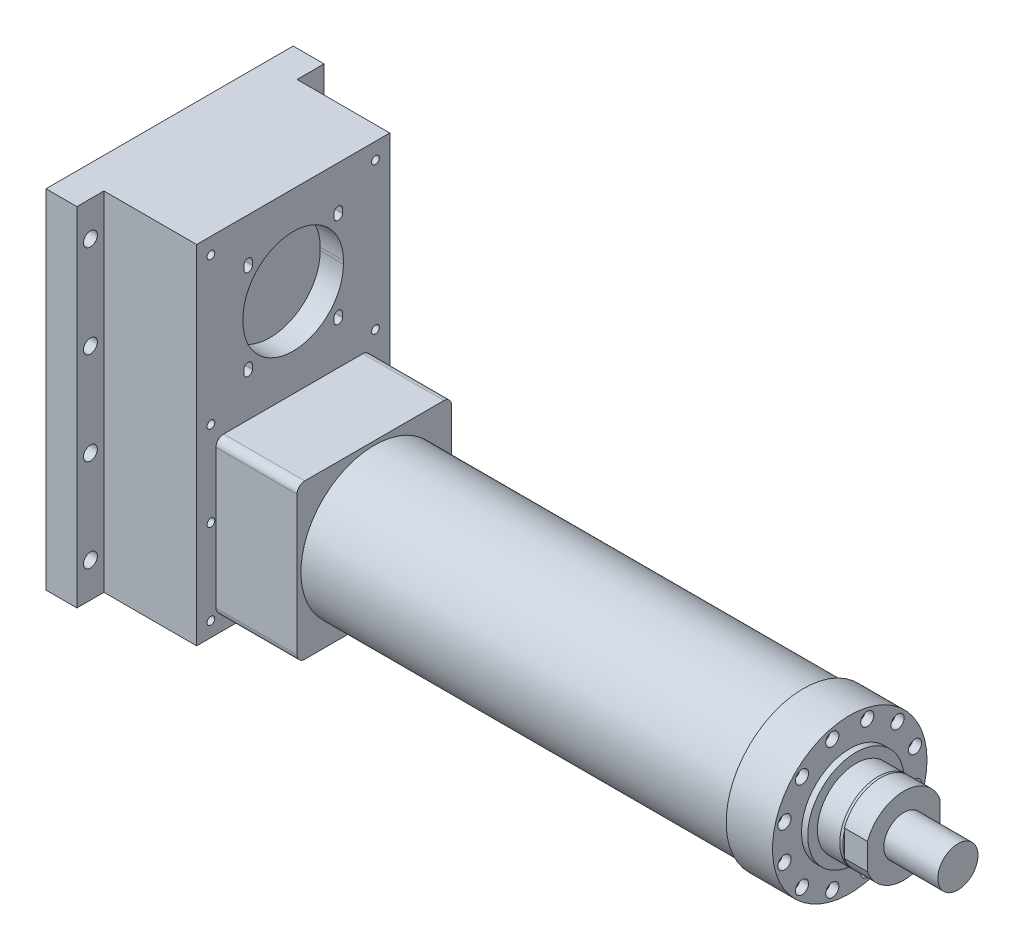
ISO-10303-21;
HEADER;
FILE_DESCRIPTION(('STEP AP214'),'2;1');
FILE_NAME('part.step','',(''),(''),'','','');
FILE_SCHEMA(('AUTOMOTIVE_DESIGN { 1 0 10303 214 1 1 1 1 }'));
ENDSEC;
DATA;
#1=APPLICATION_CONTEXT('core data for automotive mechanical design processes');
#2=APPLICATION_PROTOCOL_DEFINITION('international standard','automotive_design',2000,#1);
#3=PRODUCT_CONTEXT('',#1,'mechanical');
#4=PRODUCT('Part','Part','',(#3));
#5=PRODUCT_RELATED_PRODUCT_CATEGORY('part','',(#4));
#6=PRODUCT_DEFINITION_FORMATION('','',#4);
#7=PRODUCT_DEFINITION_CONTEXT('part definition',#1,'design');
#8=PRODUCT_DEFINITION('design','',#6,#7);
#9=PRODUCT_DEFINITION_SHAPE('','',#8);
#10=(LENGTH_UNIT() NAMED_UNIT(*) SI_UNIT(.MILLI.,.METRE.));
#11=(NAMED_UNIT(*) PLANE_ANGLE_UNIT() SI_UNIT($,.RADIAN.));
#12=(NAMED_UNIT(*) SI_UNIT($,.STERADIAN.) SOLID_ANGLE_UNIT());
#13=UNCERTAINTY_MEASURE_WITH_UNIT(LENGTH_MEASURE(1.E-05),#10,'distance_accuracy_value','');
#14=(GEOMETRIC_REPRESENTATION_CONTEXT(3) GLOBAL_UNCERTAINTY_ASSIGNED_CONTEXT((#13)) GLOBAL_UNIT_ASSIGNED_CONTEXT((#10,
#11,#12)) REPRESENTATION_CONTEXT('',''));
#15=CARTESIAN_POINT('',(0.,0.,0.));
#16=DIRECTION('',(0.,0.,1.));
#17=DIRECTION('',(1.,0.,0.));
#18=AXIS2_PLACEMENT_3D('',#15,#16,#17);
#19=CARTESIAN_POINT('',(755.5,0.,0.));
#20=DIRECTION('',(-1.,0.,0.));
#21=DIRECTION('',(0.,0.,1.));
#22=AXIS2_PLACEMENT_3D('',#19,#20,#21);
#23=CYLINDRICAL_SURFACE('',#22,26.);
#24=CARTESIAN_POINT('',(755.5,0.,0.));
#25=DIRECTION('',(1.,0.,0.));
#26=DIRECTION('',(0.,0.,-1.));
#27=AXIS2_PLACEMENT_3D('',#24,#25,#26);
#28=CIRCLE('',#27,26.);
#29=CARTESIAN_POINT('',(755.5,0.,-26.));
#30=VERTEX_POINT('',#29);
#31=EDGE_CURVE('E12',#30,#30,#28,.T.);
#32=ORIENTED_EDGE('',*,*,#31,.F.);
#33=EDGE_LOOP('',(#32));
#34=FACE_BOUND('',#33,.T.);
#35=CARTESIAN_POINT('',(685.5,0.,0.));
#36=DIRECTION('',(1.,0.,0.));
#37=DIRECTION('',(0.,0.,-1.));
#38=AXIS2_PLACEMENT_3D('',#35,#36,#37);
#39=CIRCLE('',#38,26.);
#40=CARTESIAN_POINT('',(685.5,0.,-26.));
#41=VERTEX_POINT('',#40);
#42=EDGE_CURVE('E144',#41,#41,#39,.T.);
#43=ORIENTED_EDGE('',*,*,#42,.T.);
#44=EDGE_LOOP('',(#43));
#45=FACE_BOUND('',#44,.T.);
#46=ADVANCED_FACE('F141',(#34,#45),#23,.T.);
#47=CARTESIAN_POINT('',(755.5,0.,0.));
#48=DIRECTION('',(1.,0.,0.));
#49=DIRECTION('',(0.,0.,-1.));
#50=AXIS2_PLACEMENT_3D('',#47,#48,#49);
#51=PLANE('',#50);
#52=ORIENTED_EDGE('',*,*,#31,.T.);
#53=EDGE_LOOP('',(#52));
#54=FACE_BOUND('',#53,.T.);
#55=ADVANCED_FACE('F156',(#54),#51,.T.);
#56=CARTESIAN_POINT('',(685.5,0.,0.));
#57=DIRECTION('',(1.,0.,0.));
#58=DIRECTION('',(0.,0.,-1.));
#59=AXIS2_PLACEMENT_3D('',#56,#57,#58);
#60=PLANE('',#59);
#61=ORIENTED_EDGE('',*,*,#42,.F.);
#62=EDGE_LOOP('',(#61));
#63=FACE_BOUND('',#62,.T.);
#64=ADVANCED_FACE('F154',(#63),#60,.F.);
#65=CLOSED_SHELL('',(#46,#55,#64));
#66=MANIFOLD_SOLID_BREP('B2',#65);
#67=CARTESIAN_POINT('',(-105.,0.,0.));
#68=DIRECTION('',(-1.,0.,0.));
#69=DIRECTION('',(0.,0.,1.));
#70=AXIS2_PLACEMENT_3D('',#67,#68,#69);
#71=PLANE('',#70);
#72=CARTESIAN_POINT('',(-105.,275.836309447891,-58.3363094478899));
#73=DIRECTION('',(-1.,0.,0.));
#74=DIRECTION('',(0.,0.,1.));
#75=AXIS2_PLACEMENT_3D('',#72,#73,#74);
#76=CIRCLE('',#75,5.49999999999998);
#77=CARTESIAN_POINT('',(-105.,275.836309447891,-52.8363094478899));
#78=VERTEX_POINT('',#77);
#79=CARTESIAN_POINT('',(-105.,275.836309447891,-63.8363094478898));
#80=VERTEX_POINT('',#79);
#81=EDGE_CURVE('E641',#78,#80,#76,.T.);
#82=ORIENTED_EDGE('',*,*,#81,.T.);
#83=DIRECTION('',(0.,1.,0.));
#84=VECTOR('',#83,1.);
#85=CARTESIAN_POINT('',(-105.,270.83630944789,-63.8363094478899));
#86=LINE('',#85,#84);
#87=CARTESIAN_POINT('',(-105.,270.83630944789,-63.8363094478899));
#88=VERTEX_POINT('',#87);
#89=EDGE_CURVE('E203',#88,#80,#86,.T.);
#90=ORIENTED_EDGE('',*,*,#89,.F.);
#91=CARTESIAN_POINT('',(-105.,270.83630944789,-58.3363094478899));
#92=DIRECTION('',(-1.,0.,0.));
#93=DIRECTION('',(0.,0.,1.));
#94=AXIS2_PLACEMENT_3D('',#91,#92,#93);
#95=CIRCLE('',#94,5.5);
#96=CARTESIAN_POINT('',(-105.,270.83630944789,-52.8363094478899));
#97=VERTEX_POINT('',#96);
#98=EDGE_CURVE('E634',#88,#97,#95,.T.);
#99=ORIENTED_EDGE('',*,*,#98,.T.);
#100=DIRECTION('',(0.,1.,0.));
#101=VECTOR('',#100,1.);
#102=CARTESIAN_POINT('',(-105.,270.83630944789,-52.8363094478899));
#103=LINE('',#102,#101);
#104=EDGE_CURVE('E637',#97,#78,#103,.T.);
#105=ORIENTED_EDGE('',*,*,#104,.T.);
#106=EDGE_LOOP('',(#82,#90,#99,#105));
#107=FACE_BOUND('',#106,.T.);
#108=CARTESIAN_POINT('',(-105.,154.16369055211,-58.3363094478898));
#109=DIRECTION('',(1.,0.,0.));
#110=DIRECTION('',(0.,0.,-1.));
#111=AXIS2_PLACEMENT_3D('',#108,#109,#110);
#112=CIRCLE('',#111,5.49999999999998);
#113=CARTESIAN_POINT('',(-105.,154.16369055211,-52.8363094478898));
#114=VERTEX_POINT('',#113);
#115=CARTESIAN_POINT('',(-105.,154.16369055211,-63.8363094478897));
#116=VERTEX_POINT('',#115);
#117=EDGE_CURVE('E612',#114,#116,#112,.T.);
#118=ORIENTED_EDGE('',*,*,#117,.F.);
#119=DIRECTION('',(0.,-1.,0.));
#120=VECTOR('',#119,1.);
#121=CARTESIAN_POINT('',(-105.,159.16369055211,-52.8363094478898));
#122=LINE('',#121,#120);
#123=CARTESIAN_POINT('',(-105.,159.16369055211,-52.8363094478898));
#124=VERTEX_POINT('',#123);
#125=EDGE_CURVE('E211',#124,#114,#122,.T.);
#126=ORIENTED_EDGE('',*,*,#125,.F.);
#127=CARTESIAN_POINT('',(-105.,159.16369055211,-58.3363094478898));
#128=DIRECTION('',(1.,0.,0.));
#129=DIRECTION('',(0.,0.,-1.));
#130=AXIS2_PLACEMENT_3D('',#127,#128,#129);
#131=CIRCLE('',#130,5.5);
#132=CARTESIAN_POINT('',(-105.,159.16369055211,-63.8363094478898));
#133=VERTEX_POINT('',#132);
#134=EDGE_CURVE('E605',#133,#124,#131,.T.);
#135=ORIENTED_EDGE('',*,*,#134,.F.);
#136=DIRECTION('',(0.,-1.,0.));
#137=VECTOR('',#136,1.);
#138=CARTESIAN_POINT('',(-105.,159.16369055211,-63.8363094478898));
#139=LINE('',#138,#137);
#140=EDGE_CURVE('E608',#133,#116,#139,.T.);
#141=ORIENTED_EDGE('',*,*,#140,.T.);
#142=EDGE_LOOP('',(#118,#126,#135,#141));
#143=FACE_BOUND('',#142,.T.);
#144=DIRECTION('',(0.,1.,0.));
#145=VECTOR('',#144,1.);
#146=CARTESIAN_POINT('',(-105.,270.83630944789,63.8363094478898));
#147=LINE('',#146,#145);
#148=CARTESIAN_POINT('',(-105.,270.83630944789,63.8363094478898));
#149=VERTEX_POINT('',#148);
#150=CARTESIAN_POINT('',(-105.,275.836309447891,63.8363094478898));
#151=VERTEX_POINT('',#150);
#152=EDGE_CURVE('E552',#149,#151,#147,.T.);
#153=ORIENTED_EDGE('',*,*,#152,.T.);
#154=CARTESIAN_POINT('',(-105.,275.836309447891,58.3363094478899));
#155=DIRECTION('',(1.,0.,0.));
#156=DIRECTION('',(0.,0.,-1.));
#157=AXIS2_PLACEMENT_3D('',#154,#155,#156);
#158=CIRCLE('',#157,5.49999999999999);
#159=CARTESIAN_POINT('',(-105.,275.836309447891,52.8363094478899));
#160=VERTEX_POINT('',#159);
#161=EDGE_CURVE('E549',#160,#151,#158,.T.);
#162=ORIENTED_EDGE('',*,*,#161,.F.);
#163=DIRECTION('',(0.,1.,0.));
#164=VECTOR('',#163,1.);
#165=CARTESIAN_POINT('',(-105.,270.83630944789,52.8363094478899));
#166=LINE('',#165,#164);
#167=CARTESIAN_POINT('',(-105.,270.83630944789,52.8363094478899));
#168=VERTEX_POINT('',#167);
#169=EDGE_CURVE('E545',#168,#160,#166,.T.);
#170=ORIENTED_EDGE('',*,*,#169,.F.);
#171=CARTESIAN_POINT('',(-105.,270.83630944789,58.3363094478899));
#172=DIRECTION('',(1.,0.,0.));
#173=DIRECTION('',(0.,0.,-1.));
#174=AXIS2_PLACEMENT_3D('',#171,#172,#173);
#175=CIRCLE('',#174,5.49999999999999);
#176=EDGE_CURVE('E542',#149,#168,#175,.T.);
#177=ORIENTED_EDGE('',*,*,#176,.F.);
#178=EDGE_LOOP('',(#153,#162,#170,#177));
#179=FACE_BOUND('',#178,.T.);
#180=DIRECTION('',(0.,0.,1.));
#181=VECTOR('',#180,1.);
#182=CARTESIAN_POINT('',(-105.,-100.,-90.));
#183=LINE('',#182,#181);
#184=CARTESIAN_POINT('',(-105.,-100.,-90.));
#185=VERTEX_POINT('',#184);
#186=CARTESIAN_POINT('',(-105.,-100.,89.9999999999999));
#187=VERTEX_POINT('',#186);
#188=EDGE_CURVE('E757',#185,#187,#183,.T.);
#189=ORIENTED_EDGE('',*,*,#188,.T.);
#190=CARTESIAN_POINT('',(-105.,-90.,90.));
#191=DIRECTION('',(-1.,0.,0.));
#192=DIRECTION('',(0.,0.,-1.));
#193=AXIS2_PLACEMENT_3D('',#190,#191,#192);
#194=CIRCLE('',#193,9.99999999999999);
#195=CARTESIAN_POINT('',(-105.,-90.,100.));
#196=VERTEX_POINT('',#195);
#197=EDGE_CURVE('E735',#187,#196,#194,.T.);
#198=ORIENTED_EDGE('',*,*,#197,.T.);
#199=DIRECTION('',(0.,1.,0.));
#200=VECTOR('',#199,1.);
#201=CARTESIAN_POINT('',(-105.,89.9999999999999,99.9999999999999));
#202=LINE('',#201,#200);
#203=CARTESIAN_POINT('',(-105.,89.9999999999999,99.9999999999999));
#204=VERTEX_POINT('',#203);
#205=EDGE_CURVE('E738',#196,#204,#202,.T.);
#206=ORIENTED_EDGE('',*,*,#205,.T.);
#207=CARTESIAN_POINT('',(-105.,90.,90.));
#208=DIRECTION('',(-1.,0.,0.));
#209=DIRECTION('',(0.,0.,1.));
#210=AXIS2_PLACEMENT_3D('',#207,#208,#209);
#211=CIRCLE('',#210,9.99999999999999);
#212=CARTESIAN_POINT('',(-105.,100.,89.9999999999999));
#213=VERTEX_POINT('',#212);
#214=EDGE_CURVE('E742',#204,#213,#211,.T.);
#215=ORIENTED_EDGE('',*,*,#214,.T.);
#216=DIRECTION('',(0.,0.,-1.));
#217=VECTOR('',#216,1.);
#218=CARTESIAN_POINT('',(-105.,100.,-90.));
#219=LINE('',#218,#217);
#220=CARTESIAN_POINT('',(-105.,100.,-90.));
#221=VERTEX_POINT('',#220);
#222=EDGE_CURVE('E745',#213,#221,#219,.T.);
#223=ORIENTED_EDGE('',*,*,#222,.T.);
#224=CARTESIAN_POINT('',(-105.,90.,-90.0000000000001));
#225=DIRECTION('',(-1.,0.,0.));
#226=DIRECTION('',(0.,0.,-1.));
#227=AXIS2_PLACEMENT_3D('',#224,#225,#226);
#228=CIRCLE('',#227,9.99999999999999);
#229=CARTESIAN_POINT('',(-105.,89.9999999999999,-100.));
#230=VERTEX_POINT('',#229);
#231=EDGE_CURVE('E748',#221,#230,#228,.T.);
#232=ORIENTED_EDGE('',*,*,#231,.T.);
#233=DIRECTION('',(0.,-1.,0.));
#234=VECTOR('',#233,1.);
#235=CARTESIAN_POINT('',(-105.,89.9999999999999,-100.));
#236=LINE('',#235,#234);
#237=CARTESIAN_POINT('',(-105.,-90.,-100.));
#238=VERTEX_POINT('',#237);
#239=EDGE_CURVE('E751',#230,#238,#236,.T.);
#240=ORIENTED_EDGE('',*,*,#239,.T.);
#241=CARTESIAN_POINT('',(-105.,-90.,-90.0000000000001));
#242=DIRECTION('',(-1.,0.,0.));
#243=DIRECTION('',(0.,0.,-1.));
#244=AXIS2_PLACEMENT_3D('',#241,#242,#243);
#245=CIRCLE('',#244,9.99999999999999);
#246=EDGE_CURVE('E754',#238,#185,#245,.T.);
#247=ORIENTED_EDGE('',*,*,#246,.T.);
#248=EDGE_LOOP('',(#189,#198,#206,#215,#223,#232,#240,#247));
#249=FACE_BOUND('',#248,.T.);
#250=DIRECTION('',(0.,1.,0.));
#251=VECTOR('',#250,1.);
#252=CARTESIAN_POINT('',(-105.,330.,125.));
#253=LINE('',#252,#251);
#254=CARTESIAN_POINT('',(-105.,-120.,125.));
#255=VERTEX_POINT('',#254);
#256=CARTESIAN_POINT('',(-105.,330.,125.));
#257=VERTEX_POINT('',#256);
#258=EDGE_CURVE('E707',#255,#257,#253,.T.);
#259=ORIENTED_EDGE('',*,*,#258,.F.);
#260=DIRECTION('',(0.,0.,1.));
#261=VECTOR('',#260,1.);
#262=CARTESIAN_POINT('',(-105.,-120.,-125.));
#263=LINE('',#262,#261);
#264=CARTESIAN_POINT('',(-105.,-120.,-125.));
#265=VERTEX_POINT('',#264);
#266=EDGE_CURVE('E712',#265,#255,#263,.T.);
#267=ORIENTED_EDGE('',*,*,#266,.F.);
#268=DIRECTION('',(0.,-1.,0.));
#269=VECTOR('',#268,1.);
#270=CARTESIAN_POINT('',(-105.,330.,-125.));
#271=LINE('',#270,#269);
#272=CARTESIAN_POINT('',(-105.,330.,-125.));
#273=VERTEX_POINT('',#272);
#274=EDGE_CURVE('E720',#273,#265,#271,.T.);
#275=ORIENTED_EDGE('',*,*,#274,.F.);
#276=DIRECTION('',(0.,0.,-1.));
#277=VECTOR('',#276,1.);
#278=CARTESIAN_POINT('',(-105.,330.,-125.));
#279=LINE('',#278,#277);
#280=EDGE_CURVE('E718',#257,#273,#279,.T.);
#281=ORIENTED_EDGE('',*,*,#280,.F.);
#282=EDGE_LOOP('',(#259,#267,#275,#281));
#283=FACE_BOUND('',#282,.T.);
#284=CARTESIAN_POINT('',(-105.,309.,106.5));
#285=DIRECTION('',(1.,0.,0.));
#286=DIRECTION('',(0.,0.,-1.));
#287=AXIS2_PLACEMENT_3D('',#284,#285,#286);
#288=CIRCLE('',#287,5.00000000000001);
#289=CARTESIAN_POINT('',(-105.,309.,101.5));
#290=VERTEX_POINT('',#289);
#291=EDGE_CURVE('E702',#290,#290,#288,.T.);
#292=ORIENTED_EDGE('',*,*,#291,.F.);
#293=EDGE_LOOP('',(#292));
#294=FACE_BOUND('',#293,.T.);
#295=CARTESIAN_POINT('',(-105.,309.,-106.5));
#296=DIRECTION('',(1.,0.,0.));
#297=DIRECTION('',(0.,0.,-1.));
#298=AXIS2_PLACEMENT_3D('',#295,#296,#297);
#299=CIRCLE('',#298,5.00000000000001);
#300=CARTESIAN_POINT('',(-105.,309.,-111.5));
#301=VERTEX_POINT('',#300);
#302=EDGE_CURVE('E683',#301,#301,#299,.T.);
#303=ORIENTED_EDGE('',*,*,#302,.F.);
#304=EDGE_LOOP('',(#303));
#305=FACE_BOUND('',#304,.T.);
#306=CARTESIAN_POINT('',(-105.,-101.,-106.500000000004));
#307=DIRECTION('',(1.,0.,0.));
#308=DIRECTION('',(0.,0.,-1.));
#309=AXIS2_PLACEMENT_3D('',#306,#307,#308);
#310=CIRCLE('',#309,5.00000000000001);
#311=CARTESIAN_POINT('',(-105.,-101.,-111.500000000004));
#312=VERTEX_POINT('',#311);
#313=EDGE_CURVE('E688',#312,#312,#310,.T.);
#314=ORIENTED_EDGE('',*,*,#313,.F.);
#315=EDGE_LOOP('',(#314));
#316=FACE_BOUND('',#315,.T.);
#317=CARTESIAN_POINT('',(-105.,8.99999999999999,-106.500000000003));
#318=DIRECTION('',(1.,0.,0.));
#319=DIRECTION('',(0.,0.,-1.));
#320=AXIS2_PLACEMENT_3D('',#317,#318,#319);
#321=CIRCLE('',#320,5.00000000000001);
#322=CARTESIAN_POINT('',(-105.,8.99999999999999,-111.500000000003));
#323=VERTEX_POINT('',#322);
#324=EDGE_CURVE('E684',#323,#323,#321,.T.);
#325=ORIENTED_EDGE('',*,*,#324,.F.);
#326=EDGE_LOOP('',(#325));
#327=FACE_BOUND('',#326,.T.);
#328=CARTESIAN_POINT('',(-105.,119.,106.499999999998));
#329=DIRECTION('',(1.,0.,0.));
#330=DIRECTION('',(0.,0.,-1.));
#331=AXIS2_PLACEMENT_3D('',#328,#329,#330);
#332=CIRCLE('',#331,5.00000000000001);
#333=CARTESIAN_POINT('',(-105.,119.,101.499999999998));
#334=VERTEX_POINT('',#333);
#335=EDGE_CURVE('E699',#334,#334,#332,.T.);
#336=ORIENTED_EDGE('',*,*,#335,.F.);
#337=EDGE_LOOP('',(#336));
#338=FACE_BOUND('',#337,.T.);
#339=CARTESIAN_POINT('',(-105.,8.99999999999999,106.499999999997));
#340=DIRECTION('',(1.,0.,0.));
#341=DIRECTION('',(0.,0.,-1.));
#342=AXIS2_PLACEMENT_3D('',#339,#340,#341);
#343=CIRCLE('',#342,5.00000000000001);
#344=CARTESIAN_POINT('',(-105.,8.99999999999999,101.499999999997));
#345=VERTEX_POINT('',#344);
#346=EDGE_CURVE('E696',#345,#345,#343,.T.);
#347=ORIENTED_EDGE('',*,*,#346,.F.);
#348=EDGE_LOOP('',(#347));
#349=FACE_BOUND('',#348,.T.);
#350=CARTESIAN_POINT('',(-105.,-101.,106.499999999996));
#351=DIRECTION('',(1.,0.,0.));
#352=DIRECTION('',(0.,0.,-1.));
#353=AXIS2_PLACEMENT_3D('',#350,#351,#352);
#354=CIRCLE('',#353,5.00000000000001);
#355=CARTESIAN_POINT('',(-105.,-101.,101.499999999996));
#356=VERTEX_POINT('',#355);
#357=EDGE_CURVE('E693',#356,#356,#354,.T.);
#358=ORIENTED_EDGE('',*,*,#357,.F.);
#359=EDGE_LOOP('',(#358));
#360=FACE_BOUND('',#359,.T.);
#361=CARTESIAN_POINT('',(-105.,119.,-106.500000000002));
#362=DIRECTION('',(1.,0.,0.));
#363=DIRECTION('',(0.,0.,-1.));
#364=AXIS2_PLACEMENT_3D('',#361,#362,#363);
#365=CIRCLE('',#364,5.00000000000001);
#366=CARTESIAN_POINT('',(-105.,119.,-111.500000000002));
#367=VERTEX_POINT('',#366);
#368=EDGE_CURVE('E687',#367,#367,#365,.T.);
#369=ORIENTED_EDGE('',*,*,#368,.F.);
#370=EDGE_LOOP('',(#369));
#371=FACE_BOUND('',#370,.T.);
#372=DIRECTION('',(0.,-1.,0.));
#373=VECTOR('',#372,1.);
#374=CARTESIAN_POINT('',(-105.,217.,-65.));
#375=LINE('',#374,#373);
#376=CARTESIAN_POINT('',(-105.,217.,-65.));
#377=VERTEX_POINT('',#376);
#378=CARTESIAN_POINT('',(-105.,213.,-65.));
#379=VERTEX_POINT('',#378);
#380=EDGE_CURVE('E555',#377,#379,#375,.T.);
#381=ORIENTED_EDGE('',*,*,#380,.T.);
#382=CARTESIAN_POINT('',(-105.,213.,0.));
#383=DIRECTION('',(1.,0.,0.));
#384=DIRECTION('',(0.,0.,-1.));
#385=AXIS2_PLACEMENT_3D('',#382,#383,#384);
#386=CIRCLE('',#385,65.);
#387=CARTESIAN_POINT('',(-105.,213.,65.));
#388=VERTEX_POINT('',#387);
#389=EDGE_CURVE('E667',#388,#379,#386,.T.);
#390=ORIENTED_EDGE('',*,*,#389,.F.);
#391=DIRECTION('',(0.,-1.,0.));
#392=VECTOR('',#391,1.);
#393=CARTESIAN_POINT('',(-105.,217.,65.));
#394=LINE('',#393,#392);
#395=CARTESIAN_POINT('',(-105.,217.,65.));
#396=VERTEX_POINT('',#395);
#397=EDGE_CURVE('E670',#396,#388,#394,.T.);
#398=ORIENTED_EDGE('',*,*,#397,.F.);
#399=CARTESIAN_POINT('',(-105.,217.,0.));
#400=DIRECTION('',(1.,0.,0.));
#401=DIRECTION('',(0.,0.,-1.));
#402=AXIS2_PLACEMENT_3D('',#399,#400,#401);
#403=CIRCLE('',#402,65.);
#404=EDGE_CURVE('E655',#377,#396,#403,.T.);
#405=ORIENTED_EDGE('',*,*,#404,.F.);
#406=EDGE_LOOP('',(#381,#390,#398,#405));
#407=FACE_BOUND('',#406,.T.);
#408=DIRECTION('',(0.,-1.,0.));
#409=VECTOR('',#408,1.);
#410=CARTESIAN_POINT('',(-105.,159.16369055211,52.8363094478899));
#411=LINE('',#410,#409);
#412=CARTESIAN_POINT('',(-105.,159.16369055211,52.8363094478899));
#413=VERTEX_POINT('',#412);
#414=CARTESIAN_POINT('',(-105.,154.16369055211,52.8363094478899));
#415=VERTEX_POINT('',#414);
#416=EDGE_CURVE('E534',#413,#415,#411,.T.);
#417=ORIENTED_EDGE('',*,*,#416,.T.);
#418=CARTESIAN_POINT('',(-105.,154.16369055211,58.3363094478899));
#419=DIRECTION('',(-1.,0.,0.));
#420=DIRECTION('',(0.,0.,1.));
#421=AXIS2_PLACEMENT_3D('',#418,#419,#420);
#422=CIRCLE('',#421,5.49999999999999);
#423=CARTESIAN_POINT('',(-105.,154.16369055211,63.8363094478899));
#424=VERTEX_POINT('',#423);
#425=EDGE_CURVE('E583',#415,#424,#422,.T.);
#426=ORIENTED_EDGE('',*,*,#425,.T.);
#427=DIRECTION('',(0.,-1.,0.));
#428=VECTOR('',#427,1.);
#429=CARTESIAN_POINT('',(-105.,159.16369055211,63.8363094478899));
#430=LINE('',#429,#428);
#431=CARTESIAN_POINT('',(-105.,159.16369055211,63.8363094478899));
#432=VERTEX_POINT('',#431);
#433=EDGE_CURVE('E579',#432,#424,#430,.T.);
#434=ORIENTED_EDGE('',*,*,#433,.F.);
#435=CARTESIAN_POINT('',(-105.,159.16369055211,58.3363094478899));
#436=DIRECTION('',(-1.,0.,0.));
#437=DIRECTION('',(0.,0.,1.));
#438=AXIS2_PLACEMENT_3D('',#435,#436,#437);
#439=CIRCLE('',#438,5.49999999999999);
#440=EDGE_CURVE('E576',#432,#413,#439,.T.);
#441=ORIENTED_EDGE('',*,*,#440,.T.);
#442=EDGE_LOOP('',(#417,#426,#434,#441));
#443=FACE_BOUND('',#442,.T.);
#444=ADVANCED_FACE('F183',(#107,#143,#179,#249,#283,#294,#305,#316,#327,#338,#349,#360,#371,
#407,#443),#71,.F.);
#445=CARTESIAN_POINT('',(655.5,0.,0.));
#446=DIRECTION('',(1.,0.,0.));
#447=DIRECTION('',(0.,0.,-1.));
#448=AXIS2_PLACEMENT_3D('',#445,#446,#447);
#449=PLANE('',#448);
#450=CARTESIAN_POINT('',(655.5,0.,0.));
#451=DIRECTION('',(1.,0.,0.));
#452=DIRECTION('',(0.,0.,-1.));
#453=AXIS2_PLACEMENT_3D('',#450,#451,#452);
#454=CIRCLE('',#453,48.9080892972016);
#455=CARTESIAN_POINT('',(655.5,-13.5277935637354,-47.));
#456=VERTEX_POINT('',#455);
#457=CARTESIAN_POINT('',(655.5,13.5277935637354,-47.));
#458=VERTEX_POINT('',#457);
#459=EDGE_CURVE('E840',#456,#458,#454,.T.);
#460=ORIENTED_EDGE('',*,*,#459,.T.);
#461=DIRECTION('',(0.,-1.,0.));
#462=VECTOR('',#461,1.);
#463=CARTESIAN_POINT('',(655.5,17.058722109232,-47.));
#464=LINE('',#463,#462);
#465=EDGE_CURVE('E139',#458,#456,#464,.T.);
#466=ORIENTED_EDGE('',*,*,#465,.T.);
#467=EDGE_LOOP('',(#460,#466));
#468=FACE_BOUND('',#467,.T.);
#469=ADVANCED_FACE('F1046',(#468),#449,.T.);
#470=CARTESIAN_POINT('',(555.5,0.,0.));
#471=DIRECTION('',(-1.,0.,0.));
#472=DIRECTION('',(0.,0.,1.));
#473=AXIS2_PLACEMENT_3D('',#470,#471,#472);
#474=CYLINDRICAL_SURFACE('',#473,95.);
#475=CARTESIAN_POINT('',(555.5,0.,0.));
#476=DIRECTION('',(1.,0.,0.));
#477=DIRECTION('',(0.,0.,-1.));
#478=AXIS2_PLACEMENT_3D('',#475,#476,#477);
#479=CIRCLE('',#478,95.);
#480=CARTESIAN_POINT('',(555.5,0.,-95.));
#481=VERTEX_POINT('',#480);
#482=EDGE_CURVE('E919',#481,#481,#479,.T.);
#483=ORIENTED_EDGE('',*,*,#482,.F.);
#484=EDGE_LOOP('',(#483));
#485=FACE_BOUND('',#484,.T.);
#486=CARTESIAN_POINT('',(0.,0.,0.));
#487=DIRECTION('',(1.,0.,0.));
#488=DIRECTION('',(0.,0.,-1.));
#489=AXIS2_PLACEMENT_3D('',#486,#487,#488);
#490=CIRCLE('',#489,95.);
#491=CARTESIAN_POINT('',(0.,0.,-95.));
#492=VERTEX_POINT('',#491);
#493=EDGE_CURVE('E799',#492,#492,#490,.T.);
#494=ORIENTED_EDGE('',*,*,#493,.T.);
#495=EDGE_LOOP('',(#494));
#496=FACE_BOUND('',#495,.T.);
#497=ADVANCED_FACE('F1026',(#485,#496),#474,.T.);
#498=CARTESIAN_POINT('',(615.5,0.,0.));
#499=DIRECTION('',(-1.,0.,0.));
#500=DIRECTION('',(0.,0.,1.));
#501=AXIS2_PLACEMENT_3D('',#498,#499,#500);
#502=CYLINDRICAL_SURFACE('',#501,100.);
#503=CARTESIAN_POINT('',(615.5,0.,0.));
#504=DIRECTION('',(1.,0.,0.));
#505=DIRECTION('',(0.,0.,-1.));
#506=AXIS2_PLACEMENT_3D('',#503,#504,#505);
#507=CIRCLE('',#506,100.);
#508=CARTESIAN_POINT('',(615.5,0.,-100.));
#509=VERTEX_POINT('',#508);
#510=EDGE_CURVE('E920',#509,#509,#507,.T.);
#511=ORIENTED_EDGE('',*,*,#510,.F.);
#512=EDGE_LOOP('',(#511));
#513=FACE_BOUND('',#512,.T.);
#514=CARTESIAN_POINT('',(555.5,0.,0.));
#515=DIRECTION('',(1.,0.,0.));
#516=DIRECTION('',(0.,0.,-1.));
#517=AXIS2_PLACEMENT_3D('',#514,#515,#516);
#518=CIRCLE('',#517,100.);
#519=CARTESIAN_POINT('',(555.5,0.,-100.));
#520=VERTEX_POINT('',#519);
#521=EDGE_CURVE('E916',#520,#520,#518,.T.);
#522=ORIENTED_EDGE('',*,*,#521,.T.);
#523=EDGE_LOOP('',(#522));
#524=FACE_BOUND('',#523,.T.);
#525=ADVANCED_FACE('F1017',(#513,#524),#502,.T.);
#526=CARTESIAN_POINT('',(615.5,0.,0.));
#527=DIRECTION('',(1.,0.,0.));
#528=DIRECTION('',(0.,0.,-1.));
#529=AXIS2_PLACEMENT_3D('',#526,#527,#528);
#530=PLANE('',#529);
#531=CARTESIAN_POINT('',(615.5,61.8718433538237,61.8718433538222));
#532=DIRECTION('',(1.,0.,0.));
#533=DIRECTION('',(0.,0.,-1.));
#534=AXIS2_PLACEMENT_3D('',#531,#532,#533);
#535=CIRCLE('',#534,8.50000000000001);
#536=CARTESIAN_POINT('',(615.5,61.8718433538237,53.3718433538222));
#537=VERTEX_POINT('',#536);
#538=EDGE_CURVE('E860',#537,#537,#535,.T.);
#539=ORIENTED_EDGE('',*,*,#538,.F.);
#540=EDGE_LOOP('',(#539));
#541=FACE_BOUND('',#540,.T.);
#542=CARTESIAN_POINT('',(615.5,22.6466664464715,84.5185098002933));
#543=DIRECTION('',(1.,0.,0.));
#544=DIRECTION('',(0.,0.,-1.));
#545=AXIS2_PLACEMENT_3D('',#542,#543,#544);
#546=CIRCLE('',#545,8.5);
#547=CARTESIAN_POINT('',(615.5,22.6466664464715,76.0185098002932));
#548=VERTEX_POINT('',#547);
#549=EDGE_CURVE('E867',#548,#548,#546,.T.);
#550=ORIENTED_EDGE('',*,*,#549,.F.);
#551=EDGE_LOOP('',(#550));
#552=FACE_BOUND('',#551,.T.);
#553=CARTESIAN_POINT('',(615.5,-22.6466664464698,84.5185098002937));
#554=DIRECTION('',(1.,0.,0.));
#555=DIRECTION('',(0.,0.,-1.));
#556=AXIS2_PLACEMENT_3D('',#553,#554,#555);
#557=CIRCLE('',#556,8.5);
#558=CARTESIAN_POINT('',(615.5,-22.6466664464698,76.0185098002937));
#559=VERTEX_POINT('',#558);
#560=EDGE_CURVE('E873',#559,#559,#557,.T.);
#561=ORIENTED_EDGE('',*,*,#560,.F.);
#562=EDGE_LOOP('',(#561));
#563=FACE_BOUND('',#562,.T.);
#564=CARTESIAN_POINT('',(615.5,-61.8718433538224,61.8718433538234));
#565=DIRECTION('',(1.,0.,0.));
#566=DIRECTION('',(0.,0.,-1.));
#567=AXIS2_PLACEMENT_3D('',#564,#565,#566);
#568=CIRCLE('',#567,8.5);
#569=CARTESIAN_POINT('',(615.5,-61.8718433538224,53.3718433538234));
#570=VERTEX_POINT('',#569);
#571=EDGE_CURVE('E879',#570,#570,#568,.T.);
#572=ORIENTED_EDGE('',*,*,#571,.F.);
#573=EDGE_LOOP('',(#572));
#574=FACE_BOUND('',#573,.T.);
#575=CARTESIAN_POINT('',(615.5,-84.5185098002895,22.6466664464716));
#576=DIRECTION('',(1.,0.,0.));
#577=DIRECTION('',(0.,0.,-1.));
#578=AXIS2_PLACEMENT_3D('',#575,#576,#577);
#579=CIRCLE('',#578,8.49999999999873);
#580=CARTESIAN_POINT('',(615.5,-84.5185098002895,14.1466664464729));
#581=VERTEX_POINT('',#580);
#582=EDGE_CURVE('E885',#581,#581,#579,.T.);
#583=ORIENTED_EDGE('',*,*,#582,.F.);
#584=EDGE_LOOP('',(#583));
#585=FACE_BOUND('',#584,.T.);
#586=CARTESIAN_POINT('',(615.5,-84.5185098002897,-22.6466664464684));
#587=DIRECTION('',(1.,0.,0.));
#588=DIRECTION('',(0.,0.,-1.));
#589=AXIS2_PLACEMENT_3D('',#586,#587,#588);
#590=CIRCLE('',#589,8.49999999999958);
#591=CARTESIAN_POINT('',(615.5,-84.5185098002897,-31.146666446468));
#592=VERTEX_POINT('',#591);
#593=EDGE_CURVE('E891',#592,#592,#590,.T.);
#594=ORIENTED_EDGE('',*,*,#593,.F.);
#595=EDGE_LOOP('',(#594));
#596=FACE_BOUND('',#595,.T.);
#597=CARTESIAN_POINT('',(615.5,-61.8718433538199,-61.87184335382));
#598=DIRECTION('',(1.,0.,0.));
#599=DIRECTION('',(0.,0.,-1.));
#600=AXIS2_PLACEMENT_3D('',#597,#598,#599);
#601=CIRCLE('',#600,8.50000000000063);
#602=CARTESIAN_POINT('',(615.5,-61.8718433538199,-70.3718433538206));
#603=VERTEX_POINT('',#602);
#604=EDGE_CURVE('E897',#603,#603,#601,.T.);
#605=ORIENTED_EDGE('',*,*,#604,.F.);
#606=EDGE_LOOP('',(#605));
#607=FACE_BOUND('',#606,.T.);
#608=CARTESIAN_POINT('',(615.5,-22.6466664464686,-84.5185098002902));
#609=DIRECTION('',(1.,0.,0.));
#610=DIRECTION('',(0.,0.,-1.));
#611=AXIS2_PLACEMENT_3D('',#608,#609,#610);
#612=CIRCLE('',#611,8.5000000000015);
#613=CARTESIAN_POINT('',(615.5,-22.6466664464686,-93.0185098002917));
#614=VERTEX_POINT('',#613);
#615=EDGE_CURVE('E903',#614,#614,#612,.T.);
#616=ORIENTED_EDGE('',*,*,#615,.F.);
#617=EDGE_LOOP('',(#616));
#618=FACE_BOUND('',#617,.T.);
#619=CARTESIAN_POINT('',(615.5,22.6466664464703,-84.5185098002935));
#620=DIRECTION('',(1.,0.,0.));
#621=DIRECTION('',(0.,0.,-1.));
#622=AXIS2_PLACEMENT_3D('',#619,#620,#621);
#623=CIRCLE('',#622,8.5);
#624=CARTESIAN_POINT('',(615.5,22.6466664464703,-93.0185098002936));
#625=VERTEX_POINT('',#624);
#626=EDGE_CURVE('E842',#625,#625,#623,.T.);
#627=ORIENTED_EDGE('',*,*,#626,.F.);
#628=EDGE_LOOP('',(#627));
#629=FACE_BOUND('',#628,.T.);
#630=CARTESIAN_POINT('',(615.5,61.8718433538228,-61.871843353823));
#631=DIRECTION('',(1.,0.,0.));
#632=DIRECTION('',(0.,0.,-1.));
#633=AXIS2_PLACEMENT_3D('',#630,#631,#632);
#634=CIRCLE('',#633,8.50000000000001);
#635=CARTESIAN_POINT('',(615.5,61.8718433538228,-70.371843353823));
#636=VERTEX_POINT('',#635);
#637=EDGE_CURVE('E849',#636,#636,#634,.T.);
#638=ORIENTED_EDGE('',*,*,#637,.F.);
#639=EDGE_LOOP('',(#638));
#640=FACE_BOUND('',#639,.T.);
#641=CARTESIAN_POINT('',(615.5,84.5185098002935,-22.6466664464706));
#642=DIRECTION('',(1.,0.,0.));
#643=DIRECTION('',(0.,0.,-1.));
#644=AXIS2_PLACEMENT_3D('',#641,#642,#643);
#645=CIRCLE('',#644,8.50000000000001);
#646=CARTESIAN_POINT('',(615.5,84.5185098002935,-31.1466664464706));
#647=VERTEX_POINT('',#646);
#648=EDGE_CURVE('E855',#647,#647,#645,.T.);
#649=ORIENTED_EDGE('',*,*,#648,.F.);
#650=EDGE_LOOP('',(#649));
#651=FACE_BOUND('',#650,.T.);
#652=CARTESIAN_POINT('',(615.5,84.5185098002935,22.6466664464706));
#653=DIRECTION('',(1.,0.,0.));
#654=DIRECTION('',(0.,0.,-1.));
#655=AXIS2_PLACEMENT_3D('',#652,#653,#654);
#656=CIRCLE('',#655,8.5);
#657=CARTESIAN_POINT('',(615.5,84.5185098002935,14.1466664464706));
#658=VERTEX_POINT('',#657);
#659=EDGE_CURVE('E863',#658,#658,#656,.T.);
#660=ORIENTED_EDGE('',*,*,#659,.F.);
#661=EDGE_LOOP('',(#660));
#662=FACE_BOUND('',#661,.T.);
#663=CARTESIAN_POINT('',(615.5,0.,0.));
#664=DIRECTION('',(1.,0.,0.));
#665=DIRECTION('',(0.,0.,-1.));
#666=AXIS2_PLACEMENT_3D('',#663,#664,#665);
#667=CIRCLE('',#666,62.5);
#668=CARTESIAN_POINT('',(615.5,0.,-62.5));
#669=VERTEX_POINT('',#668);
#670=EDGE_CURVE('E841',#669,#669,#667,.T.);
#671=ORIENTED_EDGE('',*,*,#670,.F.);
#672=EDGE_LOOP('',(#671));
#673=FACE_BOUND('',#672,.T.);
#674=ORIENTED_EDGE('',*,*,#510,.T.);
#675=EDGE_LOOP('',(#674));
#676=FACE_BOUND('',#675,.T.);
#677=ADVANCED_FACE('F1013',(#541,#552,#563,#574,#585,#596,#607,#618,#629,#640,#651,#662,#673,
#676),#530,.T.);
#678=CARTESIAN_POINT('',(555.5,0.,0.));
#679=DIRECTION('',(1.,0.,0.));
#680=DIRECTION('',(0.,0.,-1.));
#681=AXIS2_PLACEMENT_3D('',#678,#679,#680);
#682=PLANE('',#681);
#683=ORIENTED_EDGE('',*,*,#482,.T.);
#684=EDGE_LOOP('',(#683));
#685=FACE_BOUND('',#684,.T.);
#686=ORIENTED_EDGE('',*,*,#521,.F.);
#687=EDGE_LOOP('',(#686));
#688=FACE_BOUND('',#687,.T.);
#689=ADVANCED_FACE('F1016',(#685,#688),#682,.F.);
#690=CARTESIAN_POINT('',(623.5,0.,0.));
#691=DIRECTION('',(-1.,0.,0.));
#692=DIRECTION('',(0.,0.,1.));
#693=AXIS2_PLACEMENT_3D('',#690,#691,#692);
#694=CYLINDRICAL_SURFACE('',#693,62.5);
#695=CARTESIAN_POINT('',(623.5,0.,0.));
#696=DIRECTION('',(1.,0.,0.));
#697=DIRECTION('',(0.,0.,-1.));
#698=AXIS2_PLACEMENT_3D('',#695,#696,#697);
#699=CIRCLE('',#698,62.5);
#700=CARTESIAN_POINT('',(623.5,0.,-62.5));
#701=VERTEX_POINT('',#700);
#702=EDGE_CURVE('E911',#701,#701,#699,.T.);
#703=ORIENTED_EDGE('',*,*,#702,.F.);
#704=EDGE_LOOP('',(#703));
#705=FACE_BOUND('',#704,.T.);
#706=ORIENTED_EDGE('',*,*,#670,.T.);
#707=EDGE_LOOP('',(#706));
#708=FACE_BOUND('',#707,.T.);
#709=ADVANCED_FACE('F1031',(#705,#708),#694,.T.);
#710=CARTESIAN_POINT('',(623.5,0.,0.));
#711=DIRECTION('',(1.,0.,0.));
#712=DIRECTION('',(0.,0.,-1.));
#713=AXIS2_PLACEMENT_3D('',#710,#711,#712);
#714=PLANE('',#713);
#715=CARTESIAN_POINT('',(623.5,0.,0.));
#716=DIRECTION('',(1.,0.,0.));
#717=DIRECTION('',(0.,0.,-1.));
#718=AXIS2_PLACEMENT_3D('',#715,#716,#717);
#719=CIRCLE('',#718,50.);
#720=CARTESIAN_POINT('',(623.5,0.,-50.));
#721=VERTEX_POINT('',#720);
#722=EDGE_CURVE('E837',#721,#721,#719,.T.);
#723=ORIENTED_EDGE('',*,*,#722,.F.);
#724=EDGE_LOOP('',(#723));
#725=FACE_BOUND('',#724,.T.);
#726=ORIENTED_EDGE('',*,*,#702,.T.);
#727=EDGE_LOOP('',(#726));
#728=FACE_BOUND('',#727,.T.);
#729=ADVANCED_FACE('F1009',(#725,#728),#714,.T.);
#730=CARTESIAN_POINT('',(604.5,84.5185098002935,22.6466664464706));
#731=DIRECTION('',(1.,0.,0.));
#732=DIRECTION('',(0.,0.,-1.));
#733=AXIS2_PLACEMENT_3D('',#730,#731,#732);
#734=CYLINDRICAL_SURFACE('',#733,8.5);
#735=CARTESIAN_POINT('',(604.5,84.5185098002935,22.6466664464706));
#736=DIRECTION('',(1.,0.,0.));
#737=DIRECTION('',(0.,0.,-1.));
#738=AXIS2_PLACEMENT_3D('',#735,#736,#737);
#739=CIRCLE('',#738,8.5);
#740=CARTESIAN_POINT('',(604.5,84.5185098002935,14.1466664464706));
#741=VERTEX_POINT('',#740);
#742=EDGE_CURVE('E908',#741,#741,#739,.T.);
#743=ORIENTED_EDGE('',*,*,#742,.F.);
#744=EDGE_LOOP('',(#743));
#745=FACE_BOUND('',#744,.T.);
#746=ORIENTED_EDGE('',*,*,#659,.T.);
#747=EDGE_LOOP('',(#746));
#748=FACE_BOUND('',#747,.T.);
#749=ADVANCED_FACE('F1003',(#745,#748),#734,.F.);
#750=CARTESIAN_POINT('',(604.5,84.5185098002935,22.6466664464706));
#751=DIRECTION('',(1.,0.,0.));
#752=DIRECTION('',(0.,0.,-1.));
#753=AXIS2_PLACEMENT_3D('',#750,#751,#752);
#754=PLANE('',#753);
#755=CARTESIAN_POINT('',(604.5,84.5185098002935,22.6466664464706));
#756=DIRECTION('',(1.,0.,0.));
#757=DIRECTION('',(0.,0.,-1.));
#758=AXIS2_PLACEMENT_3D('',#755,#756,#757);
#759=CIRCLE('',#758,5.5);
#760=CARTESIAN_POINT('',(604.5,84.5185098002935,17.1466664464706));
#761=VERTEX_POINT('',#760);
#762=EDGE_CURVE('E187',#761,#761,#759,.T.);
#763=ORIENTED_EDGE('',*,*,#762,.F.);
#764=EDGE_LOOP('',(#763));
#765=FACE_BOUND('',#764,.T.);
#766=ORIENTED_EDGE('',*,*,#742,.T.);
#767=EDGE_LOOP('',(#766));
#768=FACE_BOUND('',#767,.T.);
#769=ADVANCED_FACE('F999',(#765,#768),#754,.T.);
#770=CARTESIAN_POINT('',(604.5,84.5185098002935,-22.6466664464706));
#771=DIRECTION('',(1.,0.,0.));
#772=DIRECTION('',(0.,0.,-1.));
#773=AXIS2_PLACEMENT_3D('',#770,#771,#772);
#774=CYLINDRICAL_SURFACE('',#773,8.50000000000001);
#775=CARTESIAN_POINT('',(604.5,84.5185098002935,-22.6466664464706));
#776=DIRECTION('',(1.,0.,0.));
#777=DIRECTION('',(0.,0.,-1.));
#778=AXIS2_PLACEMENT_3D('',#775,#776,#777);
#779=CIRCLE('',#778,8.50000000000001);
#780=CARTESIAN_POINT('',(604.5,84.5185098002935,-31.1466664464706));
#781=VERTEX_POINT('',#780);
#782=EDGE_CURVE('E828',#781,#781,#779,.T.);
#783=ORIENTED_EDGE('',*,*,#782,.F.);
#784=EDGE_LOOP('',(#783));
#785=FACE_BOUND('',#784,.T.);
#786=ORIENTED_EDGE('',*,*,#648,.T.);
#787=EDGE_LOOP('',(#786));
#788=FACE_BOUND('',#787,.T.);
#789=ADVANCED_FACE('F1002',(#785,#788),#774,.F.);
#790=CARTESIAN_POINT('',(604.5,84.5185098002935,-22.6466664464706));
#791=DIRECTION('',(1.,0.,0.));
#792=DIRECTION('',(0.,0.,-1.));
#793=AXIS2_PLACEMENT_3D('',#790,#791,#792);
#794=PLANE('',#793);
#795=CARTESIAN_POINT('',(604.5,84.5185098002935,-22.6466664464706));
#796=DIRECTION('',(1.,0.,0.));
#797=DIRECTION('',(0.,0.,-1.));
#798=AXIS2_PLACEMENT_3D('',#795,#796,#797);
#799=CIRCLE('',#798,5.49999999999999);
#800=CARTESIAN_POINT('',(604.5,84.5185098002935,-28.1466664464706));
#801=VERTEX_POINT('',#800);
#802=EDGE_CURVE('E989',#801,#801,#799,.T.);
#803=ORIENTED_EDGE('',*,*,#802,.F.);
#804=EDGE_LOOP('',(#803));
#805=FACE_BOUND('',#804,.T.);
#806=ORIENTED_EDGE('',*,*,#782,.T.);
#807=EDGE_LOOP('',(#806));
#808=FACE_BOUND('',#807,.T.);
#809=ADVANCED_FACE('F1163',(#805,#808),#794,.T.);
#810=CARTESIAN_POINT('',(604.5,61.8718433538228,-61.871843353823));
#811=DIRECTION('',(1.,0.,0.));
#812=DIRECTION('',(0.,0.,-1.));
#813=AXIS2_PLACEMENT_3D('',#810,#811,#812);
#814=CYLINDRICAL_SURFACE('',#813,8.50000000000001);
#815=CARTESIAN_POINT('',(604.5,61.8718433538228,-61.871843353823));
#816=DIRECTION('',(1.,0.,0.));
#817=DIRECTION('',(0.,0.,-1.));
#818=AXIS2_PLACEMENT_3D('',#815,#816,#817);
#819=CIRCLE('',#818,8.50000000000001);
#820=CARTESIAN_POINT('',(604.5,61.8718433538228,-70.371843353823));
#821=VERTEX_POINT('',#820);
#822=EDGE_CURVE('E852',#821,#821,#819,.T.);
#823=ORIENTED_EDGE('',*,*,#822,.F.);
#824=EDGE_LOOP('',(#823));
#825=FACE_BOUND('',#824,.T.);
#826=ORIENTED_EDGE('',*,*,#637,.T.);
#827=EDGE_LOOP('',(#826));
#828=FACE_BOUND('',#827,.T.);
#829=ADVANCED_FACE('F1160',(#825,#828),#814,.F.);
#830=CARTESIAN_POINT('',(604.5,61.8718433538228,-61.871843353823));
#831=DIRECTION('',(1.,0.,0.));
#832=DIRECTION('',(0.,0.,-1.));
#833=AXIS2_PLACEMENT_3D('',#830,#831,#832);
#834=PLANE('',#833);
#835=CARTESIAN_POINT('',(604.5,61.8718433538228,-61.871843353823));
#836=DIRECTION('',(1.,0.,0.));
#837=DIRECTION('',(0.,0.,-1.));
#838=AXIS2_PLACEMENT_3D('',#835,#836,#837);
#839=CIRCLE('',#838,5.50000000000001);
#840=CARTESIAN_POINT('',(604.5,61.8718433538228,-67.371843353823));
#841=VERTEX_POINT('',#840);
#842=EDGE_CURVE('E987',#841,#841,#839,.T.);
#843=ORIENTED_EDGE('',*,*,#842,.F.);
#844=EDGE_LOOP('',(#843));
#845=FACE_BOUND('',#844,.T.);
#846=ORIENTED_EDGE('',*,*,#822,.T.);
#847=EDGE_LOOP('',(#846));
#848=FACE_BOUND('',#847,.T.);
#849=ADVANCED_FACE('F1154',(#845,#848),#834,.T.);
#850=CARTESIAN_POINT('',(604.5,22.6466664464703,-84.5185098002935));
#851=DIRECTION('',(1.,0.,0.));
#852=DIRECTION('',(0.,0.,-1.));
#853=AXIS2_PLACEMENT_3D('',#850,#851,#852);
#854=CYLINDRICAL_SURFACE('',#853,8.5);
#855=CARTESIAN_POINT('',(604.5,22.6466664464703,-84.5185098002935));
#856=DIRECTION('',(1.,0.,0.));
#857=DIRECTION('',(0.,0.,-1.));
#858=AXIS2_PLACEMENT_3D('',#855,#856,#857);
#859=CIRCLE('',#858,8.5);
#860=CARTESIAN_POINT('',(604.5,22.6466664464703,-93.0185098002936));
#861=VERTEX_POINT('',#860);
#862=EDGE_CURVE('E846',#861,#861,#859,.T.);
#863=ORIENTED_EDGE('',*,*,#862,.F.);
#864=EDGE_LOOP('',(#863));
#865=FACE_BOUND('',#864,.T.);
#866=ORIENTED_EDGE('',*,*,#626,.T.);
#867=EDGE_LOOP('',(#866));
#868=FACE_BOUND('',#867,.T.);
#869=ADVANCED_FACE('F1150',(#865,#868),#854,.F.);
#870=CARTESIAN_POINT('',(604.5,22.6466664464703,-84.5185098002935));
#871=DIRECTION('',(1.,0.,0.));
#872=DIRECTION('',(0.,0.,-1.));
#873=AXIS2_PLACEMENT_3D('',#870,#871,#872);
#874=PLANE('',#873);
#875=CARTESIAN_POINT('',(604.5,22.6466664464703,-84.5185098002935));
#876=DIRECTION('',(1.,0.,0.));
#877=DIRECTION('',(0.,0.,-1.));
#878=AXIS2_PLACEMENT_3D('',#875,#876,#877);
#879=CIRCLE('',#878,5.5);
#880=CARTESIAN_POINT('',(604.5,22.6466664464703,-90.0185098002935));
#881=VERTEX_POINT('',#880);
#882=EDGE_CURVE('E984',#881,#881,#879,.T.);
#883=ORIENTED_EDGE('',*,*,#882,.F.);
#884=EDGE_LOOP('',(#883));
#885=FACE_BOUND('',#884,.T.);
#886=ORIENTED_EDGE('',*,*,#862,.T.);
#887=EDGE_LOOP('',(#886));
#888=FACE_BOUND('',#887,.T.);
#889=ADVANCED_FACE('F1153',(#885,#888),#874,.T.);
#890=CARTESIAN_POINT('',(604.5,-22.6466664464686,-84.5185098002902));
#891=DIRECTION('',(1.,0.,0.));
#892=DIRECTION('',(0.,0.,-1.));
#893=AXIS2_PLACEMENT_3D('',#890,#891,#892);
#894=CYLINDRICAL_SURFACE('',#893,8.5000000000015);
#895=CARTESIAN_POINT('',(604.5,-22.6466664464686,-84.5185098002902));
#896=DIRECTION('',(1.,0.,0.));
#897=DIRECTION('',(0.,0.,-1.));
#898=AXIS2_PLACEMENT_3D('',#895,#896,#897);
#899=CIRCLE('',#898,8.5000000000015);
#900=CARTESIAN_POINT('',(604.5,-22.6466664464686,-93.0185098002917));
#901=VERTEX_POINT('',#900);
#902=EDGE_CURVE('E845',#901,#901,#899,.T.);
#903=ORIENTED_EDGE('',*,*,#902,.F.);
#904=EDGE_LOOP('',(#903));
#905=FACE_BOUND('',#904,.T.);
#906=ORIENTED_EDGE('',*,*,#615,.T.);
#907=EDGE_LOOP('',(#906));
#908=FACE_BOUND('',#907,.T.);
#909=ADVANCED_FACE('F1158',(#905,#908),#894,.F.);
#910=CARTESIAN_POINT('',(604.5,-22.6466664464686,-84.5185098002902));
#911=DIRECTION('',(1.,0.,0.));
#912=DIRECTION('',(0.,0.,-1.));
#913=AXIS2_PLACEMENT_3D('',#910,#911,#912);
#914=PLANE('',#913);
#915=CARTESIAN_POINT('',(604.5,-22.6466664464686,-84.5185098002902));
#916=DIRECTION('',(1.,0.,0.));
#917=DIRECTION('',(0.,0.,-1.));
#918=AXIS2_PLACEMENT_3D('',#915,#916,#917);
#919=CIRCLE('',#918,5.50000000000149);
#920=CARTESIAN_POINT('',(604.5,-22.6466664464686,-90.0185098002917));
#921=VERTEX_POINT('',#920);
#922=EDGE_CURVE('E981',#921,#921,#919,.T.);
#923=ORIENTED_EDGE('',*,*,#922,.F.);
#924=EDGE_LOOP('',(#923));
#925=FACE_BOUND('',#924,.T.);
#926=ORIENTED_EDGE('',*,*,#902,.T.);
#927=EDGE_LOOP('',(#926));
#928=FACE_BOUND('',#927,.T.);
#929=ADVANCED_FACE('F1225',(#925,#928),#914,.T.);
#930=CARTESIAN_POINT('',(604.5,-61.8718433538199,-61.87184335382));
#931=DIRECTION('',(1.,0.,0.));
#932=DIRECTION('',(0.,0.,-1.));
#933=AXIS2_PLACEMENT_3D('',#930,#931,#932);
#934=CYLINDRICAL_SURFACE('',#933,8.50000000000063);
#935=CARTESIAN_POINT('',(604.5,-61.8718433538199,-61.87184335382));
#936=DIRECTION('',(1.,0.,0.));
#937=DIRECTION('',(0.,0.,-1.));
#938=AXIS2_PLACEMENT_3D('',#935,#936,#937);
#939=CIRCLE('',#938,8.50000000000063);
#940=CARTESIAN_POINT('',(604.5,-61.8718433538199,-70.3718433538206));
#941=VERTEX_POINT('',#940);
#942=EDGE_CURVE('E900',#941,#941,#939,.T.);
#943=ORIENTED_EDGE('',*,*,#942,.F.);
#944=EDGE_LOOP('',(#943));
#945=FACE_BOUND('',#944,.T.);
#946=ORIENTED_EDGE('',*,*,#604,.T.);
#947=EDGE_LOOP('',(#946));
#948=FACE_BOUND('',#947,.T.);
#949=ADVANCED_FACE('F1222',(#945,#948),#934,.F.);
#950=CARTESIAN_POINT('',(604.5,-61.8718433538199,-61.87184335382));
#951=DIRECTION('',(1.,0.,0.));
#952=DIRECTION('',(0.,0.,-1.));
#953=AXIS2_PLACEMENT_3D('',#950,#951,#952);
#954=PLANE('',#953);
#955=CARTESIAN_POINT('',(604.5,-61.8718433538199,-61.87184335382));
#956=DIRECTION('',(1.,0.,0.));
#957=DIRECTION('',(0.,0.,-1.));
#958=AXIS2_PLACEMENT_3D('',#955,#956,#957);
#959=CIRCLE('',#958,5.50000000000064);
#960=CARTESIAN_POINT('',(604.5,-61.8718433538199,-67.3718433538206));
#961=VERTEX_POINT('',#960);
#962=EDGE_CURVE('E978',#961,#961,#959,.T.);
#963=ORIENTED_EDGE('',*,*,#962,.F.);
#964=EDGE_LOOP('',(#963));
#965=FACE_BOUND('',#964,.T.);
#966=ORIENTED_EDGE('',*,*,#942,.T.);
#967=EDGE_LOOP('',(#966));
#968=FACE_BOUND('',#967,.T.);
#969=ADVANCED_FACE('F1217',(#965,#968),#954,.T.);
#970=CARTESIAN_POINT('',(604.5,-84.5185098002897,-22.6466664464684));
#971=DIRECTION('',(1.,0.,0.));
#972=DIRECTION('',(0.,0.,-1.));
#973=AXIS2_PLACEMENT_3D('',#970,#971,#972);
#974=CYLINDRICAL_SURFACE('',#973,8.49999999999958);
#975=CARTESIAN_POINT('',(604.5,-84.5185098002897,-22.6466664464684));
#976=DIRECTION('',(1.,0.,0.));
#977=DIRECTION('',(0.,0.,-1.));
#978=AXIS2_PLACEMENT_3D('',#975,#976,#977);
#979=CIRCLE('',#978,8.49999999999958);
#980=CARTESIAN_POINT('',(604.5,-84.5185098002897,-31.146666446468));
#981=VERTEX_POINT('',#980);
#982=EDGE_CURVE('E894',#981,#981,#979,.T.);
#983=ORIENTED_EDGE('',*,*,#982,.F.);
#984=EDGE_LOOP('',(#983));
#985=FACE_BOUND('',#984,.T.);
#986=ORIENTED_EDGE('',*,*,#593,.T.);
#987=EDGE_LOOP('',(#986));
#988=FACE_BOUND('',#987,.T.);
#989=ADVANCED_FACE('F1214',(#985,#988),#974,.F.);
#990=CARTESIAN_POINT('',(604.5,-84.5185098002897,-22.6466664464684));
#991=DIRECTION('',(1.,0.,0.));
#992=DIRECTION('',(0.,0.,-1.));
#993=AXIS2_PLACEMENT_3D('',#990,#991,#992);
#994=PLANE('',#993);
#995=CARTESIAN_POINT('',(604.5,-84.5185098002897,-22.6466664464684));
#996=DIRECTION('',(1.,0.,0.));
#997=DIRECTION('',(0.,0.,-1.));
#998=AXIS2_PLACEMENT_3D('',#995,#996,#997);
#999=CIRCLE('',#998,5.49999999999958);
#1000=CARTESIAN_POINT('',(604.5,-84.5185098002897,-28.146666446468));
#1001=VERTEX_POINT('',#1000);
#1002=EDGE_CURVE('E975',#1001,#1001,#999,.T.);
#1003=ORIENTED_EDGE('',*,*,#1002,.F.);
#1004=EDGE_LOOP('',(#1003));
#1005=FACE_BOUND('',#1004,.T.);
#1006=ORIENTED_EDGE('',*,*,#982,.T.);
#1007=EDGE_LOOP('',(#1006));
#1008=FACE_BOUND('',#1007,.T.);
#1009=ADVANCED_FACE('F1209',(#1005,#1008),#994,.T.);
#1010=CARTESIAN_POINT('',(604.5,-84.5185098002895,22.6466664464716));
#1011=DIRECTION('',(1.,0.,0.));
#1012=DIRECTION('',(0.,0.,-1.));
#1013=AXIS2_PLACEMENT_3D('',#1010,#1011,#1012);
#1014=CYLINDRICAL_SURFACE('',#1013,8.49999999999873);
#1015=CARTESIAN_POINT('',(604.5,-84.5185098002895,22.6466664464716));
#1016=DIRECTION('',(1.,0.,0.));
#1017=DIRECTION('',(0.,0.,-1.));
#1018=AXIS2_PLACEMENT_3D('',#1015,#1016,#1017);
#1019=CIRCLE('',#1018,8.49999999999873);
#1020=CARTESIAN_POINT('',(604.5,-84.5185098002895,14.1466664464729));
#1021=VERTEX_POINT('',#1020);
#1022=EDGE_CURVE('E888',#1021,#1021,#1019,.T.);
#1023=ORIENTED_EDGE('',*,*,#1022,.F.);
#1024=EDGE_LOOP('',(#1023));
#1025=FACE_BOUND('',#1024,.T.);
#1026=ORIENTED_EDGE('',*,*,#582,.T.);
#1027=EDGE_LOOP('',(#1026));
#1028=FACE_BOUND('',#1027,.T.);
#1029=ADVANCED_FACE('F1206',(#1025,#1028),#1014,.F.);
#1030=CARTESIAN_POINT('',(604.5,-84.5185098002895,22.6466664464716));
#1031=DIRECTION('',(1.,0.,0.));
#1032=DIRECTION('',(0.,0.,-1.));
#1033=AXIS2_PLACEMENT_3D('',#1030,#1031,#1032);
#1034=PLANE('',#1033);
#1035=CARTESIAN_POINT('',(604.5,-84.5185098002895,22.6466664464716));
#1036=DIRECTION('',(1.,0.,0.));
#1037=DIRECTION('',(0.,0.,-1.));
#1038=AXIS2_PLACEMENT_3D('',#1035,#1036,#1037);
#1039=CIRCLE('',#1038,5.49999999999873);
#1040=CARTESIAN_POINT('',(604.5,-84.5185098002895,17.1466664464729));
#1041=VERTEX_POINT('',#1040);
#1042=EDGE_CURVE('E972',#1041,#1041,#1039,.T.);
#1043=ORIENTED_EDGE('',*,*,#1042,.F.);
#1044=EDGE_LOOP('',(#1043));
#1045=FACE_BOUND('',#1044,.T.);
#1046=ORIENTED_EDGE('',*,*,#1022,.T.);
#1047=EDGE_LOOP('',(#1046));
#1048=FACE_BOUND('',#1047,.T.);
#1049=ADVANCED_FACE('F1201',(#1045,#1048),#1034,.T.);
#1050=CARTESIAN_POINT('',(604.5,-61.8718433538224,61.8718433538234));
#1051=DIRECTION('',(1.,0.,0.));
#1052=DIRECTION('',(0.,0.,-1.));
#1053=AXIS2_PLACEMENT_3D('',#1050,#1051,#1052);
#1054=CYLINDRICAL_SURFACE('',#1053,8.5);
#1055=CARTESIAN_POINT('',(604.5,-61.8718433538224,61.8718433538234));
#1056=DIRECTION('',(1.,0.,0.));
#1057=DIRECTION('',(0.,0.,-1.));
#1058=AXIS2_PLACEMENT_3D('',#1055,#1056,#1057);
#1059=CIRCLE('',#1058,8.5);
#1060=CARTESIAN_POINT('',(604.5,-61.8718433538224,53.3718433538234));
#1061=VERTEX_POINT('',#1060);
#1062=EDGE_CURVE('E882',#1061,#1061,#1059,.T.);
#1063=ORIENTED_EDGE('',*,*,#1062,.F.);
#1064=EDGE_LOOP('',(#1063));
#1065=FACE_BOUND('',#1064,.T.);
#1066=ORIENTED_EDGE('',*,*,#571,.T.);
#1067=EDGE_LOOP('',(#1066));
#1068=FACE_BOUND('',#1067,.T.);
#1069=ADVANCED_FACE('F1198',(#1065,#1068),#1054,.F.);
#1070=CARTESIAN_POINT('',(604.5,-61.8718433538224,61.8718433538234));
#1071=DIRECTION('',(1.,0.,0.));
#1072=DIRECTION('',(0.,0.,-1.));
#1073=AXIS2_PLACEMENT_3D('',#1070,#1071,#1072);
#1074=PLANE('',#1073);
#1075=CARTESIAN_POINT('',(604.5,-61.8718433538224,61.8718433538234));
#1076=DIRECTION('',(1.,0.,0.));
#1077=DIRECTION('',(0.,0.,-1.));
#1078=AXIS2_PLACEMENT_3D('',#1075,#1076,#1077);
#1079=CIRCLE('',#1078,5.5);
#1080=CARTESIAN_POINT('',(604.5,-61.8718433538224,56.3718433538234));
#1081=VERTEX_POINT('',#1080);
#1082=EDGE_CURVE('E969',#1081,#1081,#1079,.T.);
#1083=ORIENTED_EDGE('',*,*,#1082,.F.);
#1084=EDGE_LOOP('',(#1083));
#1085=FACE_BOUND('',#1084,.T.);
#1086=ORIENTED_EDGE('',*,*,#1062,.T.);
#1087=EDGE_LOOP('',(#1086));
#1088=FACE_BOUND('',#1087,.T.);
#1089=ADVANCED_FACE('F1193',(#1085,#1088),#1074,.T.);
#1090=CARTESIAN_POINT('',(604.5,-22.6466664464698,84.5185098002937));
#1091=DIRECTION('',(1.,0.,0.));
#1092=DIRECTION('',(0.,0.,-1.));
#1093=AXIS2_PLACEMENT_3D('',#1090,#1091,#1092);
#1094=CYLINDRICAL_SURFACE('',#1093,8.5);
#1095=CARTESIAN_POINT('',(604.5,-22.6466664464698,84.5185098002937));
#1096=DIRECTION('',(1.,0.,0.));
#1097=DIRECTION('',(0.,0.,-1.));
#1098=AXIS2_PLACEMENT_3D('',#1095,#1096,#1097);
#1099=CIRCLE('',#1098,8.5);
#1100=CARTESIAN_POINT('',(604.5,-22.6466664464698,76.0185098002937));
#1101=VERTEX_POINT('',#1100);
#1102=EDGE_CURVE('E876',#1101,#1101,#1099,.T.);
#1103=ORIENTED_EDGE('',*,*,#1102,.F.);
#1104=EDGE_LOOP('',(#1103));
#1105=FACE_BOUND('',#1104,.T.);
#1106=ORIENTED_EDGE('',*,*,#560,.T.);
#1107=EDGE_LOOP('',(#1106));
#1108=FACE_BOUND('',#1107,.T.);
#1109=ADVANCED_FACE('F1190',(#1105,#1108),#1094,.F.);
#1110=CARTESIAN_POINT('',(604.5,-22.6466664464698,84.5185098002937));
#1111=DIRECTION('',(1.,0.,0.));
#1112=DIRECTION('',(0.,0.,-1.));
#1113=AXIS2_PLACEMENT_3D('',#1110,#1111,#1112);
#1114=PLANE('',#1113);
#1115=CARTESIAN_POINT('',(604.5,-22.6466664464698,84.5185098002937));
#1116=DIRECTION('',(1.,0.,0.));
#1117=DIRECTION('',(0.,0.,-1.));
#1118=AXIS2_PLACEMENT_3D('',#1115,#1116,#1117);
#1119=CIRCLE('',#1118,5.5);
#1120=CARTESIAN_POINT('',(604.5,-22.6466664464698,79.0185098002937));
#1121=VERTEX_POINT('',#1120);
#1122=EDGE_CURVE('E966',#1121,#1121,#1119,.T.);
#1123=ORIENTED_EDGE('',*,*,#1122,.F.);
#1124=EDGE_LOOP('',(#1123));
#1125=FACE_BOUND('',#1124,.T.);
#1126=ORIENTED_EDGE('',*,*,#1102,.T.);
#1127=EDGE_LOOP('',(#1126));
#1128=FACE_BOUND('',#1127,.T.);
#1129=ADVANCED_FACE('F1185',(#1125,#1128),#1114,.T.);
#1130=CARTESIAN_POINT('',(604.5,22.6466664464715,84.5185098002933));
#1131=DIRECTION('',(1.,0.,0.));
#1132=DIRECTION('',(0.,0.,-1.));
#1133=AXIS2_PLACEMENT_3D('',#1130,#1131,#1132);
#1134=CYLINDRICAL_SURFACE('',#1133,8.5);
#1135=CARTESIAN_POINT('',(604.5,22.6466664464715,84.5185098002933));
#1136=DIRECTION('',(1.,0.,0.));
#1137=DIRECTION('',(0.,0.,-1.));
#1138=AXIS2_PLACEMENT_3D('',#1135,#1136,#1137);
#1139=CIRCLE('',#1138,8.5);
#1140=CARTESIAN_POINT('',(604.5,22.6466664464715,76.0185098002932));
#1141=VERTEX_POINT('',#1140);
#1142=EDGE_CURVE('E870',#1141,#1141,#1139,.T.);
#1143=ORIENTED_EDGE('',*,*,#1142,.F.);
#1144=EDGE_LOOP('',(#1143));
#1145=FACE_BOUND('',#1144,.T.);
#1146=ORIENTED_EDGE('',*,*,#549,.T.);
#1147=EDGE_LOOP('',(#1146));
#1148=FACE_BOUND('',#1147,.T.);
#1149=ADVANCED_FACE('F1182',(#1145,#1148),#1134,.F.);
#1150=CARTESIAN_POINT('',(604.5,22.6466664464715,84.5185098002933));
#1151=DIRECTION('',(1.,0.,0.));
#1152=DIRECTION('',(0.,0.,-1.));
#1153=AXIS2_PLACEMENT_3D('',#1150,#1151,#1152);
#1154=PLANE('',#1153);
#1155=CARTESIAN_POINT('',(604.5,22.6466664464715,84.5185098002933));
#1156=DIRECTION('',(1.,0.,0.));
#1157=DIRECTION('',(0.,0.,-1.));
#1158=AXIS2_PLACEMENT_3D('',#1155,#1156,#1157);
#1159=CIRCLE('',#1158,5.5);
#1160=CARTESIAN_POINT('',(604.5,22.6466664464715,79.0185098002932));
#1161=VERTEX_POINT('',#1160);
#1162=EDGE_CURVE('E963',#1161,#1161,#1159,.T.);
#1163=ORIENTED_EDGE('',*,*,#1162,.F.);
#1164=EDGE_LOOP('',(#1163));
#1165=FACE_BOUND('',#1164,.T.);
#1166=ORIENTED_EDGE('',*,*,#1142,.T.);
#1167=EDGE_LOOP('',(#1166));
#1168=FACE_BOUND('',#1167,.T.);
#1169=ADVANCED_FACE('F1177',(#1165,#1168),#1154,.T.);
#1170=CARTESIAN_POINT('',(604.5,61.8718433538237,61.8718433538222));
#1171=DIRECTION('',(1.,0.,0.));
#1172=DIRECTION('',(0.,0.,-1.));
#1173=AXIS2_PLACEMENT_3D('',#1170,#1171,#1172);
#1174=CYLINDRICAL_SURFACE('',#1173,8.50000000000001);
#1175=CARTESIAN_POINT('',(604.5,61.8718433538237,61.8718433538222));
#1176=DIRECTION('',(1.,0.,0.));
#1177=DIRECTION('',(0.,0.,-1.));
#1178=AXIS2_PLACEMENT_3D('',#1175,#1176,#1177);
#1179=CIRCLE('',#1178,8.50000000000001);
#1180=CARTESIAN_POINT('',(604.5,61.8718433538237,53.3718433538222));
#1181=VERTEX_POINT('',#1180);
#1182=EDGE_CURVE('E864',#1181,#1181,#1179,.T.);
#1183=ORIENTED_EDGE('',*,*,#1182,.F.);
#1184=EDGE_LOOP('',(#1183));
#1185=FACE_BOUND('',#1184,.T.);
#1186=ORIENTED_EDGE('',*,*,#538,.T.);
#1187=EDGE_LOOP('',(#1186));
#1188=FACE_BOUND('',#1187,.T.);
#1189=ADVANCED_FACE('F1174',(#1185,#1188),#1174,.F.);
#1190=CARTESIAN_POINT('',(604.5,61.8718433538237,61.8718433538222));
#1191=DIRECTION('',(1.,0.,0.));
#1192=DIRECTION('',(0.,0.,-1.));
#1193=AXIS2_PLACEMENT_3D('',#1190,#1191,#1192);
#1194=PLANE('',#1193);
#1195=CARTESIAN_POINT('',(604.5,61.8718433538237,61.8718433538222));
#1196=DIRECTION('',(1.,0.,0.));
#1197=DIRECTION('',(0.,0.,-1.));
#1198=AXIS2_PLACEMENT_3D('',#1195,#1196,#1197);
#1199=CIRCLE('',#1198,5.49999999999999);
#1200=CARTESIAN_POINT('',(604.5,61.8718433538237,56.3718433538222));
#1201=VERTEX_POINT('',#1200);
#1202=EDGE_CURVE('E530',#1201,#1201,#1199,.T.);
#1203=ORIENTED_EDGE('',*,*,#1202,.F.);
#1204=EDGE_LOOP('',(#1203));
#1205=FACE_BOUND('',#1204,.T.);
#1206=ORIENTED_EDGE('',*,*,#1182,.T.);
#1207=EDGE_LOOP('',(#1206));
#1208=FACE_BOUND('',#1207,.T.);
#1209=ADVANCED_FACE('F1148',(#1205,#1208),#1194,.T.);
#1210=CARTESIAN_POINT('',(655.5,0.,0.));
#1211=DIRECTION('',(-1.,0.,0.));
#1212=DIRECTION('',(0.,0.,1.));
#1213=AXIS2_PLACEMENT_3D('',#1210,#1211,#1212);
#1214=CYLINDRICAL_SURFACE('',#1213,50.);
#1215=CARTESIAN_POINT('',(652.5,0.,0.));
#1216=DIRECTION('',(1.,0.,0.));
#1217=DIRECTION('',(0.,0.,-1.));
#1218=AXIS2_PLACEMENT_3D('',#1215,#1216,#1217);
#1219=CIRCLE('',#1218,50.);
#1220=CARTESIAN_POINT('',(652.5,0.,-50.));
#1221=VERTEX_POINT('',#1220);
#1222=EDGE_CURVE('E938',#1221,#1221,#1219,.F.);
#1223=ORIENTED_EDGE('',*,*,#1222,.T.);
#1224=EDGE_LOOP('',(#1223));
#1225=FACE_BOUND('',#1224,.T.);
#1226=ORIENTED_EDGE('',*,*,#722,.T.);
#1227=EDGE_LOOP('',(#1226));
#1228=FACE_BOUND('',#1227,.T.);
#1229=ADVANCED_FACE('F1144',(#1225,#1228),#1214,.T.);
#1230=DIRECTION('',(0.,-1.,0.));
#1231=VECTOR('',#1230,1.);
#1232=CARTESIAN_POINT('',(655.5,17.058722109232,47.));
#1233=LINE('',#1232,#1231);
#1234=CARTESIAN_POINT('',(655.5,13.5277935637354,47.));
#1235=VERTEX_POINT('',#1234);
#1236=CARTESIAN_POINT('',(655.5,-13.5277935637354,47.));
#1237=VERTEX_POINT('',#1236);
#1238=EDGE_CURVE('E193',#1235,#1237,#1233,.T.);
#1239=ORIENTED_EDGE('',*,*,#1238,.F.);
#1240=EDGE_CURVE('E939',#1235,#1237,#454,.T.);
#1241=ORIENTED_EDGE('',*,*,#1240,.T.);
#1242=EDGE_LOOP('',(#1239,#1241));
#1243=FACE_BOUND('',#1242,.T.);
#1244=ADVANCED_FACE('F1054',(#1243),#449,.T.);
#1245=CARTESIAN_POINT('',(655.5,0.,0.));
#1246=DIRECTION('',(-1.,0.,0.));
#1247=DIRECTION('',(0.,0.,1.));
#1248=AXIS2_PLACEMENT_3D('',#1245,#1246,#1247);
#1249=CONICAL_SURFACE('',#1248,48.9080892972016,0.349065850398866);
#1250=ORIENTED_EDGE('',*,*,#1222,.F.);
#1251=EDGE_LOOP('',(#1250));
#1252=FACE_BOUND('',#1251,.T.);
#1253=EDGE_CURVE('E935',#458,#1235,#454,.T.);
#1254=ORIENTED_EDGE('',*,*,#1253,.F.);
#1255=ORIENTED_EDGE('',*,*,#459,.F.);
#1256=EDGE_CURVE('E2676',#1237,#456,#454,.T.);
#1257=ORIENTED_EDGE('',*,*,#1256,.F.);
#1258=ORIENTED_EDGE('',*,*,#1240,.F.);
#1259=EDGE_LOOP('',(#1254,#1255,#1257,#1258));
#1260=FACE_BOUND('',#1259,.T.);
#1261=ADVANCED_FACE('F185',(#1252,#1260),#1249,.T.);
#1262=CARTESIAN_POINT('',(655.5,0.,0.));
#1263=DIRECTION('',(1.,0.,0.));
#1264=DIRECTION('',(0.,0.,-1.));
#1265=AXIS2_PLACEMENT_3D('',#1262,#1263,#1264);
#1266=PLANE('',#1265);
#1267=CARTESIAN_POINT('',(655.5,17.058722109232,-47.));
#1268=VERTEX_POINT('',#1267);
#1269=EDGE_CURVE('E195',#1268,#458,#464,.T.);
#1270=ORIENTED_EDGE('',*,*,#1269,.T.);
#1271=ORIENTED_EDGE('',*,*,#1253,.T.);
#1272=CARTESIAN_POINT('',(655.5,17.058722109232,47.));
#1273=VERTEX_POINT('',#1272);
#1274=EDGE_CURVE('E822',#1273,#1235,#1233,.T.);
#1275=ORIENTED_EDGE('',*,*,#1274,.F.);
#1276=CARTESIAN_POINT('',(655.5,0.,0.));
#1277=DIRECTION('',(1.,0.,0.));
#1278=DIRECTION('',(0.,0.,-1.));
#1279=AXIS2_PLACEMENT_3D('',#1276,#1277,#1278);
#1280=CIRCLE('',#1279,50.);
#1281=EDGE_CURVE('E810',#1268,#1273,#1280,.T.);
#1282=ORIENTED_EDGE('',*,*,#1281,.F.);
#1283=EDGE_LOOP('',(#1270,#1271,#1275,#1282));
#1284=FACE_BOUND('',#1283,.T.);
#1285=ADVANCED_FACE('F1123',(#1284),#1266,.F.);
#1286=CARTESIAN_POINT('',(655.5,-17.058722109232,47.));
#1287=VERTEX_POINT('',#1286);
#1288=EDGE_CURVE('E821',#1237,#1287,#1233,.T.);
#1289=ORIENTED_EDGE('',*,*,#1288,.F.);
#1290=ORIENTED_EDGE('',*,*,#1256,.T.);
#1291=CARTESIAN_POINT('',(655.5,-17.058722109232,-47.));
#1292=VERTEX_POINT('',#1291);
#1293=EDGE_CURVE('E196',#456,#1292,#464,.T.);
#1294=ORIENTED_EDGE('',*,*,#1293,.T.);
#1295=CARTESIAN_POINT('',(655.5,0.,0.));
#1296=DIRECTION('',(1.,0.,0.));
#1297=DIRECTION('',(0.,0.,-1.));
#1298=AXIS2_PLACEMENT_3D('',#1295,#1296,#1297);
#1299=CIRCLE('',#1298,50.);
#1300=EDGE_CURVE('E818',#1287,#1292,#1299,.T.);
#1301=ORIENTED_EDGE('',*,*,#1300,.F.);
#1302=EDGE_LOOP('',(#1289,#1290,#1294,#1301));
#1303=FACE_BOUND('',#1302,.T.);
#1304=ADVANCED_FACE('F1126',(#1303),#1266,.F.);
#1305=CARTESIAN_POINT('',(685.5,17.058722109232,-47.));
#1306=DIRECTION('',(0.,0.,-1.));
#1307=DIRECTION('',(-1.,0.,0.));
#1308=AXIS2_PLACEMENT_3D('',#1305,#1306,#1307);
#1309=PLANE('',#1308);
#1310=ORIENTED_EDGE('',*,*,#1269,.F.);
#1311=DIRECTION('',(-1.,0.,0.));
#1312=VECTOR('',#1311,1.);
#1313=CARTESIAN_POINT('',(685.5,17.058722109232,-47.));
#1314=LINE('',#1313,#1312);
#1315=CARTESIAN_POINT('',(685.5,17.058722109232,-47.));
#1316=VERTEX_POINT('',#1315);
#1317=EDGE_CURVE('E826',#1316,#1268,#1314,.T.);
#1318=ORIENTED_EDGE('',*,*,#1317,.F.);
#1319=DIRECTION('',(0.,-1.,0.));
#1320=VECTOR('',#1319,1.);
#1321=CARTESIAN_POINT('',(685.5,17.058722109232,-47.));
#1322=LINE('',#1321,#1320);
#1323=CARTESIAN_POINT('',(685.5,-17.058722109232,-47.));
#1324=VERTEX_POINT('',#1323);
#1325=EDGE_CURVE('E806',#1316,#1324,#1322,.T.);
#1326=ORIENTED_EDGE('',*,*,#1325,.T.);
#1327=DIRECTION('',(-1.,0.,0.));
#1328=VECTOR('',#1327,1.);
#1329=CARTESIAN_POINT('',(685.5,-17.058722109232,-47.));
#1330=LINE('',#1329,#1328);
#1331=EDGE_CURVE('E815',#1324,#1292,#1330,.T.);
#1332=ORIENTED_EDGE('',*,*,#1331,.T.);
#1333=ORIENTED_EDGE('',*,*,#1293,.F.);
#1334=ORIENTED_EDGE('',*,*,#465,.F.);
#1335=EDGE_LOOP('',(#1310,#1318,#1326,#1332,#1333,#1334));
#1336=FACE_BOUND('',#1335,.T.);
#1337=ADVANCED_FACE('F1132',(#1336),#1309,.T.);
#1338=CARTESIAN_POINT('',(685.5,0.,0.));
#1339=DIRECTION('',(-1.,0.,0.));
#1340=DIRECTION('',(0.,0.,1.));
#1341=AXIS2_PLACEMENT_3D('',#1338,#1339,#1340);
#1342=CYLINDRICAL_SURFACE('',#1341,50.);
#1343=ORIENTED_EDGE('',*,*,#1281,.T.);
#1344=DIRECTION('',(-1.,0.,0.));
#1345=VECTOR('',#1344,1.);
#1346=CARTESIAN_POINT('',(685.5,17.058722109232,47.));
#1347=LINE('',#1346,#1345);
#1348=CARTESIAN_POINT('',(685.5,17.058722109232,47.));
#1349=VERTEX_POINT('',#1348);
#1350=EDGE_CURVE('E829',#1349,#1273,#1347,.T.);
#1351=ORIENTED_EDGE('',*,*,#1350,.F.);
#1352=CARTESIAN_POINT('',(685.5,0.,0.));
#1353=DIRECTION('',(1.,0.,0.));
#1354=DIRECTION('',(0.,0.,-1.));
#1355=AXIS2_PLACEMENT_3D('',#1352,#1353,#1354);
#1356=CIRCLE('',#1355,50.);
#1357=EDGE_CURVE('E814',#1316,#1349,#1356,.T.);
#1358=ORIENTED_EDGE('',*,*,#1357,.F.);
#1359=ORIENTED_EDGE('',*,*,#1317,.T.);
#1360=EDGE_LOOP('',(#1343,#1351,#1358,#1359));
#1361=FACE_BOUND('',#1360,.T.);
#1362=ADVANCED_FACE('F1128',(#1361),#1342,.T.);
#1363=CARTESIAN_POINT('',(685.5,17.058722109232,47.));
#1364=DIRECTION('',(0.,0.,-1.));
#1365=DIRECTION('',(-1.,0.,0.));
#1366=AXIS2_PLACEMENT_3D('',#1363,#1364,#1365);
#1367=PLANE('',#1366);
#1368=ORIENTED_EDGE('',*,*,#1274,.T.);
#1369=ORIENTED_EDGE('',*,*,#1238,.T.);
#1370=ORIENTED_EDGE('',*,*,#1288,.T.);
#1371=DIRECTION('',(-1.,0.,0.));
#1372=VECTOR('',#1371,1.);
#1373=CARTESIAN_POINT('',(685.5,-17.058722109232,47.));
#1374=LINE('',#1373,#1372);
#1375=CARTESIAN_POINT('',(685.5,-17.058722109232,47.));
#1376=VERTEX_POINT('',#1375);
#1377=EDGE_CURVE('E832',#1376,#1287,#1374,.T.);
#1378=ORIENTED_EDGE('',*,*,#1377,.F.);
#1379=DIRECTION('',(0.,-1.,0.));
#1380=VECTOR('',#1379,1.);
#1381=CARTESIAN_POINT('',(685.5,17.058722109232,47.));
#1382=LINE('',#1381,#1380);
#1383=EDGE_CURVE('E812',#1349,#1376,#1382,.T.);
#1384=ORIENTED_EDGE('',*,*,#1383,.F.);
#1385=ORIENTED_EDGE('',*,*,#1350,.T.);
#1386=EDGE_LOOP('',(#1368,#1369,#1370,#1378,#1384,#1385));
#1387=FACE_BOUND('',#1386,.T.);
#1388=ADVANCED_FACE('F1131',(#1387),#1367,.F.);
#1389=CARTESIAN_POINT('',(685.5,0.,0.));
#1390=DIRECTION('',(-1.,0.,0.));
#1391=DIRECTION('',(0.,0.,1.));
#1392=AXIS2_PLACEMENT_3D('',#1389,#1390,#1391);
#1393=CYLINDRICAL_SURFACE('',#1392,50.);
#1394=ORIENTED_EDGE('',*,*,#1300,.T.);
#1395=ORIENTED_EDGE('',*,*,#1331,.F.);
#1396=CARTESIAN_POINT('',(685.5,0.,0.));
#1397=DIRECTION('',(1.,0.,0.));
#1398=DIRECTION('',(0.,0.,-1.));
#1399=AXIS2_PLACEMENT_3D('',#1396,#1397,#1398);
#1400=CIRCLE('',#1399,50.);
#1401=EDGE_CURVE('E809',#1376,#1324,#1400,.T.);
#1402=ORIENTED_EDGE('',*,*,#1401,.F.);
#1403=ORIENTED_EDGE('',*,*,#1377,.T.);
#1404=EDGE_LOOP('',(#1394,#1395,#1402,#1403));
#1405=FACE_BOUND('',#1404,.T.);
#1406=ADVANCED_FACE('F1121',(#1405),#1393,.T.);
#1407=CARTESIAN_POINT('',(685.5,0.,0.));
#1408=DIRECTION('',(1.,0.,0.));
#1409=DIRECTION('',(0.,0.,-1.));
#1410=AXIS2_PLACEMENT_3D('',#1407,#1408,#1409);
#1411=PLANE('',#1410);
#1412=CARTESIAN_POINT('',(685.5,0.,0.));
#1413=DIRECTION('',(1.,0.,0.));
#1414=DIRECTION('',(0.,0.,-1.));
#1415=AXIS2_PLACEMENT_3D('',#1412,#1413,#1414);
#1416=CIRCLE('',#1415,26.);
#1417=CARTESIAN_POINT('',(685.5,0.,-26.));
#1418=VERTEX_POINT('',#1417);
#1419=EDGE_CURVE('E803',#1418,#1418,#1416,.T.);
#1420=ORIENTED_EDGE('',*,*,#1419,.F.);
#1421=EDGE_LOOP('',(#1420));
#1422=FACE_BOUND('',#1421,.T.);
#1423=ORIENTED_EDGE('',*,*,#1325,.F.);
#1424=ORIENTED_EDGE('',*,*,#1357,.T.);
#1425=ORIENTED_EDGE('',*,*,#1383,.T.);
#1426=ORIENTED_EDGE('',*,*,#1401,.T.);
#1427=EDGE_LOOP('',(#1423,#1424,#1425,#1426));
#1428=FACE_BOUND('',#1427,.T.);
#1429=ADVANCED_FACE('F1117',(#1422,#1428),#1411,.T.);
#1430=CARTESIAN_POINT('',(603.5,0.,0.));
#1431=DIRECTION('',(1.,0.,0.));
#1432=DIRECTION('',(0.,0.,-1.));
#1433=AXIS2_PLACEMENT_3D('',#1430,#1431,#1432);
#1434=CYLINDRICAL_SURFACE('',#1433,26.);
#1435=CARTESIAN_POINT('',(603.5,0.,0.));
#1436=DIRECTION('',(1.,0.,0.));
#1437=DIRECTION('',(0.,0.,-1.));
#1438=AXIS2_PLACEMENT_3D('',#1435,#1436,#1437);
#1439=CIRCLE('',#1438,26.);
#1440=CARTESIAN_POINT('',(603.5,0.,-26.));
#1441=VERTEX_POINT('',#1440);
#1442=EDGE_CURVE('E800',#1441,#1441,#1439,.T.);
#1443=ORIENTED_EDGE('',*,*,#1442,.F.);
#1444=EDGE_LOOP('',(#1443));
#1445=FACE_BOUND('',#1444,.T.);
#1446=ORIENTED_EDGE('',*,*,#1419,.T.);
#1447=EDGE_LOOP('',(#1446));
#1448=FACE_BOUND('',#1447,.T.);
#1449=ADVANCED_FACE('F1113',(#1445,#1448),#1434,.F.);
#1450=CARTESIAN_POINT('',(603.5,0.,0.));
#1451=DIRECTION('',(1.,0.,0.));
#1452=DIRECTION('',(0.,0.,-1.));
#1453=AXIS2_PLACEMENT_3D('',#1450,#1451,#1452);
#1454=PLANE('',#1453);
#1455=ORIENTED_EDGE('',*,*,#1442,.T.);
#1456=EDGE_LOOP('',(#1455));
#1457=FACE_BOUND('',#1456,.T.);
#1458=ADVANCED_FACE('F1109',(#1457),#1454,.T.);
#1459=CARTESIAN_POINT('',(-105.,-90.,90.));
#1460=DIRECTION('',(1.,0.,0.));
#1461=DIRECTION('',(0.,0.,-1.));
#1462=AXIS2_PLACEMENT_3D('',#1459,#1460,#1461);
#1463=CYLINDRICAL_SURFACE('',#1462,9.99999999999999);
#1464=CARTESIAN_POINT('',(0.,-90.,90.));
#1465=DIRECTION('',(-1.,0.,0.));
#1466=DIRECTION('',(0.,0.,-1.));
#1467=AXIS2_PLACEMENT_3D('',#1464,#1465,#1466);
#1468=CIRCLE('',#1467,9.99999999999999);
#1469=CARTESIAN_POINT('',(0.,-100.,89.9999999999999));
#1470=VERTEX_POINT('',#1469);
#1471=CARTESIAN_POINT('',(0.,-90.,100.));
#1472=VERTEX_POINT('',#1471);
#1473=EDGE_CURVE('E734',#1470,#1472,#1468,.T.);
#1474=ORIENTED_EDGE('',*,*,#1473,.T.);
#1475=DIRECTION('',(1.,0.,0.));
#1476=VECTOR('',#1475,1.);
#1477=CARTESIAN_POINT('',(-105.,-90.,100.));
#1478=LINE('',#1477,#1476);
#1479=EDGE_CURVE('E796',#196,#1472,#1478,.T.);
#1480=ORIENTED_EDGE('',*,*,#1479,.F.);
#1481=ORIENTED_EDGE('',*,*,#197,.F.);
#1482=DIRECTION('',(1.,0.,0.));
#1483=VECTOR('',#1482,1.);
#1484=CARTESIAN_POINT('',(-105.,-100.,89.9999999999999));
#1485=LINE('',#1484,#1483);
#1486=EDGE_CURVE('E760',#187,#1470,#1485,.T.);
#1487=ORIENTED_EDGE('',*,*,#1486,.T.);
#1488=EDGE_LOOP('',(#1474,#1480,#1481,#1487));
#1489=FACE_BOUND('',#1488,.T.);
#1490=ADVANCED_FACE('F1105',(#1489),#1463,.T.);
#1491=CARTESIAN_POINT('',(-105.,89.9999999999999,99.9999999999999));
#1492=DIRECTION('',(0.,0.,-1.));
#1493=DIRECTION('',(0.,1.,0.));
#1494=AXIS2_PLACEMENT_3D('',#1491,#1492,#1493);
#1495=PLANE('',#1494);
#1496=DIRECTION('',(0.,1.,0.));
#1497=VECTOR('',#1496,1.);
#1498=CARTESIAN_POINT('',(0.,89.9999999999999,99.9999999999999));
#1499=LINE('',#1498,#1497);
#1500=CARTESIAN_POINT('',(0.,89.9999999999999,99.9999999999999));
#1501=VERTEX_POINT('',#1500);
#1502=EDGE_CURVE('E763',#1472,#1501,#1499,.T.);
#1503=ORIENTED_EDGE('',*,*,#1502,.T.);
#1504=DIRECTION('',(1.,0.,0.));
#1505=VECTOR('',#1504,1.);
#1506=CARTESIAN_POINT('',(-105.,89.9999999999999,99.9999999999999));
#1507=LINE('',#1506,#1505);
#1508=EDGE_CURVE('E793',#204,#1501,#1507,.T.);
#1509=ORIENTED_EDGE('',*,*,#1508,.F.);
#1510=ORIENTED_EDGE('',*,*,#205,.F.);
#1511=ORIENTED_EDGE('',*,*,#1479,.T.);
#1512=EDGE_LOOP('',(#1503,#1509,#1510,#1511));
#1513=FACE_BOUND('',#1512,.T.);
#1514=ADVANCED_FACE('F1101',(#1513),#1495,.F.);
#1515=CARTESIAN_POINT('',(-105.,90.,90.));
#1516=DIRECTION('',(1.,0.,0.));
#1517=DIRECTION('',(0.,0.,-1.));
#1518=AXIS2_PLACEMENT_3D('',#1515,#1516,#1517);
#1519=CYLINDRICAL_SURFACE('',#1518,9.99999999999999);
#1520=CARTESIAN_POINT('',(0.,90.,90.));
#1521=DIRECTION('',(-1.,0.,0.));
#1522=DIRECTION('',(0.,0.,1.));
#1523=AXIS2_PLACEMENT_3D('',#1520,#1521,#1522);
#1524=CIRCLE('',#1523,9.99999999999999);
#1525=CARTESIAN_POINT('',(0.,100.,89.9999999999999));
#1526=VERTEX_POINT('',#1525);
#1527=EDGE_CURVE('E765',#1501,#1526,#1524,.T.);
#1528=ORIENTED_EDGE('',*,*,#1527,.T.);
#1529=DIRECTION('',(1.,0.,0.));
#1530=VECTOR('',#1529,1.);
#1531=CARTESIAN_POINT('',(-105.,100.,89.9999999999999));
#1532=LINE('',#1531,#1530);
#1533=EDGE_CURVE('E790',#213,#1526,#1532,.T.);
#1534=ORIENTED_EDGE('',*,*,#1533,.F.);
#1535=ORIENTED_EDGE('',*,*,#214,.F.);
#1536=ORIENTED_EDGE('',*,*,#1508,.T.);
#1537=EDGE_LOOP('',(#1528,#1534,#1535,#1536));
#1538=FACE_BOUND('',#1537,.T.);
#1539=ADVANCED_FACE('F1097',(#1538),#1519,.T.);
#1540=CARTESIAN_POINT('',(-105.,100.,-90.));
#1541=DIRECTION('',(0.,-1.,0.));
#1542=DIRECTION('',(0.,0.,-1.));
#1543=AXIS2_PLACEMENT_3D('',#1540,#1541,#1542);
#1544=PLANE('',#1543);
#1545=DIRECTION('',(0.,0.,-1.));
#1546=VECTOR('',#1545,1.);
#1547=CARTESIAN_POINT('',(0.,100.,-90.));
#1548=LINE('',#1547,#1546);
#1549=CARTESIAN_POINT('',(0.,100.,-90.));
#1550=VERTEX_POINT('',#1549);
#1551=EDGE_CURVE('E767',#1526,#1550,#1548,.T.);
#1552=ORIENTED_EDGE('',*,*,#1551,.T.);
#1553=DIRECTION('',(1.,0.,0.));
#1554=VECTOR('',#1553,1.);
#1555=CARTESIAN_POINT('',(-105.,100.,-90.));
#1556=LINE('',#1555,#1554);
#1557=EDGE_CURVE('E787',#221,#1550,#1556,.T.);
#1558=ORIENTED_EDGE('',*,*,#1557,.F.);
#1559=ORIENTED_EDGE('',*,*,#222,.F.);
#1560=ORIENTED_EDGE('',*,*,#1533,.T.);
#1561=EDGE_LOOP('',(#1552,#1558,#1559,#1560));
#1562=FACE_BOUND('',#1561,.T.);
#1563=ADVANCED_FACE('F1093',(#1562),#1544,.F.);
#1564=CARTESIAN_POINT('',(-105.,90.,-90.0000000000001));
#1565=DIRECTION('',(1.,0.,0.));
#1566=DIRECTION('',(0.,0.,-1.));
#1567=AXIS2_PLACEMENT_3D('',#1564,#1565,#1566);
#1568=CYLINDRICAL_SURFACE('',#1567,9.99999999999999);
#1569=CARTESIAN_POINT('',(0.,90.,-90.0000000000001));
#1570=DIRECTION('',(-1.,0.,0.));
#1571=DIRECTION('',(0.,0.,-1.));
#1572=AXIS2_PLACEMENT_3D('',#1569,#1570,#1571);
#1573=CIRCLE('',#1572,9.99999999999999);
#1574=CARTESIAN_POINT('',(0.,89.9999999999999,-100.));
#1575=VERTEX_POINT('',#1574);
#1576=EDGE_CURVE('E769',#1550,#1575,#1573,.T.);
#1577=ORIENTED_EDGE('',*,*,#1576,.T.);
#1578=DIRECTION('',(1.,0.,0.));
#1579=VECTOR('',#1578,1.);
#1580=CARTESIAN_POINT('',(-105.,89.9999999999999,-100.));
#1581=LINE('',#1580,#1579);
#1582=EDGE_CURVE('E784',#230,#1575,#1581,.T.);
#1583=ORIENTED_EDGE('',*,*,#1582,.F.);
#1584=ORIENTED_EDGE('',*,*,#231,.F.);
#1585=ORIENTED_EDGE('',*,*,#1557,.T.);
#1586=EDGE_LOOP('',(#1577,#1583,#1584,#1585));
#1587=FACE_BOUND('',#1586,.T.);
#1588=ADVANCED_FACE('F1089',(#1587),#1568,.T.);
#1589=CARTESIAN_POINT('',(-105.,89.9999999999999,-100.));
#1590=DIRECTION('',(0.,0.,1.));
#1591=DIRECTION('',(0.,-1.,0.));
#1592=AXIS2_PLACEMENT_3D('',#1589,#1590,#1591);
#1593=PLANE('',#1592);
#1594=DIRECTION('',(0.,-1.,0.));
#1595=VECTOR('',#1594,1.);
#1596=CARTESIAN_POINT('',(0.,89.9999999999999,-100.));
#1597=LINE('',#1596,#1595);
#1598=CARTESIAN_POINT('',(0.,-90.,-100.));
#1599=VERTEX_POINT('',#1598);
#1600=EDGE_CURVE('E771',#1575,#1599,#1597,.T.);
#1601=ORIENTED_EDGE('',*,*,#1600,.T.);
#1602=DIRECTION('',(1.,0.,0.));
#1603=VECTOR('',#1602,1.);
#1604=CARTESIAN_POINT('',(-105.,-90.,-100.));
#1605=LINE('',#1604,#1603);
#1606=EDGE_CURVE('E781',#238,#1599,#1605,.T.);
#1607=ORIENTED_EDGE('',*,*,#1606,.F.);
#1608=ORIENTED_EDGE('',*,*,#239,.F.);
#1609=ORIENTED_EDGE('',*,*,#1582,.T.);
#1610=EDGE_LOOP('',(#1601,#1607,#1608,#1609));
#1611=FACE_BOUND('',#1610,.T.);
#1612=ADVANCED_FACE('F1085',(#1611),#1593,.F.);
#1613=CARTESIAN_POINT('',(-105.,-90.,-90.0000000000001));
#1614=DIRECTION('',(1.,0.,0.));
#1615=DIRECTION('',(0.,0.,-1.));
#1616=AXIS2_PLACEMENT_3D('',#1613,#1614,#1615);
#1617=CYLINDRICAL_SURFACE('',#1616,9.99999999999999);
#1618=CARTESIAN_POINT('',(0.,-90.,-90.0000000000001));
#1619=DIRECTION('',(-1.,0.,0.));
#1620=DIRECTION('',(0.,0.,-1.));
#1621=AXIS2_PLACEMENT_3D('',#1618,#1619,#1620);
#1622=CIRCLE('',#1621,9.99999999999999);
#1623=CARTESIAN_POINT('',(0.,-100.,-90.));
#1624=VERTEX_POINT('',#1623);
#1625=EDGE_CURVE('E773',#1599,#1624,#1622,.T.);
#1626=ORIENTED_EDGE('',*,*,#1625,.T.);
#1627=DIRECTION('',(1.,0.,0.));
#1628=VECTOR('',#1627,1.);
#1629=CARTESIAN_POINT('',(-105.,-100.,-90.));
#1630=LINE('',#1629,#1628);
#1631=EDGE_CURVE('E778',#185,#1624,#1630,.T.);
#1632=ORIENTED_EDGE('',*,*,#1631,.F.);
#1633=ORIENTED_EDGE('',*,*,#246,.F.);
#1634=ORIENTED_EDGE('',*,*,#1606,.T.);
#1635=EDGE_LOOP('',(#1626,#1632,#1633,#1634));
#1636=FACE_BOUND('',#1635,.T.);
#1637=ADVANCED_FACE('F1081',(#1636),#1617,.T.);
#1638=CARTESIAN_POINT('',(-105.,-100.,-90.));
#1639=DIRECTION('',(0.,1.,0.));
#1640=DIRECTION('',(0.,0.,1.));
#1641=AXIS2_PLACEMENT_3D('',#1638,#1639,#1640);
#1642=PLANE('',#1641);
#1643=DIRECTION('',(0.,0.,1.));
#1644=VECTOR('',#1643,1.);
#1645=CARTESIAN_POINT('',(0.,-100.,-90.));
#1646=LINE('',#1645,#1644);
#1647=EDGE_CURVE('E739',#1624,#1470,#1646,.T.);
#1648=ORIENTED_EDGE('',*,*,#1647,.T.);
#1649=ORIENTED_EDGE('',*,*,#1486,.F.);
#1650=ORIENTED_EDGE('',*,*,#188,.F.);
#1651=ORIENTED_EDGE('',*,*,#1631,.T.);
#1652=EDGE_LOOP('',(#1648,#1649,#1650,#1651));
#1653=FACE_BOUND('',#1652,.T.);
#1654=ADVANCED_FACE('F1077',(#1653),#1642,.F.);
#1655=CARTESIAN_POINT('',(0.,-90.,90.));
#1656=DIRECTION('',(1.,0.,0.));
#1657=DIRECTION('',(0.,0.,-1.));
#1658=AXIS2_PLACEMENT_3D('',#1655,#1656,#1657);
#1659=PLANE('',#1658);
#1660=ORIENTED_EDGE('',*,*,#493,.F.);
#1661=EDGE_LOOP('',(#1660));
#1662=FACE_BOUND('',#1661,.T.);
#1663=ORIENTED_EDGE('',*,*,#1473,.F.);
#1664=ORIENTED_EDGE('',*,*,#1647,.F.);
#1665=ORIENTED_EDGE('',*,*,#1625,.F.);
#1666=ORIENTED_EDGE('',*,*,#1600,.F.);
#1667=ORIENTED_EDGE('',*,*,#1576,.F.);
#1668=ORIENTED_EDGE('',*,*,#1551,.F.);
#1669=ORIENTED_EDGE('',*,*,#1527,.F.);
#1670=ORIENTED_EDGE('',*,*,#1502,.F.);
#1671=EDGE_LOOP('',(#1663,#1664,#1665,#1666,#1667,#1668,#1669,#1670));
#1672=FACE_BOUND('',#1671,.T.);
#1673=ADVANCED_FACE('F1073',(#1662,#1672),#1659,.T.);
#1674=CARTESIAN_POINT('',(-225.,330.,125.));
#1675=DIRECTION('',(0.,0.,-1.));
#1676=DIRECTION('',(-1.,0.,0.));
#1677=AXIS2_PLACEMENT_3D('',#1674,#1675,#1676);
#1678=PLANE('',#1677);
#1679=ORIENTED_EDGE('',*,*,#258,.T.);
#1680=DIRECTION('',(1.,0.,0.));
#1681=VECTOR('',#1680,1.);
#1682=CARTESIAN_POINT('',(-225.,330.,125.));
#1683=LINE('',#1682,#1681);
#1684=CARTESIAN_POINT('',(-225.,330.,125.));
#1685=VERTEX_POINT('',#1684);
#1686=EDGE_CURVE('E731',#1685,#257,#1683,.T.);
#1687=ORIENTED_EDGE('',*,*,#1686,.F.);
#1688=DIRECTION('',(0.,1.,0.));
#1689=VECTOR('',#1688,1.);
#1690=CARTESIAN_POINT('',(-225.,330.,125.));
#1691=LINE('',#1690,#1689);
#1692=CARTESIAN_POINT('',(-225.,-120.,125.));
#1693=VERTEX_POINT('',#1692);
#1694=EDGE_CURVE('E708',#1693,#1685,#1691,.T.);
#1695=ORIENTED_EDGE('',*,*,#1694,.F.);
#1696=DIRECTION('',(1.,0.,0.));
#1697=VECTOR('',#1696,1.);
#1698=CARTESIAN_POINT('',(-225.,-120.,125.));
#1699=LINE('',#1698,#1697);
#1700=EDGE_CURVE('E715',#1693,#255,#1699,.T.);
#1701=ORIENTED_EDGE('',*,*,#1700,.T.);
#1702=EDGE_LOOP('',(#1679,#1687,#1695,#1701));
#1703=FACE_BOUND('',#1702,.T.);
#1704=ADVANCED_FACE('F1070',(#1703),#1678,.F.);
#1705=CARTESIAN_POINT('',(-225.,330.,-125.));
#1706=DIRECTION('',(0.,-1.,0.));
#1707=DIRECTION('',(0.,0.,-1.));
#1708=AXIS2_PLACEMENT_3D('',#1705,#1706,#1707);
#1709=PLANE('',#1708);
#1710=ORIENTED_EDGE('',*,*,#280,.T.);
#1711=DIRECTION('',(1.,0.,0.));
#1712=VECTOR('',#1711,1.);
#1713=CARTESIAN_POINT('',(-225.,330.,-125.));
#1714=LINE('',#1713,#1712);
#1715=CARTESIAN_POINT('',(-225.,330.,-125.));
#1716=VERTEX_POINT('',#1715);
#1717=EDGE_CURVE('E728',#1716,#273,#1714,.T.);
#1718=ORIENTED_EDGE('',*,*,#1717,.F.);
#1719=DIRECTION('',(0.,0.,-1.));
#1720=VECTOR('',#1719,1.);
#1721=CARTESIAN_POINT('',(-225.,330.,-160.));
#1722=LINE('',#1721,#1720);
#1723=CARTESIAN_POINT('',(-225.,330.,-160.));
#1724=VERTEX_POINT('',#1723);
#1725=EDGE_CURVE('E2452',#1716,#1724,#1722,.T.);
#1726=ORIENTED_EDGE('',*,*,#1725,.T.);
#1727=DIRECTION('',(1.,0.,0.));
#1728=VECTOR('',#1727,1.);
#1729=CARTESIAN_POINT('',(-265.,330.,-160.));
#1730=LINE('',#1729,#1728);
#1731=CARTESIAN_POINT('',(-265.,330.,-160.));
#1732=VERTEX_POINT('',#1731);
#1733=EDGE_CURVE('E465',#1732,#1724,#1730,.T.);
#1734=ORIENTED_EDGE('',*,*,#1733,.F.);
#1735=DIRECTION('',(0.,0.,-1.));
#1736=VECTOR('',#1735,1.);
#1737=CARTESIAN_POINT('',(-265.,330.,-160.));
#1738=LINE('',#1737,#1736);
#1739=CARTESIAN_POINT('',(-265.,330.,160.));
#1740=VERTEX_POINT('',#1739);
#1741=EDGE_CURVE('E457',#1740,#1732,#1738,.T.);
#1742=ORIENTED_EDGE('',*,*,#1741,.F.);
#1743=DIRECTION('',(1.,0.,0.));
#1744=VECTOR('',#1743,1.);
#1745=CARTESIAN_POINT('',(-265.,330.,160.));
#1746=LINE('',#1745,#1744);
#1747=CARTESIAN_POINT('',(-225.,330.,160.));
#1748=VERTEX_POINT('',#1747);
#1749=EDGE_CURVE('E462',#1740,#1748,#1746,.T.);
#1750=ORIENTED_EDGE('',*,*,#1749,.T.);
#1751=EDGE_CURVE('E2454',#1748,#1685,#1722,.T.);
#1752=ORIENTED_EDGE('',*,*,#1751,.T.);
#1753=ORIENTED_EDGE('',*,*,#1686,.T.);
#1754=EDGE_LOOP('',(#1710,#1718,#1726,#1734,#1742,#1750,#1752,#1753));
#1755=FACE_BOUND('',#1754,.T.);
#1756=ADVANCED_FACE('F459',(#1755),#1709,.F.);
#1757=CARTESIAN_POINT('',(-225.,330.,-125.));
#1758=DIRECTION('',(0.,0.,1.));
#1759=DIRECTION('',(1.,0.,0.));
#1760=AXIS2_PLACEMENT_3D('',#1757,#1758,#1759);
#1761=PLANE('',#1760);
#1762=ORIENTED_EDGE('',*,*,#274,.T.);
#1763=DIRECTION('',(1.,0.,0.));
#1764=VECTOR('',#1763,1.);
#1765=CARTESIAN_POINT('',(-225.,-120.,-125.));
#1766=LINE('',#1765,#1764);
#1767=CARTESIAN_POINT('',(-225.,-120.,-125.));
#1768=VERTEX_POINT('',#1767);
#1769=EDGE_CURVE('E725',#1768,#265,#1766,.T.);
#1770=ORIENTED_EDGE('',*,*,#1769,.F.);
#1771=DIRECTION('',(0.,-1.,0.));
#1772=VECTOR('',#1771,1.);
#1773=CARTESIAN_POINT('',(-225.,330.,-125.));
#1774=LINE('',#1773,#1772);
#1775=EDGE_CURVE('E711',#1716,#1768,#1774,.T.);
#1776=ORIENTED_EDGE('',*,*,#1775,.F.);
#1777=ORIENTED_EDGE('',*,*,#1717,.T.);
#1778=EDGE_LOOP('',(#1762,#1770,#1776,#1777));
#1779=FACE_BOUND('',#1778,.T.);
#1780=ADVANCED_FACE('F1063',(#1779),#1761,.F.);
#1781=CARTESIAN_POINT('',(-225.,-120.,-125.));
#1782=DIRECTION('',(0.,1.,0.));
#1783=DIRECTION('',(0.,0.,1.));
#1784=AXIS2_PLACEMENT_3D('',#1781,#1782,#1783);
#1785=PLANE('',#1784);
#1786=ORIENTED_EDGE('',*,*,#266,.T.);
#1787=ORIENTED_EDGE('',*,*,#1700,.F.);
#1788=DIRECTION('',(0.,0.,1.));
#1789=VECTOR('',#1788,1.);
#1790=CARTESIAN_POINT('',(-225.,-120.,-160.));
#1791=LINE('',#1790,#1789);
#1792=CARTESIAN_POINT('',(-225.,-120.,160.));
#1793=VERTEX_POINT('',#1792);
#1794=EDGE_CURVE('E2444',#1693,#1793,#1791,.T.);
#1795=ORIENTED_EDGE('',*,*,#1794,.T.);
#1796=DIRECTION('',(1.,0.,0.));
#1797=VECTOR('',#1796,1.);
#1798=CARTESIAN_POINT('',(-265.,-120.,160.));
#1799=LINE('',#1798,#1797);
#1800=CARTESIAN_POINT('',(-265.,-120.,160.));
#1801=VERTEX_POINT('',#1800);
#1802=EDGE_CURVE('E2462',#1801,#1793,#1799,.T.);
#1803=ORIENTED_EDGE('',*,*,#1802,.F.);
#1804=DIRECTION('',(0.,0.,1.));
#1805=VECTOR('',#1804,1.);
#1806=CARTESIAN_POINT('',(-265.,-120.,-160.));
#1807=LINE('',#1806,#1805);
#1808=CARTESIAN_POINT('',(-265.,-120.,-160.));
#1809=VERTEX_POINT('',#1808);
#1810=EDGE_CURVE('E475',#1809,#1801,#1807,.T.);
#1811=ORIENTED_EDGE('',*,*,#1810,.F.);
#1812=DIRECTION('',(1.,0.,0.));
#1813=VECTOR('',#1812,1.);
#1814=CARTESIAN_POINT('',(-265.,-120.,-160.));
#1815=LINE('',#1814,#1813);
#1816=CARTESIAN_POINT('',(-225.,-120.,-160.));
#1817=VERTEX_POINT('',#1816);
#1818=EDGE_CURVE('E489',#1809,#1817,#1815,.T.);
#1819=ORIENTED_EDGE('',*,*,#1818,.T.);
#1820=EDGE_CURVE('E479',#1817,#1768,#1791,.T.);
#1821=ORIENTED_EDGE('',*,*,#1820,.T.);
#1822=ORIENTED_EDGE('',*,*,#1769,.T.);
#1823=EDGE_LOOP('',(#1786,#1787,#1795,#1803,#1811,#1819,#1821,#1822));
#1824=FACE_BOUND('',#1823,.T.);
#1825=ADVANCED_FACE('F1060',(#1824),#1785,.F.);
#1826=CARTESIAN_POINT('',(-233.,309.,106.5));
#1827=DIRECTION('',(1.,0.,0.));
#1828=DIRECTION('',(0.,0.,-1.));
#1829=AXIS2_PLACEMENT_3D('',#1826,#1827,#1828);
#1830=CYLINDRICAL_SURFACE('',#1829,5.00000000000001);
#1831=CARTESIAN_POINT('',(-225.,309.,106.5));
#1832=DIRECTION('',(-1.,0.,0.));
#1833=DIRECTION('',(0.,0.,1.));
#1834=AXIS2_PLACEMENT_3D('',#1831,#1832,#1833);
#1835=CIRCLE('',#1834,5.00000000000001);
#1836=CARTESIAN_POINT('',(-225.,309.,111.5));
#1837=VERTEX_POINT('',#1836);
#1838=EDGE_CURVE('E484',#1837,#1837,#1835,.T.);
#1839=ORIENTED_EDGE('',*,*,#1838,.T.);
#1840=EDGE_LOOP('',(#1839));
#1841=FACE_BOUND('',#1840,.T.);
#1842=ORIENTED_EDGE('',*,*,#291,.T.);
#1843=EDGE_LOOP('',(#1842));
#1844=FACE_BOUND('',#1843,.T.);
#1845=ADVANCED_FACE('F1058',(#1841,#1844),#1830,.F.);
#1846=CARTESIAN_POINT('',(-233.,309.,-106.5));
#1847=DIRECTION('',(1.,0.,0.));
#1848=DIRECTION('',(0.,0.,-1.));
#1849=AXIS2_PLACEMENT_3D('',#1846,#1847,#1848);
#1850=CYLINDRICAL_SURFACE('',#1849,5.00000000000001);
#1851=CARTESIAN_POINT('',(-225.,309.,-106.5));
#1852=DIRECTION('',(-1.,0.,0.));
#1853=DIRECTION('',(0.,0.,1.));
#1854=AXIS2_PLACEMENT_3D('',#1851,#1852,#1853);
#1855=CIRCLE('',#1854,5.00000000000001);
#1856=CARTESIAN_POINT('',(-225.,309.,-101.5));
#1857=VERTEX_POINT('',#1856);
#1858=EDGE_CURVE('E487',#1857,#1857,#1855,.T.);
#1859=ORIENTED_EDGE('',*,*,#1858,.T.);
#1860=EDGE_LOOP('',(#1859));
#1861=FACE_BOUND('',#1860,.T.);
#1862=ORIENTED_EDGE('',*,*,#302,.T.);
#1863=EDGE_LOOP('',(#1862));
#1864=FACE_BOUND('',#1863,.T.);
#1865=ADVANCED_FACE('F1460',(#1861,#1864),#1850,.F.);
#1866=CARTESIAN_POINT('',(-233.,-101.,-106.500000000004));
#1867=DIRECTION('',(1.,0.,0.));
#1868=DIRECTION('',(0.,0.,-1.));
#1869=AXIS2_PLACEMENT_3D('',#1866,#1867,#1868);
#1870=CYLINDRICAL_SURFACE('',#1869,5.00000000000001);
#1871=CARTESIAN_POINT('',(-225.,-101.,-106.500000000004));
#1872=DIRECTION('',(-1.,0.,0.));
#1873=DIRECTION('',(0.,0.,1.));
#1874=AXIS2_PLACEMENT_3D('',#1871,#1872,#1873);
#1875=CIRCLE('',#1874,5.00000000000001);
#1876=CARTESIAN_POINT('',(-225.,-101.,-101.500000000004));
#1877=VERTEX_POINT('',#1876);
#1878=EDGE_CURVE('E944',#1877,#1877,#1875,.T.);
#1879=ORIENTED_EDGE('',*,*,#1878,.T.);
#1880=EDGE_LOOP('',(#1879));
#1881=FACE_BOUND('',#1880,.T.);
#1882=ORIENTED_EDGE('',*,*,#313,.T.);
#1883=EDGE_LOOP('',(#1882));
#1884=FACE_BOUND('',#1883,.T.);
#1885=ADVANCED_FACE('F1467',(#1881,#1884),#1870,.F.);
#1886=CARTESIAN_POINT('',(-233.,8.99999999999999,-106.500000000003));
#1887=DIRECTION('',(1.,0.,0.));
#1888=DIRECTION('',(0.,0.,-1.));
#1889=AXIS2_PLACEMENT_3D('',#1886,#1887,#1888);
#1890=CYLINDRICAL_SURFACE('',#1889,5.00000000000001);
#1891=CARTESIAN_POINT('',(-225.,8.99999999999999,-106.500000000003));
#1892=DIRECTION('',(-1.,0.,0.));
#1893=DIRECTION('',(0.,0.,1.));
#1894=AXIS2_PLACEMENT_3D('',#1891,#1892,#1893);
#1895=CIRCLE('',#1894,5.00000000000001);
#1896=CARTESIAN_POINT('',(-225.,8.99999999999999,-101.500000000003));
#1897=VERTEX_POINT('',#1896);
#1898=EDGE_CURVE('E947',#1897,#1897,#1895,.T.);
#1899=ORIENTED_EDGE('',*,*,#1898,.T.);
#1900=EDGE_LOOP('',(#1899));
#1901=FACE_BOUND('',#1900,.T.);
#1902=ORIENTED_EDGE('',*,*,#324,.T.);
#1903=EDGE_LOOP('',(#1902));
#1904=FACE_BOUND('',#1903,.T.);
#1905=ADVANCED_FACE('F1475',(#1901,#1904),#1890,.F.);
#1906=CARTESIAN_POINT('',(-233.,119.,106.499999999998));
#1907=DIRECTION('',(1.,0.,0.));
#1908=DIRECTION('',(0.,0.,-1.));
#1909=AXIS2_PLACEMENT_3D('',#1906,#1907,#1908);
#1910=CYLINDRICAL_SURFACE('',#1909,5.00000000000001);
#1911=CARTESIAN_POINT('',(-225.,119.,106.499999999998));
#1912=DIRECTION('',(-1.,0.,0.));
#1913=DIRECTION('',(0.,0.,1.));
#1914=AXIS2_PLACEMENT_3D('',#1911,#1912,#1913);
#1915=CIRCLE('',#1914,5.00000000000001);
#1916=CARTESIAN_POINT('',(-225.,119.,111.499999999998));
#1917=VERTEX_POINT('',#1916);
#1918=EDGE_CURVE('E950',#1917,#1917,#1915,.T.);
#1919=ORIENTED_EDGE('',*,*,#1918,.T.);
#1920=EDGE_LOOP('',(#1919));
#1921=FACE_BOUND('',#1920,.T.);
#1922=ORIENTED_EDGE('',*,*,#335,.T.);
#1923=EDGE_LOOP('',(#1922));
#1924=FACE_BOUND('',#1923,.T.);
#1925=ADVANCED_FACE('F1483',(#1921,#1924),#1910,.F.);
#1926=CARTESIAN_POINT('',(-233.,8.99999999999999,106.499999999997));
#1927=DIRECTION('',(1.,0.,0.));
#1928=DIRECTION('',(0.,0.,-1.));
#1929=AXIS2_PLACEMENT_3D('',#1926,#1927,#1928);
#1930=CYLINDRICAL_SURFACE('',#1929,5.00000000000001);
#1931=CARTESIAN_POINT('',(-225.,8.99999999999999,106.499999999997));
#1932=DIRECTION('',(-1.,0.,0.));
#1933=DIRECTION('',(0.,0.,1.));
#1934=AXIS2_PLACEMENT_3D('',#1931,#1932,#1933);
#1935=CIRCLE('',#1934,5.00000000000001);
#1936=CARTESIAN_POINT('',(-225.,8.99999999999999,111.499999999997));
#1937=VERTEX_POINT('',#1936);
#1938=EDGE_CURVE('E953',#1937,#1937,#1935,.T.);
#1939=ORIENTED_EDGE('',*,*,#1938,.T.);
#1940=EDGE_LOOP('',(#1939));
#1941=FACE_BOUND('',#1940,.T.);
#1942=ORIENTED_EDGE('',*,*,#346,.T.);
#1943=EDGE_LOOP('',(#1942));
#1944=FACE_BOUND('',#1943,.T.);
#1945=ADVANCED_FACE('F1491',(#1941,#1944),#1930,.F.);
#1946=CARTESIAN_POINT('',(-233.,-101.,106.499999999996));
#1947=DIRECTION('',(1.,0.,0.));
#1948=DIRECTION('',(0.,0.,-1.));
#1949=AXIS2_PLACEMENT_3D('',#1946,#1947,#1948);
#1950=CYLINDRICAL_SURFACE('',#1949,5.00000000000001);
#1951=CARTESIAN_POINT('',(-225.,-101.,106.499999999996));
#1952=DIRECTION('',(-1.,0.,0.));
#1953=DIRECTION('',(0.,0.,1.));
#1954=AXIS2_PLACEMENT_3D('',#1951,#1952,#1953);
#1955=CIRCLE('',#1954,5.00000000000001);
#1956=CARTESIAN_POINT('',(-225.,-101.,111.499999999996));
#1957=VERTEX_POINT('',#1956);
#1958=EDGE_CURVE('E956',#1957,#1957,#1955,.T.);
#1959=ORIENTED_EDGE('',*,*,#1958,.T.);
#1960=EDGE_LOOP('',(#1959));
#1961=FACE_BOUND('',#1960,.T.);
#1962=ORIENTED_EDGE('',*,*,#357,.T.);
#1963=EDGE_LOOP('',(#1962));
#1964=FACE_BOUND('',#1963,.T.);
#1965=ADVANCED_FACE('F1499',(#1961,#1964),#1950,.F.);
#1966=CARTESIAN_POINT('',(-233.,119.,-106.500000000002));
#1967=DIRECTION('',(1.,0.,0.));
#1968=DIRECTION('',(0.,0.,-1.));
#1969=AXIS2_PLACEMENT_3D('',#1966,#1967,#1968);
#1970=CYLINDRICAL_SURFACE('',#1969,5.00000000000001);
#1971=CARTESIAN_POINT('',(-225.,119.,-106.500000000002));
#1972=DIRECTION('',(-1.,0.,0.));
#1973=DIRECTION('',(0.,0.,1.));
#1974=AXIS2_PLACEMENT_3D('',#1971,#1972,#1973);
#1975=CIRCLE('',#1974,5.00000000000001);
#1976=CARTESIAN_POINT('',(-225.,119.,-101.500000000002));
#1977=VERTEX_POINT('',#1976);
#1978=EDGE_CURVE('E527',#1977,#1977,#1975,.T.);
#1979=ORIENTED_EDGE('',*,*,#1978,.T.);
#1980=EDGE_LOOP('',(#1979));
#1981=FACE_BOUND('',#1980,.T.);
#1982=ORIENTED_EDGE('',*,*,#368,.T.);
#1983=EDGE_LOOP('',(#1982));
#1984=FACE_BOUND('',#1983,.T.);
#1985=ADVANCED_FACE('F1506',(#1981,#1984),#1970,.F.);
#1986=CARTESIAN_POINT('',(-135.,217.,-65.));
#1987=DIRECTION('',(0.,0.,1.));
#1988=DIRECTION('',(1.,0.,0.));
#1989=AXIS2_PLACEMENT_3D('',#1986,#1987,#1988);
#1990=PLANE('',#1989);
#1991=ORIENTED_EDGE('',*,*,#380,.F.);
#1992=DIRECTION('',(1.,0.,0.));
#1993=VECTOR('',#1992,1.);
#1994=CARTESIAN_POINT('',(-135.,217.,-65.));
#1995=LINE('',#1994,#1993);
#1996=CARTESIAN_POINT('',(-135.,217.,-65.));
#1997=VERTEX_POINT('',#1996);
#1998=EDGE_CURVE('E664',#1997,#377,#1995,.T.);
#1999=ORIENTED_EDGE('',*,*,#1998,.F.);
#2000=DIRECTION('',(0.,-1.,0.));
#2001=VECTOR('',#2000,1.);
#2002=CARTESIAN_POINT('',(-135.,217.,-65.));
#2003=LINE('',#2002,#2001);
#2004=CARTESIAN_POINT('',(-135.,213.,-65.));
#2005=VERTEX_POINT('',#2004);
#2006=EDGE_CURVE('E652',#1997,#2005,#2003,.T.);
#2007=ORIENTED_EDGE('',*,*,#2006,.T.);
#2008=DIRECTION('',(1.,0.,0.));
#2009=VECTOR('',#2008,1.);
#2010=CARTESIAN_POINT('',(-135.,213.,-65.));
#2011=LINE('',#2010,#2009);
#2012=EDGE_CURVE('E681',#2005,#379,#2011,.T.);
#2013=ORIENTED_EDGE('',*,*,#2012,.T.);
#2014=EDGE_LOOP('',(#1991,#1999,#2007,#2013));
#2015=FACE_BOUND('',#2014,.T.);
#2016=ADVANCED_FACE('F1514',(#2015),#1990,.T.);
#2017=CARTESIAN_POINT('',(-135.,213.,0.));
#2018=DIRECTION('',(1.,0.,0.));
#2019=DIRECTION('',(0.,0.,-1.));
#2020=AXIS2_PLACEMENT_3D('',#2017,#2018,#2019);
#2021=CYLINDRICAL_SURFACE('',#2020,65.);
#2022=ORIENTED_EDGE('',*,*,#389,.T.);
#2023=ORIENTED_EDGE('',*,*,#2012,.F.);
#2024=CARTESIAN_POINT('',(-135.,213.,0.));
#2025=DIRECTION('',(1.,0.,0.));
#2026=DIRECTION('',(0.,0.,-1.));
#2027=AXIS2_PLACEMENT_3D('',#2024,#2025,#2026);
#2028=CIRCLE('',#2027,65.);
#2029=CARTESIAN_POINT('',(-135.,213.,65.));
#2030=VERTEX_POINT('',#2029);
#2031=EDGE_CURVE('E654',#2030,#2005,#2028,.T.);
#2032=ORIENTED_EDGE('',*,*,#2031,.F.);
#2033=DIRECTION('',(1.,0.,0.));
#2034=VECTOR('',#2033,1.);
#2035=CARTESIAN_POINT('',(-135.,213.,65.));
#2036=LINE('',#2035,#2034);
#2037=EDGE_CURVE('E679',#2030,#388,#2036,.T.);
#2038=ORIENTED_EDGE('',*,*,#2037,.T.);
#2039=EDGE_LOOP('',(#2022,#2023,#2032,#2038));
#2040=FACE_BOUND('',#2039,.T.);
#2041=ADVANCED_FACE('F1522',(#2040),#2021,.F.);
#2042=CARTESIAN_POINT('',(-135.,217.,65.));
#2043=DIRECTION('',(0.,0.,1.));
#2044=DIRECTION('',(1.,0.,0.));
#2045=AXIS2_PLACEMENT_3D('',#2042,#2043,#2044);
#2046=PLANE('',#2045);
#2047=ORIENTED_EDGE('',*,*,#397,.T.);
#2048=ORIENTED_EDGE('',*,*,#2037,.F.);
#2049=DIRECTION('',(0.,-1.,0.));
#2050=VECTOR('',#2049,1.);
#2051=CARTESIAN_POINT('',(-135.,217.,65.));
#2052=LINE('',#2051,#2050);
#2053=CARTESIAN_POINT('',(-135.,217.,65.));
#2054=VERTEX_POINT('',#2053);
#2055=EDGE_CURVE('E658',#2054,#2030,#2052,.T.);
#2056=ORIENTED_EDGE('',*,*,#2055,.F.);
#2057=DIRECTION('',(1.,0.,0.));
#2058=VECTOR('',#2057,1.);
#2059=CARTESIAN_POINT('',(-135.,217.,65.));
#2060=LINE('',#2059,#2058);
#2061=EDGE_CURVE('E677',#2054,#396,#2060,.T.);
#2062=ORIENTED_EDGE('',*,*,#2061,.T.);
#2063=EDGE_LOOP('',(#2047,#2048,#2056,#2062));
#2064=FACE_BOUND('',#2063,.T.);
#2065=ADVANCED_FACE('F1530',(#2064),#2046,.F.);
#2066=CARTESIAN_POINT('',(-135.,217.,0.));
#2067=DIRECTION('',(1.,0.,0.));
#2068=DIRECTION('',(0.,0.,-1.));
#2069=AXIS2_PLACEMENT_3D('',#2066,#2067,#2068);
#2070=CYLINDRICAL_SURFACE('',#2069,65.);
#2071=ORIENTED_EDGE('',*,*,#404,.T.);
#2072=ORIENTED_EDGE('',*,*,#2061,.F.);
#2073=CARTESIAN_POINT('',(-135.,217.,0.));
#2074=DIRECTION('',(1.,0.,0.));
#2075=DIRECTION('',(0.,0.,-1.));
#2076=AXIS2_PLACEMENT_3D('',#2073,#2074,#2075);
#2077=CIRCLE('',#2076,65.);
#2078=EDGE_CURVE('E661',#1997,#2054,#2077,.T.);
#2079=ORIENTED_EDGE('',*,*,#2078,.F.);
#2080=ORIENTED_EDGE('',*,*,#1998,.T.);
#2081=EDGE_LOOP('',(#2071,#2072,#2079,#2080));
#2082=FACE_BOUND('',#2081,.T.);
#2083=ADVANCED_FACE('F1538',(#2082),#2070,.F.);
#2084=CARTESIAN_POINT('',(-135.,213.,0.));
#2085=DIRECTION('',(1.,0.,0.));
#2086=DIRECTION('',(0.,0.,-1.));
#2087=AXIS2_PLACEMENT_3D('',#2084,#2085,#2086);
#2088=PLANE('',#2087);
#2089=ORIENTED_EDGE('',*,*,#2006,.F.);
#2090=ORIENTED_EDGE('',*,*,#2078,.T.);
#2091=ORIENTED_EDGE('',*,*,#2055,.T.);
#2092=ORIENTED_EDGE('',*,*,#2031,.T.);
#2093=EDGE_LOOP('',(#2089,#2090,#2091,#2092));
#2094=FACE_BOUND('',#2093,.T.);
#2095=ADVANCED_FACE('F1546',(#2094),#2088,.T.);
#2096=CARTESIAN_POINT('',(-135.,270.83630944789,63.8363094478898));
#2097=DIRECTION('',(0.,0.,-1.));
#2098=DIRECTION('',(-1.,0.,0.));
#2099=AXIS2_PLACEMENT_3D('',#2096,#2097,#2098);
#2100=PLANE('',#2099);
#2101=ORIENTED_EDGE('',*,*,#152,.F.);
#2102=DIRECTION('',(1.,0.,0.));
#2103=VECTOR('',#2102,1.);
#2104=CARTESIAN_POINT('',(-135.,270.83630944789,63.8363094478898));
#2105=LINE('',#2104,#2103);
#2106=CARTESIAN_POINT('',(-135.,270.83630944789,63.8363094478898));
#2107=VERTEX_POINT('',#2106);
#2108=EDGE_CURVE('E538',#2107,#149,#2105,.T.);
#2109=ORIENTED_EDGE('',*,*,#2108,.F.);
#2110=DIRECTION('',(0.,1.,0.));
#2111=VECTOR('',#2110,1.);
#2112=CARTESIAN_POINT('',(-135.,270.83630944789,63.8363094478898));
#2113=LINE('',#2112,#2111);
#2114=CARTESIAN_POINT('',(-135.,275.836309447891,63.8363094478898));
#2115=VERTEX_POINT('',#2114);
#2116=EDGE_CURVE('E546',#2107,#2115,#2113,.T.);
#2117=ORIENTED_EDGE('',*,*,#2116,.T.);
#2118=DIRECTION('',(1.,0.,0.));
#2119=VECTOR('',#2118,1.);
#2120=CARTESIAN_POINT('',(-135.,275.836309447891,63.8363094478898));
#2121=LINE('',#2120,#2119);
#2122=EDGE_CURVE('E531',#2115,#151,#2121,.T.);
#2123=ORIENTED_EDGE('',*,*,#2122,.T.);
#2124=EDGE_LOOP('',(#2101,#2109,#2117,#2123));
#2125=FACE_BOUND('',#2124,.T.);
#2126=ADVANCED_FACE('F1554',(#2125),#2100,.T.);
#2127=CARTESIAN_POINT('',(-135.,275.836309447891,58.3363094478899));
#2128=DIRECTION('',(1.,0.,0.));
#2129=DIRECTION('',(0.,0.,-1.));
#2130=AXIS2_PLACEMENT_3D('',#2127,#2128,#2129);
#2131=CYLINDRICAL_SURFACE('',#2130,5.49999999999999);
#2132=ORIENTED_EDGE('',*,*,#161,.T.);
#2133=ORIENTED_EDGE('',*,*,#2122,.F.);
#2134=CARTESIAN_POINT('',(-135.,275.836309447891,58.3363094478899));
#2135=DIRECTION('',(1.,0.,0.));
#2136=DIRECTION('',(0.,0.,-1.));
#2137=AXIS2_PLACEMENT_3D('',#2134,#2135,#2136);
#2138=CIRCLE('',#2137,5.49999999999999);
#2139=CARTESIAN_POINT('',(-135.,275.836309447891,52.8363094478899));
#2140=VERTEX_POINT('',#2139);
#2141=EDGE_CURVE('E561',#2140,#2115,#2138,.T.);
#2142=ORIENTED_EDGE('',*,*,#2141,.F.);
#2143=DIRECTION('',(1.,0.,0.));
#2144=VECTOR('',#2143,1.);
#2145=CARTESIAN_POINT('',(-135.,275.836309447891,52.8363094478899));
#2146=LINE('',#2145,#2144);
#2147=EDGE_CURVE('E533',#2140,#160,#2146,.T.);
#2148=ORIENTED_EDGE('',*,*,#2147,.T.);
#2149=EDGE_LOOP('',(#2132,#2133,#2142,#2148));
#2150=FACE_BOUND('',#2149,.T.);
#2151=ADVANCED_FACE('F1562',(#2150),#2131,.F.);
#2152=CARTESIAN_POINT('',(-135.,270.83630944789,52.8363094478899));
#2153=DIRECTION('',(0.,0.,-1.));
#2154=DIRECTION('',(-1.,0.,0.));
#2155=AXIS2_PLACEMENT_3D('',#2152,#2153,#2154);
#2156=PLANE('',#2155);
#2157=ORIENTED_EDGE('',*,*,#169,.T.);
#2158=ORIENTED_EDGE('',*,*,#2147,.F.);
#2159=DIRECTION('',(0.,1.,0.));
#2160=VECTOR('',#2159,1.);
#2161=CARTESIAN_POINT('',(-135.,270.83630944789,52.8363094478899));
#2162=LINE('',#2161,#2160);
#2163=CARTESIAN_POINT('',(-135.,270.83630944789,52.8363094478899));
#2164=VERTEX_POINT('',#2163);
#2165=EDGE_CURVE('E558',#2164,#2140,#2162,.T.);
#2166=ORIENTED_EDGE('',*,*,#2165,.F.);
#2167=DIRECTION('',(1.,0.,0.));
#2168=VECTOR('',#2167,1.);
#2169=CARTESIAN_POINT('',(-135.,270.83630944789,52.8363094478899));
#2170=LINE('',#2169,#2168);
#2171=EDGE_CURVE('E536',#2164,#168,#2170,.T.);
#2172=ORIENTED_EDGE('',*,*,#2171,.T.);
#2173=EDGE_LOOP('',(#2157,#2158,#2166,#2172));
#2174=FACE_BOUND('',#2173,.T.);
#2175=ADVANCED_FACE('F1570',(#2174),#2156,.F.);
#2176=CARTESIAN_POINT('',(-135.,270.83630944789,58.3363094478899));
#2177=DIRECTION('',(1.,0.,0.));
#2178=DIRECTION('',(0.,0.,-1.));
#2179=AXIS2_PLACEMENT_3D('',#2176,#2177,#2178);
#2180=CYLINDRICAL_SURFACE('',#2179,5.49999999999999);
#2181=ORIENTED_EDGE('',*,*,#176,.T.);
#2182=ORIENTED_EDGE('',*,*,#2171,.F.);
#2183=CARTESIAN_POINT('',(-135.,270.83630944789,58.3363094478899));
#2184=DIRECTION('',(1.,0.,0.));
#2185=DIRECTION('',(0.,0.,-1.));
#2186=AXIS2_PLACEMENT_3D('',#2183,#2184,#2185);
#2187=CIRCLE('',#2186,5.49999999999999);
#2188=EDGE_CURVE('E541',#2107,#2164,#2187,.T.);
#2189=ORIENTED_EDGE('',*,*,#2188,.F.);
#2190=ORIENTED_EDGE('',*,*,#2108,.T.);
#2191=EDGE_LOOP('',(#2181,#2182,#2189,#2190));
#2192=FACE_BOUND('',#2191,.T.);
#2193=ADVANCED_FACE('F1578',(#2192),#2180,.F.);
#2194=CARTESIAN_POINT('',(-135.,275.836309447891,58.3363094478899));
#2195=DIRECTION('',(1.,0.,0.));
#2196=DIRECTION('',(0.,0.,-1.));
#2197=AXIS2_PLACEMENT_3D('',#2194,#2195,#2196);
#2198=PLANE('',#2197);
#2199=ORIENTED_EDGE('',*,*,#2116,.F.);
#2200=ORIENTED_EDGE('',*,*,#2188,.T.);
#2201=ORIENTED_EDGE('',*,*,#2165,.T.);
#2202=ORIENTED_EDGE('',*,*,#2141,.T.);
#2203=EDGE_LOOP('',(#2199,#2200,#2201,#2202));
#2204=FACE_BOUND('',#2203,.T.);
#2205=ADVANCED_FACE('F1586',(#2204),#2198,.T.);
#2206=CARTESIAN_POINT('',(-135.,159.16369055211,52.8363094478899));
#2207=DIRECTION('',(0.,0.,1.));
#2208=DIRECTION('',(1.,0.,0.));
#2209=AXIS2_PLACEMENT_3D('',#2206,#2207,#2208);
#2210=PLANE('',#2209);
#2211=ORIENTED_EDGE('',*,*,#416,.F.);
#2212=DIRECTION('',(1.,0.,0.));
#2213=VECTOR('',#2212,1.);
#2214=CARTESIAN_POINT('',(-135.,159.16369055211,52.8363094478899));
#2215=LINE('',#2214,#2213);
#2216=CARTESIAN_POINT('',(-135.,159.16369055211,52.8363094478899));
#2217=VERTEX_POINT('',#2216);
#2218=EDGE_CURVE('E572',#2217,#413,#2215,.T.);
#2219=ORIENTED_EDGE('',*,*,#2218,.F.);
#2220=DIRECTION('',(0.,-1.,0.));
#2221=VECTOR('',#2220,1.);
#2222=CARTESIAN_POINT('',(-135.,159.16369055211,52.8363094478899));
#2223=LINE('',#2222,#2221);
#2224=CARTESIAN_POINT('',(-135.,154.16369055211,52.8363094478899));
#2225=VERTEX_POINT('',#2224);
#2226=EDGE_CURVE('E580',#2217,#2225,#2223,.T.);
#2227=ORIENTED_EDGE('',*,*,#2226,.T.);
#2228=DIRECTION('',(1.,0.,0.));
#2229=VECTOR('',#2228,1.);
#2230=CARTESIAN_POINT('',(-135.,154.16369055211,52.8363094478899));
#2231=LINE('',#2230,#2229);
#2232=EDGE_CURVE('E565',#2225,#415,#2231,.T.);
#2233=ORIENTED_EDGE('',*,*,#2232,.T.);
#2234=EDGE_LOOP('',(#2211,#2219,#2227,#2233));
#2235=FACE_BOUND('',#2234,.T.);
#2236=ADVANCED_FACE('F1594',(#2235),#2210,.T.);
#2237=CARTESIAN_POINT('',(-135.,154.16369055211,58.3363094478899));
#2238=DIRECTION('',(1.,0.,0.));
#2239=DIRECTION('',(0.,0.,-1.));
#2240=AXIS2_PLACEMENT_3D('',#2237,#2238,#2239);
#2241=CYLINDRICAL_SURFACE('',#2240,5.49999999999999);
#2242=ORIENTED_EDGE('',*,*,#425,.F.);
#2243=ORIENTED_EDGE('',*,*,#2232,.F.);
#2244=CARTESIAN_POINT('',(-135.,154.16369055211,58.3363094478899));
#2245=DIRECTION('',(-1.,0.,0.));
#2246=DIRECTION('',(0.,0.,1.));
#2247=AXIS2_PLACEMENT_3D('',#2244,#2245,#2246);
#2248=CIRCLE('',#2247,5.49999999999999);
#2249=CARTESIAN_POINT('',(-135.,154.16369055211,63.8363094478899));
#2250=VERTEX_POINT('',#2249);
#2251=EDGE_CURVE('E592',#2225,#2250,#2248,.T.);
#2252=ORIENTED_EDGE('',*,*,#2251,.T.);
#2253=DIRECTION('',(1.,0.,0.));
#2254=VECTOR('',#2253,1.);
#2255=CARTESIAN_POINT('',(-135.,154.16369055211,63.8363094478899));
#2256=LINE('',#2255,#2254);
#2257=EDGE_CURVE('E568',#2250,#424,#2256,.T.);
#2258=ORIENTED_EDGE('',*,*,#2257,.T.);
#2259=EDGE_LOOP('',(#2242,#2243,#2252,#2258));
#2260=FACE_BOUND('',#2259,.T.);
#2261=ADVANCED_FACE('F1602',(#2260),#2241,.F.);
#2262=CARTESIAN_POINT('',(-135.,159.16369055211,63.8363094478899));
#2263=DIRECTION('',(0.,0.,1.));
#2264=DIRECTION('',(1.,0.,0.));
#2265=AXIS2_PLACEMENT_3D('',#2262,#2263,#2264);
#2266=PLANE('',#2265);
#2267=ORIENTED_EDGE('',*,*,#433,.T.);
#2268=ORIENTED_EDGE('',*,*,#2257,.F.);
#2269=DIRECTION('',(0.,-1.,0.));
#2270=VECTOR('',#2269,1.);
#2271=CARTESIAN_POINT('',(-135.,159.16369055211,63.8363094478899));
#2272=LINE('',#2271,#2270);
#2273=CARTESIAN_POINT('',(-135.,159.16369055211,63.8363094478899));
#2274=VERTEX_POINT('',#2273);
#2275=EDGE_CURVE('E589',#2274,#2250,#2272,.T.);
#2276=ORIENTED_EDGE('',*,*,#2275,.F.);
#2277=DIRECTION('',(1.,0.,0.));
#2278=VECTOR('',#2277,1.);
#2279=CARTESIAN_POINT('',(-135.,159.16369055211,63.8363094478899));
#2280=LINE('',#2279,#2278);
#2281=EDGE_CURVE('E570',#2274,#432,#2280,.T.);
#2282=ORIENTED_EDGE('',*,*,#2281,.T.);
#2283=EDGE_LOOP('',(#2267,#2268,#2276,#2282));
#2284=FACE_BOUND('',#2283,.T.);
#2285=ADVANCED_FACE('F1610',(#2284),#2266,.F.);
#2286=CARTESIAN_POINT('',(-135.,159.16369055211,58.3363094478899));
#2287=DIRECTION('',(1.,0.,0.));
#2288=DIRECTION('',(0.,0.,-1.));
#2289=AXIS2_PLACEMENT_3D('',#2286,#2287,#2288);
#2290=CYLINDRICAL_SURFACE('',#2289,5.49999999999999);
#2291=ORIENTED_EDGE('',*,*,#440,.F.);
#2292=ORIENTED_EDGE('',*,*,#2281,.F.);
#2293=CARTESIAN_POINT('',(-135.,159.16369055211,58.3363094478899));
#2294=DIRECTION('',(-1.,0.,0.));
#2295=DIRECTION('',(0.,0.,1.));
#2296=AXIS2_PLACEMENT_3D('',#2293,#2294,#2295);
#2297=CIRCLE('',#2296,5.49999999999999);
#2298=EDGE_CURVE('E575',#2274,#2217,#2297,.T.);
#2299=ORIENTED_EDGE('',*,*,#2298,.T.);
#2300=ORIENTED_EDGE('',*,*,#2218,.T.);
#2301=EDGE_LOOP('',(#2291,#2292,#2299,#2300));
#2302=FACE_BOUND('',#2301,.T.);
#2303=ADVANCED_FACE('F1618',(#2302),#2290,.F.);
#2304=CARTESIAN_POINT('',(-135.,154.16369055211,58.3363094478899));
#2305=DIRECTION('',(-1.,0.,0.));
#2306=DIRECTION('',(0.,0.,1.));
#2307=AXIS2_PLACEMENT_3D('',#2304,#2305,#2306);
#2308=PLANE('',#2307);
#2309=ORIENTED_EDGE('',*,*,#2226,.F.);
#2310=ORIENTED_EDGE('',*,*,#2298,.F.);
#2311=ORIENTED_EDGE('',*,*,#2275,.T.);
#2312=ORIENTED_EDGE('',*,*,#2251,.F.);
#2313=EDGE_LOOP('',(#2309,#2310,#2311,#2312));
#2314=FACE_BOUND('',#2313,.T.);
#2315=ADVANCED_FACE('F1626',(#2314),#2308,.F.);
#2316=CARTESIAN_POINT('',(-135.,159.16369055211,-52.8363094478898));
#2317=DIRECTION('',(0.,0.,1.));
#2318=DIRECTION('',(1.,0.,0.));
#2319=AXIS2_PLACEMENT_3D('',#2316,#2317,#2318);
#2320=PLANE('',#2319);
#2321=ORIENTED_EDGE('',*,*,#125,.T.);
#2322=DIRECTION('',(1.,0.,0.));
#2323=VECTOR('',#2322,1.);
#2324=CARTESIAN_POINT('',(-135.,154.16369055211,-52.8363094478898));
#2325=LINE('',#2324,#2323);
#2326=CARTESIAN_POINT('',(-135.,154.16369055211,-52.8363094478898));
#2327=VERTEX_POINT('',#2326);
#2328=EDGE_CURVE('E596',#2327,#114,#2325,.T.);
#2329=ORIENTED_EDGE('',*,*,#2328,.F.);
#2330=DIRECTION('',(0.,-1.,0.));
#2331=VECTOR('',#2330,1.);
#2332=CARTESIAN_POINT('',(-135.,159.16369055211,-52.8363094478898));
#2333=LINE('',#2332,#2331);
#2334=CARTESIAN_POINT('',(-135.,159.16369055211,-52.8363094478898));
#2335=VERTEX_POINT('',#2334);
#2336=EDGE_CURVE('E609',#2335,#2327,#2333,.T.);
#2337=ORIENTED_EDGE('',*,*,#2336,.F.);
#2338=DIRECTION('',(1.,0.,0.));
#2339=VECTOR('',#2338,1.);
#2340=CARTESIAN_POINT('',(-135.,159.16369055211,-52.8363094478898));
#2341=LINE('',#2340,#2339);
#2342=EDGE_CURVE('E603',#2335,#124,#2341,.T.);
#2343=ORIENTED_EDGE('',*,*,#2342,.T.);
#2344=EDGE_LOOP('',(#2321,#2329,#2337,#2343));
#2345=FACE_BOUND('',#2344,.T.);
#2346=ADVANCED_FACE('F1634',(#2345),#2320,.F.);
#2347=CARTESIAN_POINT('',(-135.,159.16369055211,-58.3363094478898));
#2348=DIRECTION('',(1.,0.,0.));
#2349=DIRECTION('',(0.,0.,-1.));
#2350=AXIS2_PLACEMENT_3D('',#2347,#2348,#2349);
#2351=CYLINDRICAL_SURFACE('',#2350,5.5);
#2352=ORIENTED_EDGE('',*,*,#134,.T.);
#2353=ORIENTED_EDGE('',*,*,#2342,.F.);
#2354=CARTESIAN_POINT('',(-135.,159.16369055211,-58.3363094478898));
#2355=DIRECTION('',(1.,0.,0.));
#2356=DIRECTION('',(0.,0.,-1.));
#2357=AXIS2_PLACEMENT_3D('',#2354,#2355,#2356);
#2358=CIRCLE('',#2357,5.5);
#2359=CARTESIAN_POINT('',(-135.,159.16369055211,-63.8363094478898));
#2360=VERTEX_POINT('',#2359);
#2361=EDGE_CURVE('E598',#2360,#2335,#2358,.T.);
#2362=ORIENTED_EDGE('',*,*,#2361,.F.);
#2363=DIRECTION('',(1.,0.,0.));
#2364=VECTOR('',#2363,1.);
#2365=CARTESIAN_POINT('',(-135.,159.16369055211,-63.8363094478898));
#2366=LINE('',#2365,#2364);
#2367=EDGE_CURVE('E601',#2360,#133,#2366,.T.);
#2368=ORIENTED_EDGE('',*,*,#2367,.T.);
#2369=EDGE_LOOP('',(#2352,#2353,#2362,#2368));
#2370=FACE_BOUND('',#2369,.T.);
#2371=ADVANCED_FACE('F1642',(#2370),#2351,.F.);
#2372=CARTESIAN_POINT('',(-135.,159.16369055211,-63.8363094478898));
#2373=DIRECTION('',(0.,0.,1.));
#2374=DIRECTION('',(0.,-1.,0.));
#2375=AXIS2_PLACEMENT_3D('',#2372,#2373,#2374);
#2376=PLANE('',#2375);
#2377=ORIENTED_EDGE('',*,*,#140,.F.);
#2378=ORIENTED_EDGE('',*,*,#2367,.F.);
#2379=DIRECTION('',(0.,-1.,0.));
#2380=VECTOR('',#2379,1.);
#2381=CARTESIAN_POINT('',(-135.,159.16369055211,-63.8363094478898));
#2382=LINE('',#2381,#2380);
#2383=CARTESIAN_POINT('',(-135.,154.16369055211,-63.8363094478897));
#2384=VERTEX_POINT('',#2383);
#2385=EDGE_CURVE('E618',#2360,#2384,#2382,.T.);
#2386=ORIENTED_EDGE('',*,*,#2385,.T.);
#2387=DIRECTION('',(1.,0.,0.));
#2388=VECTOR('',#2387,1.);
#2389=CARTESIAN_POINT('',(-135.,154.16369055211,-63.8363094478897));
#2390=LINE('',#2389,#2388);
#2391=EDGE_CURVE('E599',#2384,#116,#2390,.T.);
#2392=ORIENTED_EDGE('',*,*,#2391,.T.);
#2393=EDGE_LOOP('',(#2377,#2378,#2386,#2392));
#2394=FACE_BOUND('',#2393,.T.);
#2395=ADVANCED_FACE('F1649',(#2394),#2376,.T.);
#2396=CARTESIAN_POINT('',(-135.,154.16369055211,-58.3363094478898));
#2397=DIRECTION('',(1.,0.,0.));
#2398=DIRECTION('',(0.,0.,-1.));
#2399=AXIS2_PLACEMENT_3D('',#2396,#2397,#2398);
#2400=CYLINDRICAL_SURFACE('',#2399,5.49999999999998);
#2401=ORIENTED_EDGE('',*,*,#117,.T.);
#2402=ORIENTED_EDGE('',*,*,#2391,.F.);
#2403=CARTESIAN_POINT('',(-135.,154.16369055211,-58.3363094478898));
#2404=DIRECTION('',(1.,0.,0.));
#2405=DIRECTION('',(0.,0.,-1.));
#2406=AXIS2_PLACEMENT_3D('',#2403,#2404,#2405);
#2407=CIRCLE('',#2406,5.49999999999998);
#2408=EDGE_CURVE('E620',#2327,#2384,#2407,.T.);
#2409=ORIENTED_EDGE('',*,*,#2408,.F.);
#2410=ORIENTED_EDGE('',*,*,#2328,.T.);
#2411=EDGE_LOOP('',(#2401,#2402,#2409,#2410));
#2412=FACE_BOUND('',#2411,.T.);
#2413=ADVANCED_FACE('F1657',(#2412),#2400,.F.);
#2414=CARTESIAN_POINT('',(-135.,154.16369055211,-58.3363094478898));
#2415=DIRECTION('',(1.,0.,0.));
#2416=DIRECTION('',(0.,0.,-1.));
#2417=AXIS2_PLACEMENT_3D('',#2414,#2415,#2416);
#2418=PLANE('',#2417);
#2419=ORIENTED_EDGE('',*,*,#2336,.T.);
#2420=ORIENTED_EDGE('',*,*,#2408,.T.);
#2421=ORIENTED_EDGE('',*,*,#2385,.F.);
#2422=ORIENTED_EDGE('',*,*,#2361,.T.);
#2423=EDGE_LOOP('',(#2419,#2420,#2421,#2422));
#2424=FACE_BOUND('',#2423,.T.);
#2425=ADVANCED_FACE('F1665',(#2424),#2418,.T.);
#2426=CARTESIAN_POINT('',(-135.,270.83630944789,-63.8363094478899));
#2427=DIRECTION('',(0.,0.,-1.));
#2428=DIRECTION('',(0.,1.,0.));
#2429=AXIS2_PLACEMENT_3D('',#2426,#2427,#2428);
#2430=PLANE('',#2429);
#2431=ORIENTED_EDGE('',*,*,#89,.T.);
#2432=DIRECTION('',(1.,0.,0.));
#2433=VECTOR('',#2432,1.);
#2434=CARTESIAN_POINT('',(-135.,275.836309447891,-63.8363094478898));
#2435=LINE('',#2434,#2433);
#2436=CARTESIAN_POINT('',(-135.,275.836309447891,-63.8363094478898));
#2437=VERTEX_POINT('',#2436);
#2438=EDGE_CURVE('E625',#2437,#80,#2435,.T.);
#2439=ORIENTED_EDGE('',*,*,#2438,.F.);
#2440=DIRECTION('',(0.,1.,0.));
#2441=VECTOR('',#2440,1.);
#2442=CARTESIAN_POINT('',(-135.,270.83630944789,-63.8363094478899));
#2443=LINE('',#2442,#2441);
#2444=CARTESIAN_POINT('',(-135.,270.83630944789,-63.8363094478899));
#2445=VERTEX_POINT('',#2444);
#2446=EDGE_CURVE('E638',#2445,#2437,#2443,.T.);
#2447=ORIENTED_EDGE('',*,*,#2446,.F.);
#2448=DIRECTION('',(1.,0.,0.));
#2449=VECTOR('',#2448,1.);
#2450=CARTESIAN_POINT('',(-135.,270.83630944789,-63.8363094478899));
#2451=LINE('',#2450,#2449);
#2452=EDGE_CURVE('E632',#2445,#88,#2451,.T.);
#2453=ORIENTED_EDGE('',*,*,#2452,.T.);
#2454=EDGE_LOOP('',(#2431,#2439,#2447,#2453));
#2455=FACE_BOUND('',#2454,.T.);
#2456=ADVANCED_FACE('F1673',(#2455),#2430,.F.);
#2457=CARTESIAN_POINT('',(-135.,270.83630944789,-58.3363094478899));
#2458=DIRECTION('',(1.,0.,0.));
#2459=DIRECTION('',(0.,0.,-1.));
#2460=AXIS2_PLACEMENT_3D('',#2457,#2458,#2459);
#2461=CYLINDRICAL_SURFACE('',#2460,5.5);
#2462=ORIENTED_EDGE('',*,*,#98,.F.);
#2463=ORIENTED_EDGE('',*,*,#2452,.F.);
#2464=CARTESIAN_POINT('',(-135.,270.83630944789,-58.3363094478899));
#2465=DIRECTION('',(-1.,0.,0.));
#2466=DIRECTION('',(0.,0.,1.));
#2467=AXIS2_PLACEMENT_3D('',#2464,#2465,#2466);
#2468=CIRCLE('',#2467,5.5);
#2469=CARTESIAN_POINT('',(-135.,270.83630944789,-52.8363094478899));
#2470=VERTEX_POINT('',#2469);
#2471=EDGE_CURVE('E627',#2445,#2470,#2468,.T.);
#2472=ORIENTED_EDGE('',*,*,#2471,.T.);
#2473=DIRECTION('',(1.,0.,0.));
#2474=VECTOR('',#2473,1.);
#2475=CARTESIAN_POINT('',(-135.,270.83630944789,-52.8363094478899));
#2476=LINE('',#2475,#2474);
#2477=EDGE_CURVE('E630',#2470,#97,#2476,.T.);
#2478=ORIENTED_EDGE('',*,*,#2477,.T.);
#2479=EDGE_LOOP('',(#2462,#2463,#2472,#2478));
#2480=FACE_BOUND('',#2479,.T.);
#2481=ADVANCED_FACE('F1681',(#2480),#2461,.F.);
#2482=CARTESIAN_POINT('',(-135.,270.83630944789,-52.8363094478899));
#2483=DIRECTION('',(0.,0.,-1.));
#2484=DIRECTION('',(-1.,0.,0.));
#2485=AXIS2_PLACEMENT_3D('',#2482,#2483,#2484);
#2486=PLANE('',#2485);
#2487=ORIENTED_EDGE('',*,*,#104,.F.);
#2488=ORIENTED_EDGE('',*,*,#2477,.F.);
#2489=DIRECTION('',(0.,1.,0.));
#2490=VECTOR('',#2489,1.);
#2491=CARTESIAN_POINT('',(-135.,270.83630944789,-52.8363094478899));
#2492=LINE('',#2491,#2490);
#2493=CARTESIAN_POINT('',(-135.,275.836309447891,-52.8363094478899));
#2494=VERTEX_POINT('',#2493);
#2495=EDGE_CURVE('E646',#2470,#2494,#2492,.T.);
#2496=ORIENTED_EDGE('',*,*,#2495,.T.);
#2497=DIRECTION('',(1.,0.,0.));
#2498=VECTOR('',#2497,1.);
#2499=CARTESIAN_POINT('',(-135.,275.836309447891,-52.8363094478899));
#2500=LINE('',#2499,#2498);
#2501=EDGE_CURVE('E628',#2494,#78,#2500,.T.);
#2502=ORIENTED_EDGE('',*,*,#2501,.T.);
#2503=EDGE_LOOP('',(#2487,#2488,#2496,#2502));
#2504=FACE_BOUND('',#2503,.T.);
#2505=ADVANCED_FACE('F1688',(#2504),#2486,.T.);
#2506=CARTESIAN_POINT('',(-135.,275.836309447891,-58.3363094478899));
#2507=DIRECTION('',(1.,0.,0.));
#2508=DIRECTION('',(0.,0.,-1.));
#2509=AXIS2_PLACEMENT_3D('',#2506,#2507,#2508);
#2510=CYLINDRICAL_SURFACE('',#2509,5.49999999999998);
#2511=ORIENTED_EDGE('',*,*,#81,.F.);
#2512=ORIENTED_EDGE('',*,*,#2501,.F.);
#2513=CARTESIAN_POINT('',(-135.,275.836309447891,-58.3363094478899));
#2514=DIRECTION('',(-1.,0.,0.));
#2515=DIRECTION('',(0.,0.,1.));
#2516=AXIS2_PLACEMENT_3D('',#2513,#2514,#2515);
#2517=CIRCLE('',#2516,5.49999999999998);
#2518=EDGE_CURVE('E648',#2494,#2437,#2517,.T.);
#2519=ORIENTED_EDGE('',*,*,#2518,.T.);
#2520=ORIENTED_EDGE('',*,*,#2438,.T.);
#2521=EDGE_LOOP('',(#2511,#2512,#2519,#2520));
#2522=FACE_BOUND('',#2521,.T.);
#2523=ADVANCED_FACE('F1696',(#2522),#2510,.F.);
#2524=CARTESIAN_POINT('',(-135.,275.836309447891,-58.3363094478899));
#2525=DIRECTION('',(-1.,0.,0.));
#2526=DIRECTION('',(0.,0.,1.));
#2527=AXIS2_PLACEMENT_3D('',#2524,#2525,#2526);
#2528=PLANE('',#2527);
#2529=ORIENTED_EDGE('',*,*,#2446,.T.);
#2530=ORIENTED_EDGE('',*,*,#2518,.F.);
#2531=ORIENTED_EDGE('',*,*,#2495,.F.);
#2532=ORIENTED_EDGE('',*,*,#2471,.F.);
#2533=EDGE_LOOP('',(#2529,#2530,#2531,#2532));
#2534=FACE_BOUND('',#2533,.T.);
#2535=ADVANCED_FACE('F1704',(#2534),#2528,.F.);
#2536=CARTESIAN_POINT('',(523.5,61.8718433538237,61.8718433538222));
#2537=DIRECTION('',(1.,0.,0.));
#2538=DIRECTION('',(0.,0.,-1.));
#2539=AXIS2_PLACEMENT_3D('',#2536,#2537,#2538);
#2540=CYLINDRICAL_SURFACE('',#2539,5.49999999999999);
#2541=ORIENTED_EDGE('',*,*,#1202,.T.);
#2542=EDGE_LOOP('',(#2541));
#2543=FACE_BOUND('',#2542,.T.);
#2544=CARTESIAN_POINT('',(523.5,61.8718433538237,61.8718433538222));
#2545=DIRECTION('',(1.,0.,0.));
#2546=DIRECTION('',(0.,0.,-1.));
#2547=AXIS2_PLACEMENT_3D('',#2544,#2545,#2546);
#2548=CIRCLE('',#2547,5.49999999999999);
#2549=CARTESIAN_POINT('',(523.5,61.8718433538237,56.3718433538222));
#2550=VERTEX_POINT('',#2549);
#2551=EDGE_CURVE('E496',#2550,#2550,#2548,.T.);
#2552=ORIENTED_EDGE('',*,*,#2551,.F.);
#2553=EDGE_LOOP('',(#2552));
#2554=FACE_BOUND('',#2553,.T.);
#2555=ADVANCED_FACE('F1711',(#2543,#2554),#2540,.F.);
#2556=CARTESIAN_POINT('',(523.5,61.8718433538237,61.8718433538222));
#2557=DIRECTION('',(1.,0.,0.));
#2558=DIRECTION('',(0.,0.,-1.));
#2559=AXIS2_PLACEMENT_3D('',#2556,#2557,#2558);
#2560=PLANE('',#2559);
#2561=ORIENTED_EDGE('',*,*,#2551,.T.);
#2562=EDGE_LOOP('',(#2561));
#2563=FACE_BOUND('',#2562,.T.);
#2564=ADVANCED_FACE('F1718',(#2563),#2560,.T.);
#2565=CARTESIAN_POINT('',(523.5,22.6466664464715,84.5185098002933));
#2566=DIRECTION('',(1.,0.,0.));
#2567=DIRECTION('',(0.,0.,-1.));
#2568=AXIS2_PLACEMENT_3D('',#2565,#2566,#2567);
#2569=CYLINDRICAL_SURFACE('',#2568,5.5);
#2570=ORIENTED_EDGE('',*,*,#1162,.T.);
#2571=EDGE_LOOP('',(#2570));
#2572=FACE_BOUND('',#2571,.T.);
#2573=CARTESIAN_POINT('',(523.5,22.6466664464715,84.5185098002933));
#2574=DIRECTION('',(1.,0.,0.));
#2575=DIRECTION('',(0.,0.,-1.));
#2576=AXIS2_PLACEMENT_3D('',#2573,#2574,#2575);
#2577=CIRCLE('',#2576,5.5);
#2578=CARTESIAN_POINT('',(523.5,22.6466664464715,79.0185098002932));
#2579=VERTEX_POINT('',#2578);
#2580=EDGE_CURVE('E524',#2579,#2579,#2577,.T.);
#2581=ORIENTED_EDGE('',*,*,#2580,.F.);
#2582=EDGE_LOOP('',(#2581));
#2583=FACE_BOUND('',#2582,.T.);
#2584=ADVANCED_FACE('F1726',(#2572,#2583),#2569,.F.);
#2585=CARTESIAN_POINT('',(523.5,22.6466664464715,84.5185098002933));
#2586=DIRECTION('',(1.,0.,0.));
#2587=DIRECTION('',(0.,0.,-1.));
#2588=AXIS2_PLACEMENT_3D('',#2585,#2586,#2587);
#2589=PLANE('',#2588);
#2590=ORIENTED_EDGE('',*,*,#2580,.T.);
#2591=EDGE_LOOP('',(#2590));
#2592=FACE_BOUND('',#2591,.T.);
#2593=ADVANCED_FACE('F1734',(#2592),#2589,.T.);
#2594=CARTESIAN_POINT('',(523.5,-22.6466664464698,84.5185098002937));
#2595=DIRECTION('',(1.,0.,0.));
#2596=DIRECTION('',(0.,0.,-1.));
#2597=AXIS2_PLACEMENT_3D('',#2594,#2595,#2596);
#2598=CYLINDRICAL_SURFACE('',#2597,5.5);
#2599=ORIENTED_EDGE('',*,*,#1122,.T.);
#2600=EDGE_LOOP('',(#2599));
#2601=FACE_BOUND('',#2600,.T.);
#2602=CARTESIAN_POINT('',(523.5,-22.6466664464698,84.5185098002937));
#2603=DIRECTION('',(1.,0.,0.));
#2604=DIRECTION('',(0.,0.,-1.));
#2605=AXIS2_PLACEMENT_3D('',#2602,#2603,#2604);
#2606=CIRCLE('',#2605,5.5);
#2607=CARTESIAN_POINT('',(523.5,-22.6466664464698,79.0185098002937));
#2608=VERTEX_POINT('',#2607);
#2609=EDGE_CURVE('E521',#2608,#2608,#2606,.T.);
#2610=ORIENTED_EDGE('',*,*,#2609,.F.);
#2611=EDGE_LOOP('',(#2610));
#2612=FACE_BOUND('',#2611,.T.);
#2613=ADVANCED_FACE('F1742',(#2601,#2612),#2598,.F.);
#2614=CARTESIAN_POINT('',(523.5,-22.6466664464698,84.5185098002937));
#2615=DIRECTION('',(1.,0.,0.));
#2616=DIRECTION('',(0.,0.,-1.));
#2617=AXIS2_PLACEMENT_3D('',#2614,#2615,#2616);
#2618=PLANE('',#2617);
#2619=ORIENTED_EDGE('',*,*,#2609,.T.);
#2620=EDGE_LOOP('',(#2619));
#2621=FACE_BOUND('',#2620,.T.);
#2622=ADVANCED_FACE('F1750',(#2621),#2618,.T.);
#2623=CARTESIAN_POINT('',(523.5,-61.8718433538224,61.8718433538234));
#2624=DIRECTION('',(1.,0.,0.));
#2625=DIRECTION('',(0.,0.,-1.));
#2626=AXIS2_PLACEMENT_3D('',#2623,#2624,#2625);
#2627=CYLINDRICAL_SURFACE('',#2626,5.5);
#2628=ORIENTED_EDGE('',*,*,#1082,.T.);
#2629=EDGE_LOOP('',(#2628));
#2630=FACE_BOUND('',#2629,.T.);
#2631=CARTESIAN_POINT('',(523.5,-61.8718433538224,61.8718433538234));
#2632=DIRECTION('',(1.,0.,0.));
#2633=DIRECTION('',(0.,0.,-1.));
#2634=AXIS2_PLACEMENT_3D('',#2631,#2632,#2633);
#2635=CIRCLE('',#2634,5.5);
#2636=CARTESIAN_POINT('',(523.5,-61.8718433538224,56.3718433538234));
#2637=VERTEX_POINT('',#2636);
#2638=EDGE_CURVE('E518',#2637,#2637,#2635,.T.);
#2639=ORIENTED_EDGE('',*,*,#2638,.F.);
#2640=EDGE_LOOP('',(#2639));
#2641=FACE_BOUND('',#2640,.T.);
#2642=ADVANCED_FACE('F1758',(#2630,#2641),#2627,.F.);
#2643=CARTESIAN_POINT('',(523.5,-61.8718433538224,61.8718433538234));
#2644=DIRECTION('',(1.,0.,0.));
#2645=DIRECTION('',(0.,0.,-1.));
#2646=AXIS2_PLACEMENT_3D('',#2643,#2644,#2645);
#2647=PLANE('',#2646);
#2648=ORIENTED_EDGE('',*,*,#2638,.T.);
#2649=EDGE_LOOP('',(#2648));
#2650=FACE_BOUND('',#2649,.T.);
#2651=ADVANCED_FACE('F1766',(#2650),#2647,.T.);
#2652=CARTESIAN_POINT('',(523.5,-84.5185098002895,22.6466664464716));
#2653=DIRECTION('',(1.,0.,0.));
#2654=DIRECTION('',(0.,0.,-1.));
#2655=AXIS2_PLACEMENT_3D('',#2652,#2653,#2654);
#2656=CYLINDRICAL_SURFACE('',#2655,5.49999999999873);
#2657=ORIENTED_EDGE('',*,*,#1042,.T.);
#2658=EDGE_LOOP('',(#2657));
#2659=FACE_BOUND('',#2658,.T.);
#2660=CARTESIAN_POINT('',(523.5,-84.5185098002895,22.6466664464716));
#2661=DIRECTION('',(1.,0.,0.));
#2662=DIRECTION('',(0.,0.,-1.));
#2663=AXIS2_PLACEMENT_3D('',#2660,#2661,#2662);
#2664=CIRCLE('',#2663,5.49999999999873);
#2665=CARTESIAN_POINT('',(523.5,-84.5185098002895,17.1466664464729));
#2666=VERTEX_POINT('',#2665);
#2667=EDGE_CURVE('E515',#2666,#2666,#2664,.T.);
#2668=ORIENTED_EDGE('',*,*,#2667,.F.);
#2669=EDGE_LOOP('',(#2668));
#2670=FACE_BOUND('',#2669,.T.);
#2671=ADVANCED_FACE('F1774',(#2659,#2670),#2656,.F.);
#2672=CARTESIAN_POINT('',(523.5,-84.5185098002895,22.6466664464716));
#2673=DIRECTION('',(1.,0.,0.));
#2674=DIRECTION('',(0.,0.,-1.));
#2675=AXIS2_PLACEMENT_3D('',#2672,#2673,#2674);
#2676=PLANE('',#2675);
#2677=ORIENTED_EDGE('',*,*,#2667,.T.);
#2678=EDGE_LOOP('',(#2677));
#2679=FACE_BOUND('',#2678,.T.);
#2680=ADVANCED_FACE('F1782',(#2679),#2676,.T.);
#2681=CARTESIAN_POINT('',(523.5,-84.5185098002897,-22.6466664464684));
#2682=DIRECTION('',(1.,0.,0.));
#2683=DIRECTION('',(0.,0.,-1.));
#2684=AXIS2_PLACEMENT_3D('',#2681,#2682,#2683);
#2685=CYLINDRICAL_SURFACE('',#2684,5.49999999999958);
#2686=ORIENTED_EDGE('',*,*,#1002,.T.);
#2687=EDGE_LOOP('',(#2686));
#2688=FACE_BOUND('',#2687,.T.);
#2689=CARTESIAN_POINT('',(523.5,-84.5185098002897,-22.6466664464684));
#2690=DIRECTION('',(1.,0.,0.));
#2691=DIRECTION('',(0.,0.,-1.));
#2692=AXIS2_PLACEMENT_3D('',#2689,#2690,#2691);
#2693=CIRCLE('',#2692,5.49999999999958);
#2694=CARTESIAN_POINT('',(523.5,-84.5185098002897,-28.146666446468));
#2695=VERTEX_POINT('',#2694);
#2696=EDGE_CURVE('E512',#2695,#2695,#2693,.T.);
#2697=ORIENTED_EDGE('',*,*,#2696,.F.);
#2698=EDGE_LOOP('',(#2697));
#2699=FACE_BOUND('',#2698,.T.);
#2700=ADVANCED_FACE('F1790',(#2688,#2699),#2685,.F.);
#2701=CARTESIAN_POINT('',(523.5,-84.5185098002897,-22.6466664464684));
#2702=DIRECTION('',(1.,0.,0.));
#2703=DIRECTION('',(0.,0.,-1.));
#2704=AXIS2_PLACEMENT_3D('',#2701,#2702,#2703);
#2705=PLANE('',#2704);
#2706=ORIENTED_EDGE('',*,*,#2696,.T.);
#2707=EDGE_LOOP('',(#2706));
#2708=FACE_BOUND('',#2707,.T.);
#2709=ADVANCED_FACE('F1798',(#2708),#2705,.T.);
#2710=CARTESIAN_POINT('',(523.5,-61.8718433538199,-61.87184335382));
#2711=DIRECTION('',(1.,0.,0.));
#2712=DIRECTION('',(0.,0.,-1.));
#2713=AXIS2_PLACEMENT_3D('',#2710,#2711,#2712);
#2714=CYLINDRICAL_SURFACE('',#2713,5.50000000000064);
#2715=ORIENTED_EDGE('',*,*,#962,.T.);
#2716=EDGE_LOOP('',(#2715));
#2717=FACE_BOUND('',#2716,.T.);
#2718=CARTESIAN_POINT('',(523.5,-61.8718433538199,-61.87184335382));
#2719=DIRECTION('',(1.,0.,0.));
#2720=DIRECTION('',(0.,0.,-1.));
#2721=AXIS2_PLACEMENT_3D('',#2718,#2719,#2720);
#2722=CIRCLE('',#2721,5.50000000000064);
#2723=CARTESIAN_POINT('',(523.5,-61.8718433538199,-67.3718433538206));
#2724=VERTEX_POINT('',#2723);
#2725=EDGE_CURVE('E509',#2724,#2724,#2722,.T.);
#2726=ORIENTED_EDGE('',*,*,#2725,.F.);
#2727=EDGE_LOOP('',(#2726));
#2728=FACE_BOUND('',#2727,.T.);
#2729=ADVANCED_FACE('F1806',(#2717,#2728),#2714,.F.);
#2730=CARTESIAN_POINT('',(523.5,-61.8718433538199,-61.87184335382));
#2731=DIRECTION('',(1.,0.,0.));
#2732=DIRECTION('',(0.,0.,-1.));
#2733=AXIS2_PLACEMENT_3D('',#2730,#2731,#2732);
#2734=PLANE('',#2733);
#2735=ORIENTED_EDGE('',*,*,#2725,.T.);
#2736=EDGE_LOOP('',(#2735));
#2737=FACE_BOUND('',#2736,.T.);
#2738=ADVANCED_FACE('F1814',(#2737),#2734,.T.);
#2739=CARTESIAN_POINT('',(523.5,-22.6466664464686,-84.5185098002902));
#2740=DIRECTION('',(1.,0.,0.));
#2741=DIRECTION('',(0.,0.,-1.));
#2742=AXIS2_PLACEMENT_3D('',#2739,#2740,#2741);
#2743=CYLINDRICAL_SURFACE('',#2742,5.50000000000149);
#2744=ORIENTED_EDGE('',*,*,#922,.T.);
#2745=EDGE_LOOP('',(#2744));
#2746=FACE_BOUND('',#2745,.T.);
#2747=CARTESIAN_POINT('',(523.5,-22.6466664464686,-84.5185098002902));
#2748=DIRECTION('',(1.,0.,0.));
#2749=DIRECTION('',(0.,0.,-1.));
#2750=AXIS2_PLACEMENT_3D('',#2747,#2748,#2749);
#2751=CIRCLE('',#2750,5.50000000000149);
#2752=CARTESIAN_POINT('',(523.5,-22.6466664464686,-90.0185098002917));
#2753=VERTEX_POINT('',#2752);
#2754=EDGE_CURVE('E506',#2753,#2753,#2751,.T.);
#2755=ORIENTED_EDGE('',*,*,#2754,.F.);
#2756=EDGE_LOOP('',(#2755));
#2757=FACE_BOUND('',#2756,.T.);
#2758=ADVANCED_FACE('F1822',(#2746,#2757),#2743,.F.);
#2759=CARTESIAN_POINT('',(523.5,-22.6466664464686,-84.5185098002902));
#2760=DIRECTION('',(1.,0.,0.));
#2761=DIRECTION('',(0.,0.,-1.));
#2762=AXIS2_PLACEMENT_3D('',#2759,#2760,#2761);
#2763=PLANE('',#2762);
#2764=ORIENTED_EDGE('',*,*,#2754,.T.);
#2765=EDGE_LOOP('',(#2764));
#2766=FACE_BOUND('',#2765,.T.);
#2767=ADVANCED_FACE('F1830',(#2766),#2763,.T.);
#2768=CARTESIAN_POINT('',(523.5,22.6466664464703,-84.5185098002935));
#2769=DIRECTION('',(1.,0.,0.));
#2770=DIRECTION('',(0.,0.,-1.));
#2771=AXIS2_PLACEMENT_3D('',#2768,#2769,#2770);
#2772=CYLINDRICAL_SURFACE('',#2771,5.5);
#2773=ORIENTED_EDGE('',*,*,#882,.T.);
#2774=EDGE_LOOP('',(#2773));
#2775=FACE_BOUND('',#2774,.T.);
#2776=CARTESIAN_POINT('',(523.5,22.6466664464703,-84.5185098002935));
#2777=DIRECTION('',(1.,0.,0.));
#2778=DIRECTION('',(0.,0.,-1.));
#2779=AXIS2_PLACEMENT_3D('',#2776,#2777,#2778);
#2780=CIRCLE('',#2779,5.5);
#2781=CARTESIAN_POINT('',(523.5,22.6466664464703,-90.0185098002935));
#2782=VERTEX_POINT('',#2781);
#2783=EDGE_CURVE('E503',#2782,#2782,#2780,.T.);
#2784=ORIENTED_EDGE('',*,*,#2783,.F.);
#2785=EDGE_LOOP('',(#2784));
#2786=FACE_BOUND('',#2785,.T.);
#2787=ADVANCED_FACE('F1838',(#2775,#2786),#2772,.F.);
#2788=CARTESIAN_POINT('',(523.5,22.6466664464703,-84.5185098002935));
#2789=DIRECTION('',(1.,0.,0.));
#2790=DIRECTION('',(0.,0.,-1.));
#2791=AXIS2_PLACEMENT_3D('',#2788,#2789,#2790);
#2792=PLANE('',#2791);
#2793=ORIENTED_EDGE('',*,*,#2783,.T.);
#2794=EDGE_LOOP('',(#2793));
#2795=FACE_BOUND('',#2794,.T.);
#2796=ADVANCED_FACE('F1846',(#2795),#2792,.T.);
#2797=CARTESIAN_POINT('',(523.5,61.8718433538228,-61.871843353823));
#2798=DIRECTION('',(1.,0.,0.));
#2799=DIRECTION('',(0.,0.,-1.));
#2800=AXIS2_PLACEMENT_3D('',#2797,#2798,#2799);
#2801=CYLINDRICAL_SURFACE('',#2800,5.50000000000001);
#2802=ORIENTED_EDGE('',*,*,#842,.T.);
#2803=EDGE_LOOP('',(#2802));
#2804=FACE_BOUND('',#2803,.T.);
#2805=CARTESIAN_POINT('',(523.5,61.8718433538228,-61.871843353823));
#2806=DIRECTION('',(1.,0.,0.));
#2807=DIRECTION('',(0.,0.,-1.));
#2808=AXIS2_PLACEMENT_3D('',#2805,#2806,#2807);
#2809=CIRCLE('',#2808,5.50000000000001);
#2810=CARTESIAN_POINT('',(523.5,61.8718433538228,-67.371843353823));
#2811=VERTEX_POINT('',#2810);
#2812=EDGE_CURVE('E500',#2811,#2811,#2809,.T.);
#2813=ORIENTED_EDGE('',*,*,#2812,.F.);
#2814=EDGE_LOOP('',(#2813));
#2815=FACE_BOUND('',#2814,.T.);
#2816=ADVANCED_FACE('F1854',(#2804,#2815),#2801,.F.);
#2817=CARTESIAN_POINT('',(523.5,61.8718433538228,-61.871843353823));
#2818=DIRECTION('',(1.,0.,0.));
#2819=DIRECTION('',(0.,0.,-1.));
#2820=AXIS2_PLACEMENT_3D('',#2817,#2818,#2819);
#2821=PLANE('',#2820);
#2822=ORIENTED_EDGE('',*,*,#2812,.T.);
#2823=EDGE_LOOP('',(#2822));
#2824=FACE_BOUND('',#2823,.T.);
#2825=ADVANCED_FACE('F1862',(#2824),#2821,.T.);
#2826=CARTESIAN_POINT('',(523.5,84.5185098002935,-22.6466664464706));
#2827=DIRECTION('',(1.,0.,0.));
#2828=DIRECTION('',(0.,0.,-1.));
#2829=AXIS2_PLACEMENT_3D('',#2826,#2827,#2828);
#2830=CYLINDRICAL_SURFACE('',#2829,5.49999999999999);
#2831=ORIENTED_EDGE('',*,*,#802,.T.);
#2832=EDGE_LOOP('',(#2831));
#2833=FACE_BOUND('',#2832,.T.);
#2834=CARTESIAN_POINT('',(523.5,84.5185098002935,-22.6466664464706));
#2835=DIRECTION('',(1.,0.,0.));
#2836=DIRECTION('',(0.,0.,-1.));
#2837=AXIS2_PLACEMENT_3D('',#2834,#2835,#2836);
#2838=CIRCLE('',#2837,5.49999999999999);
#2839=CARTESIAN_POINT('',(523.5,84.5185098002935,-28.1466664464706));
#2840=VERTEX_POINT('',#2839);
#2841=EDGE_CURVE('E497',#2840,#2840,#2838,.T.);
#2842=ORIENTED_EDGE('',*,*,#2841,.F.);
#2843=EDGE_LOOP('',(#2842));
#2844=FACE_BOUND('',#2843,.T.);
#2845=ADVANCED_FACE('F1870',(#2833,#2844),#2830,.F.);
#2846=CARTESIAN_POINT('',(523.5,84.5185098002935,-22.6466664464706));
#2847=DIRECTION('',(1.,0.,0.));
#2848=DIRECTION('',(0.,0.,-1.));
#2849=AXIS2_PLACEMENT_3D('',#2846,#2847,#2848);
#2850=PLANE('',#2849);
#2851=ORIENTED_EDGE('',*,*,#2841,.T.);
#2852=EDGE_LOOP('',(#2851));
#2853=FACE_BOUND('',#2852,.T.);
#2854=ADVANCED_FACE('F1878',(#2853),#2850,.T.);
#2855=CARTESIAN_POINT('',(523.5,84.5185098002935,22.6466664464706));
#2856=DIRECTION('',(1.,0.,0.));
#2857=DIRECTION('',(0.,0.,-1.));
#2858=AXIS2_PLACEMENT_3D('',#2855,#2856,#2857);
#2859=CYLINDRICAL_SURFACE('',#2858,5.5);
#2860=ORIENTED_EDGE('',*,*,#762,.T.);
#2861=EDGE_LOOP('',(#2860));
#2862=FACE_BOUND('',#2861,.T.);
#2863=CARTESIAN_POINT('',(523.5,84.5185098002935,22.6466664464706));
#2864=DIRECTION('',(1.,0.,0.));
#2865=DIRECTION('',(0.,0.,-1.));
#2866=AXIS2_PLACEMENT_3D('',#2863,#2864,#2865);
#2867=CIRCLE('',#2866,5.5);
#2868=CARTESIAN_POINT('',(523.5,84.5185098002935,17.1466664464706));
#2869=VERTEX_POINT('',#2868);
#2870=EDGE_CURVE('E493',#2869,#2869,#2867,.T.);
#2871=ORIENTED_EDGE('',*,*,#2870,.F.);
#2872=EDGE_LOOP('',(#2871));
#2873=FACE_BOUND('',#2872,.T.);
#2874=ADVANCED_FACE('F996',(#2862,#2873),#2859,.F.);
#2875=CARTESIAN_POINT('',(523.5,84.5185098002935,22.6466664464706));
#2876=DIRECTION('',(1.,0.,0.));
#2877=DIRECTION('',(0.,0.,-1.));
#2878=AXIS2_PLACEMENT_3D('',#2875,#2876,#2877);
#2879=PLANE('',#2878);
#2880=ORIENTED_EDGE('',*,*,#2870,.T.);
#2881=EDGE_LOOP('',(#2880));
#2882=FACE_BOUND('',#2881,.T.);
#2883=ADVANCED_FACE('F1892',(#2882),#2879,.T.);
#2884=CARTESIAN_POINT('',(-265.,285.,142.5));
#2885=DIRECTION('',(1.,0.,0.));
#2886=DIRECTION('',(0.,0.,-1.));
#2887=AXIS2_PLACEMENT_3D('',#2884,#2885,#2886);
#2888=CYLINDRICAL_SURFACE('',#2887,9.00000000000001);
#2889=CARTESIAN_POINT('',(-265.,285.,142.5));
#2890=DIRECTION('',(-1.,0.,0.));
#2891=DIRECTION('',(0.,0.,-1.));
#2892=AXIS2_PLACEMENT_3D('',#2889,#2890,#2891);
#2893=CIRCLE('',#2892,9.00000000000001);
#2894=CARTESIAN_POINT('',(-265.,285.,133.5));
#2895=VERTEX_POINT('',#2894);
#2896=EDGE_CURVE('E2505',#2895,#2895,#2893,.T.);
#2897=ORIENTED_EDGE('',*,*,#2896,.T.);
#2898=EDGE_LOOP('',(#2897));
#2899=FACE_BOUND('',#2898,.T.);
#2900=CARTESIAN_POINT('',(-225.,285.,142.5));
#2901=DIRECTION('',(-1.,0.,0.));
#2902=DIRECTION('',(0.,0.,-1.));
#2903=AXIS2_PLACEMENT_3D('',#2900,#2901,#2902);
#2904=CIRCLE('',#2903,9.00000000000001);
#2905=CARTESIAN_POINT('',(-225.,285.,133.5));
#2906=VERTEX_POINT('',#2905);
#2907=EDGE_CURVE('E2508',#2906,#2906,#2904,.T.);
#2908=ORIENTED_EDGE('',*,*,#2907,.F.);
#2909=EDGE_LOOP('',(#2908));
#2910=FACE_BOUND('',#2909,.T.);
#2911=ADVANCED_FACE('F1898',(#2899,#2910),#2888,.F.);
#2912=CARTESIAN_POINT('',(-265.,165.,142.5));
#2913=DIRECTION('',(1.,0.,0.));
#2914=DIRECTION('',(0.,0.,-1.));
#2915=AXIS2_PLACEMENT_3D('',#2912,#2913,#2914);
#2916=CYLINDRICAL_SURFACE('',#2915,9.00000000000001);
#2917=CARTESIAN_POINT('',(-265.,165.,142.5));
#2918=DIRECTION('',(-1.,0.,0.));
#2919=DIRECTION('',(0.,0.,-1.));
#2920=AXIS2_PLACEMENT_3D('',#2917,#2918,#2919);
#2921=CIRCLE('',#2920,9.00000000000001);
#2922=CARTESIAN_POINT('',(-265.,165.,133.5));
#2923=VERTEX_POINT('',#2922);
#2924=EDGE_CURVE('E2499',#2923,#2923,#2921,.T.);
#2925=ORIENTED_EDGE('',*,*,#2924,.T.);
#2926=EDGE_LOOP('',(#2925));
#2927=FACE_BOUND('',#2926,.T.);
#2928=CARTESIAN_POINT('',(-225.,165.,142.5));
#2929=DIRECTION('',(-1.,0.,0.));
#2930=DIRECTION('',(0.,0.,-1.));
#2931=AXIS2_PLACEMENT_3D('',#2928,#2929,#2930);
#2932=CIRCLE('',#2931,9.00000000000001);
#2933=CARTESIAN_POINT('',(-225.,165.,133.5));
#2934=VERTEX_POINT('',#2933);
#2935=EDGE_CURVE('E2502',#2934,#2934,#2932,.T.);
#2936=ORIENTED_EDGE('',*,*,#2935,.F.);
#2937=EDGE_LOOP('',(#2936));
#2938=FACE_BOUND('',#2937,.T.);
#2939=ADVANCED_FACE('F1905',(#2927,#2938),#2916,.F.);
#2940=CARTESIAN_POINT('',(-265.,45.,142.5));
#2941=DIRECTION('',(1.,0.,0.));
#2942=DIRECTION('',(0.,0.,-1.));
#2943=AXIS2_PLACEMENT_3D('',#2940,#2941,#2942);
#2944=CYLINDRICAL_SURFACE('',#2943,9.00000000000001);
#2945=CARTESIAN_POINT('',(-265.,45.,142.5));
#2946=DIRECTION('',(-1.,0.,0.));
#2947=DIRECTION('',(0.,0.,-1.));
#2948=AXIS2_PLACEMENT_3D('',#2945,#2946,#2947);
#2949=CIRCLE('',#2948,9.00000000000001);
#2950=CARTESIAN_POINT('',(-265.,45.,133.5));
#2951=VERTEX_POINT('',#2950);
#2952=EDGE_CURVE('E2493',#2951,#2951,#2949,.T.);
#2953=ORIENTED_EDGE('',*,*,#2952,.T.);
#2954=EDGE_LOOP('',(#2953));
#2955=FACE_BOUND('',#2954,.T.);
#2956=CARTESIAN_POINT('',(-225.,45.,142.5));
#2957=DIRECTION('',(-1.,0.,0.));
#2958=DIRECTION('',(0.,0.,-1.));
#2959=AXIS2_PLACEMENT_3D('',#2956,#2957,#2958);
#2960=CIRCLE('',#2959,9.00000000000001);
#2961=CARTESIAN_POINT('',(-225.,45.,133.5));
#2962=VERTEX_POINT('',#2961);
#2963=EDGE_CURVE('E2496',#2962,#2962,#2960,.T.);
#2964=ORIENTED_EDGE('',*,*,#2963,.F.);
#2965=EDGE_LOOP('',(#2964));
#2966=FACE_BOUND('',#2965,.T.);
#2967=ADVANCED_FACE('F1913',(#2955,#2966),#2944,.F.);
#2968=CARTESIAN_POINT('',(-265.,-75.,142.5));
#2969=DIRECTION('',(1.,0.,0.));
#2970=DIRECTION('',(0.,0.,-1.));
#2971=AXIS2_PLACEMENT_3D('',#2968,#2969,#2970);
#2972=CYLINDRICAL_SURFACE('',#2971,9.00000000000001);
#2973=CARTESIAN_POINT('',(-265.,-75.,142.5));
#2974=DIRECTION('',(-1.,0.,0.));
#2975=DIRECTION('',(0.,0.,-1.));
#2976=AXIS2_PLACEMENT_3D('',#2973,#2974,#2975);
#2977=CIRCLE('',#2976,9.00000000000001);
#2978=CARTESIAN_POINT('',(-265.,-75.,133.5));
#2979=VERTEX_POINT('',#2978);
#2980=EDGE_CURVE('E2487',#2979,#2979,#2977,.T.);
#2981=ORIENTED_EDGE('',*,*,#2980,.T.);
#2982=EDGE_LOOP('',(#2981));
#2983=FACE_BOUND('',#2982,.T.);
#2984=CARTESIAN_POINT('',(-225.,-75.,142.5));
#2985=DIRECTION('',(-1.,0.,0.));
#2986=DIRECTION('',(0.,0.,-1.));
#2987=AXIS2_PLACEMENT_3D('',#2984,#2985,#2986);
#2988=CIRCLE('',#2987,9.00000000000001);
#2989=CARTESIAN_POINT('',(-225.,-75.,133.5));
#2990=VERTEX_POINT('',#2989);
#2991=EDGE_CURVE('E2490',#2990,#2990,#2988,.T.);
#2992=ORIENTED_EDGE('',*,*,#2991,.F.);
#2993=EDGE_LOOP('',(#2992));
#2994=FACE_BOUND('',#2993,.T.);
#2995=ADVANCED_FACE('F1921',(#2983,#2994),#2972,.F.);
#2996=CARTESIAN_POINT('',(-265.,-75.,-142.5));
#2997=DIRECTION('',(1.,0.,0.));
#2998=DIRECTION('',(0.,0.,-1.));
#2999=AXIS2_PLACEMENT_3D('',#2996,#2997,#2998);
#3000=CYLINDRICAL_SURFACE('',#2999,9.00000000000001);
#3001=CARTESIAN_POINT('',(-265.,-75.,-142.5));
#3002=DIRECTION('',(-1.,0.,0.));
#3003=DIRECTION('',(0.,0.,1.));
#3004=AXIS2_PLACEMENT_3D('',#3001,#3002,#3003);
#3005=CIRCLE('',#3004,9.00000000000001);
#3006=CARTESIAN_POINT('',(-265.,-75.,-133.5));
#3007=VERTEX_POINT('',#3006);
#3008=EDGE_CURVE('E2481',#3007,#3007,#3005,.T.);
#3009=ORIENTED_EDGE('',*,*,#3008,.T.);
#3010=EDGE_LOOP('',(#3009));
#3011=FACE_BOUND('',#3010,.T.);
#3012=CARTESIAN_POINT('',(-225.,-75.,-142.5));
#3013=DIRECTION('',(-1.,0.,0.));
#3014=DIRECTION('',(0.,0.,1.));
#3015=AXIS2_PLACEMENT_3D('',#3012,#3013,#3014);
#3016=CIRCLE('',#3015,9.00000000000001);
#3017=CARTESIAN_POINT('',(-225.,-75.,-133.5));
#3018=VERTEX_POINT('',#3017);
#3019=EDGE_CURVE('E2484',#3018,#3018,#3016,.T.);
#3020=ORIENTED_EDGE('',*,*,#3019,.F.);
#3021=EDGE_LOOP('',(#3020));
#3022=FACE_BOUND('',#3021,.T.);
#3023=ADVANCED_FACE('F1929',(#3011,#3022),#3000,.F.);
#3024=CARTESIAN_POINT('',(-265.,45.,-142.5));
#3025=DIRECTION('',(1.,0.,0.));
#3026=DIRECTION('',(0.,0.,-1.));
#3027=AXIS2_PLACEMENT_3D('',#3024,#3025,#3026);
#3028=CYLINDRICAL_SURFACE('',#3027,9.00000000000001);
#3029=CARTESIAN_POINT('',(-265.,45.,-142.5));
#3030=DIRECTION('',(-1.,0.,0.));
#3031=DIRECTION('',(0.,0.,1.));
#3032=AXIS2_PLACEMENT_3D('',#3029,#3030,#3031);
#3033=CIRCLE('',#3032,9.00000000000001);
#3034=CARTESIAN_POINT('',(-265.,45.,-133.5));
#3035=VERTEX_POINT('',#3034);
#3036=EDGE_CURVE('E2475',#3035,#3035,#3033,.T.);
#3037=ORIENTED_EDGE('',*,*,#3036,.T.);
#3038=EDGE_LOOP('',(#3037));
#3039=FACE_BOUND('',#3038,.T.);
#3040=CARTESIAN_POINT('',(-225.,45.,-142.5));
#3041=DIRECTION('',(-1.,0.,0.));
#3042=DIRECTION('',(0.,0.,1.));
#3043=AXIS2_PLACEMENT_3D('',#3040,#3041,#3042);
#3044=CIRCLE('',#3043,9.00000000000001);
#3045=CARTESIAN_POINT('',(-225.,45.,-133.5));
#3046=VERTEX_POINT('',#3045);
#3047=EDGE_CURVE('E2478',#3046,#3046,#3044,.T.);
#3048=ORIENTED_EDGE('',*,*,#3047,.F.);
#3049=EDGE_LOOP('',(#3048));
#3050=FACE_BOUND('',#3049,.T.);
#3051=ADVANCED_FACE('F1937',(#3039,#3050),#3028,.F.);
#3052=CARTESIAN_POINT('',(-265.,285.,-142.5));
#3053=DIRECTION('',(1.,0.,0.));
#3054=DIRECTION('',(0.,0.,-1.));
#3055=AXIS2_PLACEMENT_3D('',#3052,#3053,#3054);
#3056=CYLINDRICAL_SURFACE('',#3055,9.00000000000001);
#3057=CARTESIAN_POINT('',(-265.,285.,-142.5));
#3058=DIRECTION('',(-1.,0.,0.));
#3059=DIRECTION('',(0.,0.,1.));
#3060=AXIS2_PLACEMENT_3D('',#3057,#3058,#3059);
#3061=CIRCLE('',#3060,9.00000000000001);
#3062=CARTESIAN_POINT('',(-265.,285.,-133.5));
#3063=VERTEX_POINT('',#3062);
#3064=EDGE_CURVE('E2469',#3063,#3063,#3061,.T.);
#3065=ORIENTED_EDGE('',*,*,#3064,.T.);
#3066=EDGE_LOOP('',(#3065));
#3067=FACE_BOUND('',#3066,.T.);
#3068=CARTESIAN_POINT('',(-225.,285.,-142.5));
#3069=DIRECTION('',(-1.,0.,0.));
#3070=DIRECTION('',(0.,0.,1.));
#3071=AXIS2_PLACEMENT_3D('',#3068,#3069,#3070);
#3072=CIRCLE('',#3071,9.00000000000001);
#3073=CARTESIAN_POINT('',(-225.,285.,-133.5));
#3074=VERTEX_POINT('',#3073);
#3075=EDGE_CURVE('E2472',#3074,#3074,#3072,.T.);
#3076=ORIENTED_EDGE('',*,*,#3075,.F.);
#3077=EDGE_LOOP('',(#3076));
#3078=FACE_BOUND('',#3077,.T.);
#3079=ADVANCED_FACE('F1945',(#3067,#3078),#3056,.F.);
#3080=CARTESIAN_POINT('',(-265.,165.,-142.5));
#3081=DIRECTION('',(1.,0.,0.));
#3082=DIRECTION('',(0.,0.,-1.));
#3083=AXIS2_PLACEMENT_3D('',#3080,#3081,#3082);
#3084=CYLINDRICAL_SURFACE('',#3083,9.00000000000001);
#3085=CARTESIAN_POINT('',(-265.,165.,-142.5));
#3086=DIRECTION('',(-1.,0.,0.));
#3087=DIRECTION('',(0.,0.,1.));
#3088=AXIS2_PLACEMENT_3D('',#3085,#3086,#3087);
#3089=CIRCLE('',#3088,9.00000000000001);
#3090=CARTESIAN_POINT('',(-265.,165.,-133.5));
#3091=VERTEX_POINT('',#3090);
#3092=EDGE_CURVE('E2456',#3091,#3091,#3089,.T.);
#3093=ORIENTED_EDGE('',*,*,#3092,.T.);
#3094=EDGE_LOOP('',(#3093));
#3095=FACE_BOUND('',#3094,.T.);
#3096=CARTESIAN_POINT('',(-225.,165.,-142.5));
#3097=DIRECTION('',(-1.,0.,0.));
#3098=DIRECTION('',(0.,0.,1.));
#3099=AXIS2_PLACEMENT_3D('',#3096,#3097,#3098);
#3100=CIRCLE('',#3099,9.00000000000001);
#3101=CARTESIAN_POINT('',(-225.,165.,-133.5));
#3102=VERTEX_POINT('',#3101);
#3103=EDGE_CURVE('E2466',#3102,#3102,#3100,.T.);
#3104=ORIENTED_EDGE('',*,*,#3103,.F.);
#3105=EDGE_LOOP('',(#3104));
#3106=FACE_BOUND('',#3105,.T.);
#3107=ADVANCED_FACE('F1953',(#3095,#3106),#3084,.F.);
#3108=CARTESIAN_POINT('',(-265.,330.,-160.));
#3109=DIRECTION('',(0.,0.,1.));
#3110=DIRECTION('',(0.,-1.,0.));
#3111=AXIS2_PLACEMENT_3D('',#3108,#3109,#3110);
#3112=PLANE('',#3111);
#3113=DIRECTION('',(0.,-1.,0.));
#3114=VECTOR('',#3113,1.);
#3115=CARTESIAN_POINT('',(-225.,330.,-160.));
#3116=LINE('',#3115,#3114);
#3117=EDGE_CURVE('E2453',#1724,#1817,#3116,.T.);
#3118=ORIENTED_EDGE('',*,*,#3117,.T.);
#3119=ORIENTED_EDGE('',*,*,#1818,.F.);
#3120=DIRECTION('',(0.,-1.,0.));
#3121=VECTOR('',#3120,1.);
#3122=CARTESIAN_POINT('',(-265.,330.,-160.));
#3123=LINE('',#3122,#3121);
#3124=EDGE_CURVE('E468',#1732,#1809,#3123,.T.);
#3125=ORIENTED_EDGE('',*,*,#3124,.F.);
#3126=ORIENTED_EDGE('',*,*,#1733,.T.);
#3127=EDGE_LOOP('',(#3118,#3119,#3125,#3126));
#3128=FACE_BOUND('',#3127,.T.);
#3129=ADVANCED_FACE('F1961',(#3128),#3112,.F.);
#3130=CARTESIAN_POINT('',(-265.,330.,160.));
#3131=DIRECTION('',(0.,0.,-1.));
#3132=DIRECTION('',(0.,1.,0.));
#3133=AXIS2_PLACEMENT_3D('',#3130,#3131,#3132);
#3134=PLANE('',#3133);
#3135=DIRECTION('',(0.,1.,0.));
#3136=VECTOR('',#3135,1.);
#3137=CARTESIAN_POINT('',(-225.,330.,160.));
#3138=LINE('',#3137,#3136);
#3139=EDGE_CURVE('E483',#1793,#1748,#3138,.T.);
#3140=ORIENTED_EDGE('',*,*,#3139,.T.);
#3141=ORIENTED_EDGE('',*,*,#1749,.F.);
#3142=DIRECTION('',(0.,1.,0.));
#3143=VECTOR('',#3142,1.);
#3144=CARTESIAN_POINT('',(-265.,330.,160.));
#3145=LINE('',#3144,#3143);
#3146=EDGE_CURVE('E469',#1801,#1740,#3145,.T.);
#3147=ORIENTED_EDGE('',*,*,#3146,.F.);
#3148=ORIENTED_EDGE('',*,*,#1802,.T.);
#3149=EDGE_LOOP('',(#3140,#3141,#3147,#3148));
#3150=FACE_BOUND('',#3149,.T.);
#3151=ADVANCED_FACE('F481',(#3150),#3134,.F.);
#3152=CARTESIAN_POINT('',(-265.,0.,0.));
#3153=DIRECTION('',(-1.,0.,0.));
#3154=DIRECTION('',(0.,0.,1.));
#3155=AXIS2_PLACEMENT_3D('',#3152,#3153,#3154);
#3156=PLANE('',#3155);
#3157=ORIENTED_EDGE('',*,*,#2924,.F.);
#3158=EDGE_LOOP('',(#3157));
#3159=FACE_BOUND('',#3158,.T.);
#3160=ORIENTED_EDGE('',*,*,#2980,.F.);
#3161=EDGE_LOOP('',(#3160));
#3162=FACE_BOUND('',#3161,.T.);
#3163=ORIENTED_EDGE('',*,*,#3036,.F.);
#3164=EDGE_LOOP('',(#3163));
#3165=FACE_BOUND('',#3164,.T.);
#3166=ORIENTED_EDGE('',*,*,#3092,.F.);
#3167=EDGE_LOOP('',(#3166));
#3168=FACE_BOUND('',#3167,.T.);
#3169=ORIENTED_EDGE('',*,*,#3146,.T.);
#3170=ORIENTED_EDGE('',*,*,#1741,.T.);
#3171=ORIENTED_EDGE('',*,*,#3124,.T.);
#3172=ORIENTED_EDGE('',*,*,#1810,.T.);
#3173=EDGE_LOOP('',(#3169,#3170,#3171,#3172));
#3174=FACE_BOUND('',#3173,.T.);
#3175=ORIENTED_EDGE('',*,*,#3064,.F.);
#3176=EDGE_LOOP('',(#3175));
#3177=FACE_BOUND('',#3176,.T.);
#3178=ORIENTED_EDGE('',*,*,#3008,.F.);
#3179=EDGE_LOOP('',(#3178));
#3180=FACE_BOUND('',#3179,.T.);
#3181=ORIENTED_EDGE('',*,*,#2952,.F.);
#3182=EDGE_LOOP('',(#3181));
#3183=FACE_BOUND('',#3182,.T.);
#3184=ORIENTED_EDGE('',*,*,#2896,.F.);
#3185=EDGE_LOOP('',(#3184));
#3186=FACE_BOUND('',#3185,.T.);
#3187=ADVANCED_FACE('F472',(#3159,#3162,#3165,#3168,#3174,#3177,#3180,#3183,#3186),#3156,.T.);
#3188=CARTESIAN_POINT('',(-225.,0.,0.));
#3189=DIRECTION('',(-1.,0.,0.));
#3190=DIRECTION('',(0.,0.,1.));
#3191=AXIS2_PLACEMENT_3D('',#3188,#3189,#3190);
#3192=PLANE('',#3191);
#3193=ORIENTED_EDGE('',*,*,#3019,.T.);
#3194=EDGE_LOOP('',(#3193));
#3195=FACE_BOUND('',#3194,.T.);
#3196=ORIENTED_EDGE('',*,*,#3047,.T.);
#3197=EDGE_LOOP('',(#3196));
#3198=FACE_BOUND('',#3197,.T.);
#3199=ORIENTED_EDGE('',*,*,#3075,.T.);
#3200=EDGE_LOOP('',(#3199));
#3201=FACE_BOUND('',#3200,.T.);
#3202=ORIENTED_EDGE('',*,*,#3103,.T.);
#3203=EDGE_LOOP('',(#3202));
#3204=FACE_BOUND('',#3203,.T.);
#3205=ORIENTED_EDGE('',*,*,#1725,.F.);
#3206=ORIENTED_EDGE('',*,*,#1775,.T.);
#3207=ORIENTED_EDGE('',*,*,#1820,.F.);
#3208=ORIENTED_EDGE('',*,*,#3117,.F.);
#3209=EDGE_LOOP('',(#3205,#3206,#3207,#3208));
#3210=FACE_BOUND('',#3209,.T.);
#3211=ADVANCED_FACE('F1982',(#3195,#3198,#3201,#3204,#3210),#3192,.F.);
#3212=ORIENTED_EDGE('',*,*,#2991,.T.);
#3213=EDGE_LOOP('',(#3212));
#3214=FACE_BOUND('',#3213,.T.);
#3215=ORIENTED_EDGE('',*,*,#2963,.T.);
#3216=EDGE_LOOP('',(#3215));
#3217=FACE_BOUND('',#3216,.T.);
#3218=ORIENTED_EDGE('',*,*,#2935,.T.);
#3219=EDGE_LOOP('',(#3218));
#3220=FACE_BOUND('',#3219,.T.);
#3221=ORIENTED_EDGE('',*,*,#2907,.T.);
#3222=EDGE_LOOP('',(#3221));
#3223=FACE_BOUND('',#3222,.T.);
#3224=ORIENTED_EDGE('',*,*,#1794,.F.);
#3225=ORIENTED_EDGE('',*,*,#1694,.T.);
#3226=ORIENTED_EDGE('',*,*,#1751,.F.);
#3227=ORIENTED_EDGE('',*,*,#3139,.F.);
#3228=EDGE_LOOP('',(#3224,#3225,#3226,#3227));
#3229=FACE_BOUND('',#3228,.T.);
#3230=ADVANCED_FACE('F1990',(#3214,#3217,#3220,#3223,#3229),#3192,.F.);
#3231=ORIENTED_EDGE('',*,*,#1838,.F.);
#3232=EDGE_LOOP('',(#3231));
#3233=FACE_BOUND('',#3232,.T.);
#3234=ADVANCED_FACE('F1993',(#3233),#3192,.F.);
#3235=ORIENTED_EDGE('',*,*,#1858,.F.);
#3236=EDGE_LOOP('',(#3235));
#3237=FACE_BOUND('',#3236,.T.);
#3238=ADVANCED_FACE('F2000',(#3237),#3192,.F.);
#3239=ORIENTED_EDGE('',*,*,#1878,.F.);
#3240=EDGE_LOOP('',(#3239));
#3241=FACE_BOUND('',#3240,.T.);
#3242=ADVANCED_FACE('F2013',(#3241),#3192,.F.);
#3243=ORIENTED_EDGE('',*,*,#1898,.F.);
#3244=EDGE_LOOP('',(#3243));
#3245=FACE_BOUND('',#3244,.T.);
#3246=ADVANCED_FACE('F2020',(#3245),#3192,.F.);
#3247=ORIENTED_EDGE('',*,*,#1918,.F.);
#3248=EDGE_LOOP('',(#3247));
#3249=FACE_BOUND('',#3248,.T.);
#3250=ADVANCED_FACE('F2027',(#3249),#3192,.F.);
#3251=ORIENTED_EDGE('',*,*,#1938,.F.);
#3252=EDGE_LOOP('',(#3251));
#3253=FACE_BOUND('',#3252,.T.);
#3254=ADVANCED_FACE('F2034',(#3253),#3192,.F.);
#3255=ORIENTED_EDGE('',*,*,#1958,.F.);
#3256=EDGE_LOOP('',(#3255));
#3257=FACE_BOUND('',#3256,.T.);
#3258=ADVANCED_FACE('F2041',(#3257),#3192,.F.);
#3259=ORIENTED_EDGE('',*,*,#1978,.F.);
#3260=EDGE_LOOP('',(#3259));
#3261=FACE_BOUND('',#3260,.T.);
#3262=ADVANCED_FACE('F2007',(#3261),#3192,.F.);
#3263=CLOSED_SHELL('',(#444,#469,#497,#525,#677,#689,#709,#729,#749,#769,#789,#809,#829,#849,
#869,#889,#909,#929,#949,#969,#989,#1009,#1029,#1049,#1069,#1089,#1109,#1129,#1149,#1169,#1189,
#1209,#1229,#1244,#1261,#1285,#1304,#1337,#1362,#1388,#1406,#1429,#1449,#1458,#1490,#1514,#1539,
#1563,#1588,#1612,#1637,#1654,#1673,#1704,#1756,#1780,#1825,#1845,#1865,#1885,#1905,#1925,#1945,
#1965,#1985,#2016,#2041,#2065,#2083,#2095,#2126,#2151,#2175,#2193,#2205,#2236,#2261,#2285,#2303,
#2315,#2346,#2371,#2395,#2413,#2425,#2456,#2481,#2505,#2523,#2535,#2555,#2564,#2584,#2593,#2613,
#2622,#2642,#2651,#2671,#2680,#2700,#2709,#2729,#2738,#2758,#2767,#2787,#2796,#2816,#2825,#2845,
#2854,#2874,#2883,#2911,#2939,#2967,#2995,#3023,#3051,#3079,#3107,#3129,#3151,#3187,#3211,#3230,
#3234,#3238,#3242,#3246,#3250,#3254,#3258,#3262));
#3264=CARTESIAN_POINT('',(0.,0.,0.));
#3265=DIRECTION('',(1.,0.,0.));
#3266=DIRECTION('',(0.,0.,-1.));
#3267=AXIS2_PLACEMENT_3D('',#3264,#3265,#3266);
#3268=CIRCLE('',#3267,80.);
#3269=CARTESIAN_POINT('',(0.,0.,-80.));
#3270=VERTEX_POINT('',#3269);
#3271=EDGE_CURVE('E928',#3270,#3270,#3268,.T.);
#3272=ORIENTED_EDGE('',*,*,#3271,.T.);
#3273=EDGE_LOOP('',(#3272));
#3274=FACE_BOUND('',#3273,.T.);
#3275=ADVANCED_FACE('F1042',(#3274),#1659,.T.);
#3276=CARTESIAN_POINT('',(555.5,0.,0.));
#3277=DIRECTION('',(1.,0.,0.));
#3278=DIRECTION('',(0.,0.,-1.));
#3279=AXIS2_PLACEMENT_3D('',#3276,#3277,#3278);
#3280=CIRCLE('',#3279,80.);
#3281=CARTESIAN_POINT('',(555.5,0.,-80.));
#3282=VERTEX_POINT('',#3281);
#3283=EDGE_CURVE('E923',#3282,#3282,#3280,.T.);
#3284=ORIENTED_EDGE('',*,*,#3283,.F.);
#3285=EDGE_LOOP('',(#3284));
#3286=FACE_BOUND('',#3285,.T.);
#3287=ADVANCED_FACE('F1034',(#3286),#682,.F.);
#3288=CARTESIAN_POINT('',(555.5,0.,0.));
#3289=DIRECTION('',(-1.,0.,0.));
#3290=DIRECTION('',(0.,0.,1.));
#3291=AXIS2_PLACEMENT_3D('',#3288,#3289,#3290);
#3292=CYLINDRICAL_SURFACE('',#3291,80.);
#3293=ORIENTED_EDGE('',*,*,#3283,.T.);
#3294=EDGE_LOOP('',(#3293));
#3295=FACE_BOUND('',#3294,.T.);
#3296=ORIENTED_EDGE('',*,*,#3271,.F.);
#3297=EDGE_LOOP('',(#3296));
#3298=FACE_BOUND('',#3297,.T.);
#3299=ADVANCED_FACE('F1041',(#3295,#3298),#3292,.F.);
#3300=CLOSED_SHELL('',(#3275,#3287,#3299));
#3301=ORIENTED_CLOSED_SHELL('',*,#3300,.T.);
#3302=BREP_WITH_VOIDS('B7',#3263,(#3301));
#3303=ADVANCED_BREP_SHAPE_REPRESENTATION('',(#18,#66,#3302),#14);
#3304=SHAPE_DEFINITION_REPRESENTATION(#9,#3303);
ENDSEC;
END-ISO-10303-21;
